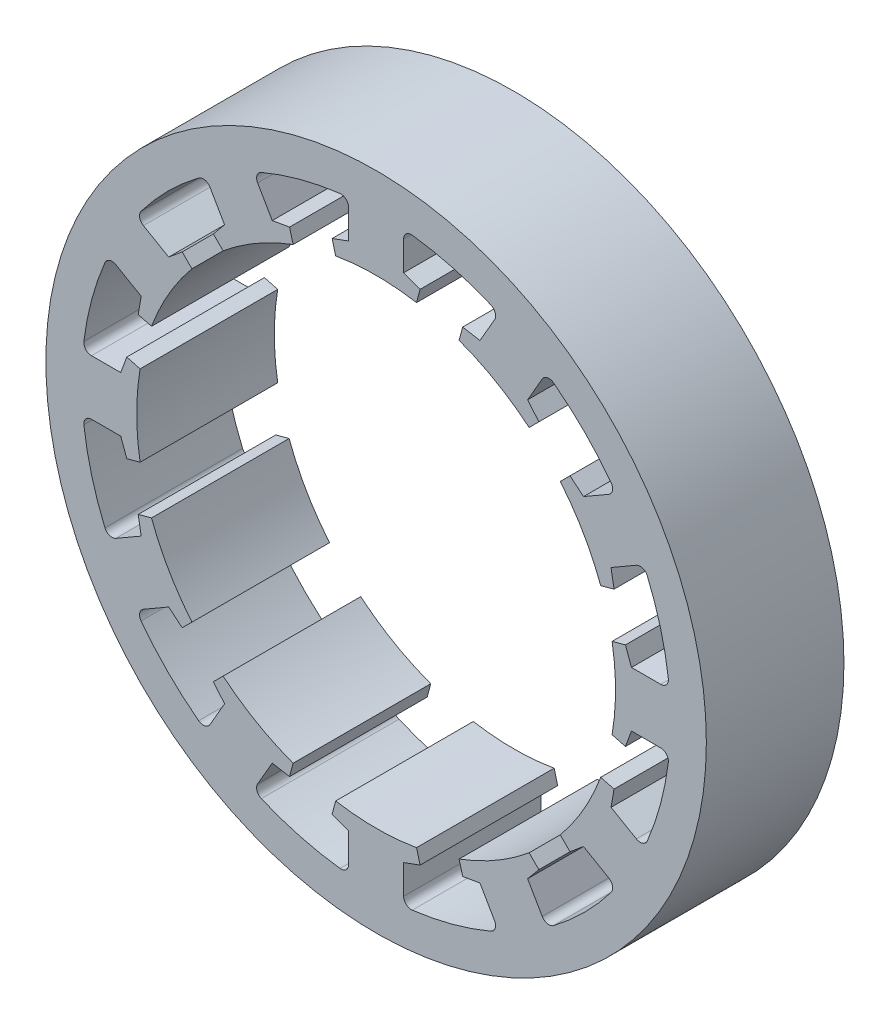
ISO-10303-21;
HEADER;
FILE_DESCRIPTION(('STEP AP214'),'2;1');
FILE_NAME('part.step','',(''),(''),'','','');
FILE_SCHEMA(('AUTOMOTIVE_DESIGN { 1 0 10303 214 1 1 1 1 }'));
ENDSEC;
DATA;
#1=APPLICATION_CONTEXT('core data for automotive mechanical design processes');
#2=APPLICATION_PROTOCOL_DEFINITION('international standard','automotive_design',2000,#1);
#3=PRODUCT_CONTEXT('',#1,'mechanical');
#4=PRODUCT('Part','Part','',(#3));
#5=PRODUCT_RELATED_PRODUCT_CATEGORY('part','',(#4));
#6=PRODUCT_DEFINITION_FORMATION('','',#4);
#7=PRODUCT_DEFINITION_CONTEXT('part definition',#1,'design');
#8=PRODUCT_DEFINITION('design','',#6,#7);
#9=PRODUCT_DEFINITION_SHAPE('','',#8);
#10=(LENGTH_UNIT() NAMED_UNIT(*) SI_UNIT(.MILLI.,.METRE.));
#11=(NAMED_UNIT(*) PLANE_ANGLE_UNIT() SI_UNIT($,.RADIAN.));
#12=(NAMED_UNIT(*) SI_UNIT($,.STERADIAN.) SOLID_ANGLE_UNIT());
#13=UNCERTAINTY_MEASURE_WITH_UNIT(LENGTH_MEASURE(1.E-05),#10,'distance_accuracy_value','');
#14=(GEOMETRIC_REPRESENTATION_CONTEXT(3) GLOBAL_UNCERTAINTY_ASSIGNED_CONTEXT((#13)) GLOBAL_UNIT_ASSIGNED_CONTEXT((#10,
#11,#12)) REPRESENTATION_CONTEXT('',''));
#15=CARTESIAN_POINT('',(0.,0.,0.));
#16=DIRECTION('',(0.,0.,1.));
#17=DIRECTION('',(1.,0.,0.));
#18=AXIS2_PLACEMENT_3D('',#15,#16,#17);
#19=CARTESIAN_POINT('',(0.,0.,0.));
#20=DIRECTION('',(0.,0.,1.));
#21=DIRECTION('',(1.,0.,0.));
#22=AXIS2_PLACEMENT_3D('',#19,#20,#21);
#23=CYLINDRICAL_SURFACE('',#22,43.5);
#24=CARTESIAN_POINT('',(0.,0.,25.));
#25=DIRECTION('',(0.,0.,1.));
#26=DIRECTION('',(1.,0.,0.));
#27=AXIS2_PLACEMENT_3D('',#24,#25,#26);
#28=CIRCLE('',#27,43.5);
#29=CARTESIAN_POINT('',(-42.8752541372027,7.34592286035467,25.));
#30=VERTEX_POINT('',#29);
#31=CARTESIAN_POINT('',(-42.875254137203,-7.34592286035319,25.));
#32=VERTEX_POINT('',#31);
#33=EDGE_CURVE('E2154',#30,#32,#28,.T.);
#34=ORIENTED_EDGE('',*,*,#33,.T.);
#35=DIRECTION('',(0.,0.,1.));
#36=VECTOR('',#35,1.);
#37=CARTESIAN_POINT('',(-42.875254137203,-7.34592286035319,0.));
#38=LINE('',#37,#36);
#39=CARTESIAN_POINT('',(-42.875254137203,-7.34592286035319,0.));
#40=VERTEX_POINT('',#39);
#41=EDGE_CURVE('E1700',#32,#40,#38,.F.);
#42=ORIENTED_EDGE('',*,*,#41,.T.);
#43=CARTESIAN_POINT('',(0.,0.,0.));
#44=DIRECTION('',(0.,0.,1.));
#45=DIRECTION('',(1.,0.,0.));
#46=AXIS2_PLACEMENT_3D('',#43,#44,#45);
#47=CIRCLE('',#46,43.5);
#48=CARTESIAN_POINT('',(-42.8752541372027,7.34592286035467,0.));
#49=VERTEX_POINT('',#48);
#50=EDGE_CURVE('E2203',#49,#40,#47,.T.);
#51=ORIENTED_EDGE('',*,*,#50,.F.);
#52=DIRECTION('',(0.,0.,1.));
#53=VECTOR('',#52,1.);
#54=CARTESIAN_POINT('',(-42.8752541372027,7.34592286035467,0.));
#55=LINE('',#54,#53);
#56=EDGE_CURVE('E1634',#49,#30,#55,.T.);
#57=ORIENTED_EDGE('',*,*,#56,.T.);
#58=EDGE_LOOP('',(#34,#42,#51,#57));
#59=FACE_BOUND('',#58,.T.);
#60=ADVANCED_FACE('F44',(#59),#23,.F.);
#61=CARTESIAN_POINT('',(-40.8040207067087,-15.0758712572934,0.));
#62=VERTEX_POINT('',#61);
#63=CARTESIAN_POINT('',(-33.458097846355,-27.7993828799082,0.));
#64=VERTEX_POINT('',#63);
#65=EDGE_CURVE('E2199',#62,#64,#47,.T.);
#66=ORIENTED_EDGE('',*,*,#65,.F.);
#67=DIRECTION('',(0.,0.,1.));
#68=VECTOR('',#67,1.);
#69=CARTESIAN_POINT('',(-40.8040207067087,-15.0758712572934,0.));
#70=LINE('',#69,#68);
#71=CARTESIAN_POINT('',(-40.8040207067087,-15.0758712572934,25.));
#72=VERTEX_POINT('',#71);
#73=EDGE_CURVE('E1696',#62,#72,#70,.T.);
#74=ORIENTED_EDGE('',*,*,#73,.T.);
#75=CARTESIAN_POINT('',(-33.458097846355,-27.7993828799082,25.));
#76=VERTEX_POINT('',#75);
#77=EDGE_CURVE('E2150',#72,#76,#28,.T.);
#78=ORIENTED_EDGE('',*,*,#77,.T.);
#79=DIRECTION('',(0.,0.,1.));
#80=VECTOR('',#79,1.);
#81=CARTESIAN_POINT('',(-33.458097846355,-27.7993828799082,0.));
#82=LINE('',#81,#80);
#83=EDGE_CURVE('E1692',#76,#64,#82,.F.);
#84=ORIENTED_EDGE('',*,*,#83,.T.);
#85=EDGE_LOOP('',(#66,#74,#78,#84));
#86=FACE_BOUND('',#85,.T.);
#87=ADVANCED_FACE('F2474',(#86),#23,.F.);
#88=CARTESIAN_POINT('',(-27.7993828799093,-33.4580978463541,0.));
#89=VERTEX_POINT('',#88);
#90=CARTESIAN_POINT('',(-15.0758712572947,-40.8040207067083,0.));
#91=VERTEX_POINT('',#90);
#92=EDGE_CURVE('E2195',#89,#91,#47,.T.);
#93=ORIENTED_EDGE('',*,*,#92,.F.);
#94=DIRECTION('',(0.,0.,1.));
#95=VECTOR('',#94,1.);
#96=CARTESIAN_POINT('',(-27.7993828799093,-33.4580978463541,0.));
#97=LINE('',#96,#95);
#98=CARTESIAN_POINT('',(-27.7993828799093,-33.4580978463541,25.));
#99=VERTEX_POINT('',#98);
#100=EDGE_CURVE('E1688',#89,#99,#97,.T.);
#101=ORIENTED_EDGE('',*,*,#100,.T.);
#102=CARTESIAN_POINT('',(-15.0758712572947,-40.8040207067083,25.));
#103=VERTEX_POINT('',#102);
#104=EDGE_CURVE('E2155',#99,#103,#28,.T.);
#105=ORIENTED_EDGE('',*,*,#104,.T.);
#106=DIRECTION('',(0.,0.,1.));
#107=VECTOR('',#106,1.);
#108=CARTESIAN_POINT('',(-15.0758712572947,-40.8040207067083,0.));
#109=LINE('',#108,#107);
#110=EDGE_CURVE('E1684',#103,#91,#109,.F.);
#111=ORIENTED_EDGE('',*,*,#110,.T.);
#112=EDGE_LOOP('',(#93,#101,#105,#111));
#113=FACE_BOUND('',#112,.T.);
#114=ADVANCED_FACE('F2480',(#113),#23,.F.);
#115=CARTESIAN_POINT('',(-7.34592286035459,-42.8752541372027,0.));
#116=VERTEX_POINT('',#115);
#117=CARTESIAN_POINT('',(7.34592286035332,-42.8752541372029,0.));
#118=VERTEX_POINT('',#117);
#119=EDGE_CURVE('E2191',#116,#118,#47,.T.);
#120=ORIENTED_EDGE('',*,*,#119,.F.);
#121=DIRECTION('',(0.,0.,1.));
#122=VECTOR('',#121,1.);
#123=CARTESIAN_POINT('',(-7.34592286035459,-42.8752541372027,0.));
#124=LINE('',#123,#122);
#125=CARTESIAN_POINT('',(-7.34592286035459,-42.8752541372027,25.));
#126=VERTEX_POINT('',#125);
#127=EDGE_CURVE('E1680',#116,#126,#124,.T.);
#128=ORIENTED_EDGE('',*,*,#127,.T.);
#129=CARTESIAN_POINT('',(7.34592286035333,-42.875254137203,25.));
#130=VERTEX_POINT('',#129);
#131=EDGE_CURVE('E2161',#126,#130,#28,.T.);
#132=ORIENTED_EDGE('',*,*,#131,.T.);
#133=DIRECTION('',(0.,0.,1.));
#134=VECTOR('',#133,1.);
#135=CARTESIAN_POINT('',(7.34592286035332,-42.8752541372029,0.));
#136=LINE('',#135,#134);
#137=EDGE_CURVE('E1676',#130,#118,#136,.F.);
#138=ORIENTED_EDGE('',*,*,#137,.T.);
#139=EDGE_LOOP('',(#120,#128,#132,#138));
#140=FACE_BOUND('',#139,.T.);
#141=ADVANCED_FACE('F3950',(#140),#23,.F.);
#142=CARTESIAN_POINT('',(15.0758712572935,-40.8040207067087,0.));
#143=VERTEX_POINT('',#142);
#144=CARTESIAN_POINT('',(27.7993828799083,-33.4580978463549,0.));
#145=VERTEX_POINT('',#144);
#146=EDGE_CURVE('E2188',#143,#145,#47,.T.);
#147=ORIENTED_EDGE('',*,*,#146,.F.);
#148=DIRECTION('',(0.,0.,1.));
#149=VECTOR('',#148,1.);
#150=CARTESIAN_POINT('',(15.0758712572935,-40.8040207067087,0.));
#151=LINE('',#150,#149);
#152=CARTESIAN_POINT('',(15.0758712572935,-40.8040207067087,25.));
#153=VERTEX_POINT('',#152);
#154=EDGE_CURVE('E1672',#143,#153,#151,.T.);
#155=ORIENTED_EDGE('',*,*,#154,.T.);
#156=CARTESIAN_POINT('',(27.7993828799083,-33.4580978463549,25.));
#157=VERTEX_POINT('',#156);
#158=EDGE_CURVE('E2166',#153,#157,#28,.T.);
#159=ORIENTED_EDGE('',*,*,#158,.T.);
#160=DIRECTION('',(0.,0.,1.));
#161=VECTOR('',#160,1.);
#162=CARTESIAN_POINT('',(27.7993828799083,-33.4580978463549,0.));
#163=LINE('',#162,#161);
#164=EDGE_CURVE('E1668',#157,#145,#163,.F.);
#165=ORIENTED_EDGE('',*,*,#164,.T.);
#166=EDGE_LOOP('',(#147,#155,#159,#165));
#167=FACE_BOUND('',#166,.T.);
#168=ADVANCED_FACE('F2508',(#167),#23,.F.);
#169=CARTESIAN_POINT('',(33.4580978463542,-27.7993828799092,0.));
#170=VERTEX_POINT('',#169);
#171=CARTESIAN_POINT('',(40.8040207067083,-15.0758712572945,0.));
#172=VERTEX_POINT('',#171);
#173=EDGE_CURVE('E1595',#170,#172,#47,.T.);
#174=ORIENTED_EDGE('',*,*,#173,.F.);
#175=DIRECTION('',(0.,0.,1.));
#176=VECTOR('',#175,1.);
#177=CARTESIAN_POINT('',(33.4580978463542,-27.7993828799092,0.));
#178=LINE('',#177,#176);
#179=CARTESIAN_POINT('',(33.4580978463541,-27.7993828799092,25.));
#180=VERTEX_POINT('',#179);
#181=EDGE_CURVE('E1665',#170,#180,#178,.T.);
#182=ORIENTED_EDGE('',*,*,#181,.T.);
#183=CARTESIAN_POINT('',(40.8040207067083,-15.0758712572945,25.));
#184=VERTEX_POINT('',#183);
#185=EDGE_CURVE('E1601',#180,#184,#28,.T.);
#186=ORIENTED_EDGE('',*,*,#185,.T.);
#187=DIRECTION('',(0.,0.,1.));
#188=VECTOR('',#187,1.);
#189=CARTESIAN_POINT('',(40.8040207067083,-15.0758712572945,0.));
#190=LINE('',#189,#188);
#191=EDGE_CURVE('E1661',#184,#172,#190,.F.);
#192=ORIENTED_EDGE('',*,*,#191,.T.);
#193=EDGE_LOOP('',(#174,#182,#186,#192));
#194=FACE_BOUND('',#193,.T.);
#195=ADVANCED_FACE('F2178',(#194),#23,.F.);
#196=CARTESIAN_POINT('',(42.8752541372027,-7.34592286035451,0.));
#197=VERTEX_POINT('',#196);
#198=CARTESIAN_POINT('',(42.8752541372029,7.34592286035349,0.));
#199=VERTEX_POINT('',#198);
#200=EDGE_CURVE('E1591',#197,#199,#47,.T.);
#201=ORIENTED_EDGE('',*,*,#200,.F.);
#202=DIRECTION('',(0.,0.,1.));
#203=VECTOR('',#202,1.);
#204=CARTESIAN_POINT('',(42.8752541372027,-7.34592286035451,0.));
#205=LINE('',#204,#203);
#206=CARTESIAN_POINT('',(42.8752541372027,-7.34592286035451,25.));
#207=VERTEX_POINT('',#206);
#208=EDGE_CURVE('E1658',#197,#207,#205,.T.);
#209=ORIENTED_EDGE('',*,*,#208,.T.);
#210=CARTESIAN_POINT('',(42.8752541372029,7.34592286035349,25.));
#211=VERTEX_POINT('',#210);
#212=EDGE_CURVE('E1590',#207,#211,#28,.T.);
#213=ORIENTED_EDGE('',*,*,#212,.T.);
#214=DIRECTION('',(0.,0.,1.));
#215=VECTOR('',#214,1.);
#216=CARTESIAN_POINT('',(42.8752541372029,7.34592286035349,0.));
#217=LINE('',#216,#215);
#218=EDGE_CURVE('E1654',#211,#199,#217,.F.);
#219=ORIENTED_EDGE('',*,*,#218,.T.);
#220=EDGE_LOOP('',(#201,#209,#213,#219));
#221=FACE_BOUND('',#220,.T.);
#222=ADVANCED_FACE('F2500',(#221),#23,.F.);
#223=CARTESIAN_POINT('',(27.7993828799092,33.4580978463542,25.));
#224=VERTEX_POINT('',#223);
#225=CARTESIAN_POINT('',(15.0758712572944,40.8040207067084,25.));
#226=VERTEX_POINT('',#225);
#227=EDGE_CURVE('E2268',#224,#226,#28,.T.);
#228=ORIENTED_EDGE('',*,*,#227,.T.);
#229=DIRECTION('',(0.,0.,1.));
#230=VECTOR('',#229,1.);
#231=CARTESIAN_POINT('',(15.0758712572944,40.8040207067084,0.));
#232=LINE('',#231,#230);
#233=CARTESIAN_POINT('',(15.0758712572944,40.8040207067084,0.));
#234=VERTEX_POINT('',#233);
#235=EDGE_CURVE('E1646',#226,#234,#232,.F.);
#236=ORIENTED_EDGE('',*,*,#235,.T.);
#237=CARTESIAN_POINT('',(27.7993828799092,33.4580978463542,0.));
#238=VERTEX_POINT('',#237);
#239=EDGE_CURVE('E2217',#238,#234,#47,.T.);
#240=ORIENTED_EDGE('',*,*,#239,.F.);
#241=DIRECTION('',(0.,0.,1.));
#242=VECTOR('',#241,1.);
#243=CARTESIAN_POINT('',(27.7993828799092,33.4580978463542,0.));
#244=LINE('',#243,#242);
#245=EDGE_CURVE('E1606',#238,#224,#244,.T.);
#246=ORIENTED_EDGE('',*,*,#245,.T.);
#247=EDGE_LOOP('',(#228,#236,#240,#246));
#248=FACE_BOUND('',#247,.T.);
#249=ADVANCED_FACE('F2267',(#248),#23,.F.);
#250=CARTESIAN_POINT('',(-33.4580978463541,27.7993828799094,25.));
#251=VERTEX_POINT('',#250);
#252=CARTESIAN_POINT('',(-40.8040207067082,15.0758712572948,25.));
#253=VERTEX_POINT('',#252);
#254=EDGE_CURVE('E2159',#251,#253,#28,.T.);
#255=ORIENTED_EDGE('',*,*,#254,.T.);
#256=DIRECTION('',(0.,0.,1.));
#257=VECTOR('',#256,1.);
#258=CARTESIAN_POINT('',(-40.8040207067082,15.0758712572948,0.));
#259=LINE('',#258,#257);
#260=CARTESIAN_POINT('',(-40.8040207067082,15.0758712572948,0.));
#261=VERTEX_POINT('',#260);
#262=EDGE_CURVE('E1638',#253,#261,#259,.F.);
#263=ORIENTED_EDGE('',*,*,#262,.T.);
#264=CARTESIAN_POINT('',(-33.4580978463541,27.7993828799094,0.));
#265=VERTEX_POINT('',#264);
#266=EDGE_CURVE('E2206',#265,#261,#47,.T.);
#267=ORIENTED_EDGE('',*,*,#266,.F.);
#268=DIRECTION('',(0.,0.,1.));
#269=VECTOR('',#268,1.);
#270=CARTESIAN_POINT('',(-33.4580978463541,27.7993828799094,0.));
#271=LINE('',#270,#269);
#272=EDGE_CURVE('E1626',#265,#251,#271,.T.);
#273=ORIENTED_EDGE('',*,*,#272,.T.);
#274=EDGE_LOOP('',(#255,#263,#267,#273));
#275=FACE_BOUND('',#274,.T.);
#276=ADVANCED_FACE('F2389',(#275),#23,.F.);
#277=CARTESIAN_POINT('',(-15.0758712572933,40.8040207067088,25.));
#278=VERTEX_POINT('',#277);
#279=CARTESIAN_POINT('',(-27.7993828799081,33.4580978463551,25.));
#280=VERTEX_POINT('',#279);
#281=EDGE_CURVE('E2346',#278,#280,#28,.T.);
#282=ORIENTED_EDGE('',*,*,#281,.T.);
#283=DIRECTION('',(0.,0.,1.));
#284=VECTOR('',#283,1.);
#285=CARTESIAN_POINT('',(-27.7993828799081,33.4580978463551,0.));
#286=LINE('',#285,#284);
#287=CARTESIAN_POINT('',(-27.7993828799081,33.4580978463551,0.));
#288=VERTEX_POINT('',#287);
#289=EDGE_CURVE('E1630',#280,#288,#286,.F.);
#290=ORIENTED_EDGE('',*,*,#289,.T.);
#291=CARTESIAN_POINT('',(-15.0758712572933,40.8040207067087,0.));
#292=VERTEX_POINT('',#291);
#293=EDGE_CURVE('E2210',#292,#288,#47,.T.);
#294=ORIENTED_EDGE('',*,*,#293,.F.);
#295=DIRECTION('',(0.,0.,1.));
#296=VECTOR('',#295,1.);
#297=CARTESIAN_POINT('',(-15.0758712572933,40.8040207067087,0.));
#298=LINE('',#297,#296);
#299=EDGE_CURVE('E1618',#292,#278,#298,.T.);
#300=ORIENTED_EDGE('',*,*,#299,.T.);
#301=EDGE_LOOP('',(#282,#290,#294,#300));
#302=FACE_BOUND('',#301,.T.);
#303=ADVANCED_FACE('F2345',(#302),#23,.F.);
#304=CARTESIAN_POINT('',(7.34592286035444,42.8752541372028,0.));
#305=VERTEX_POINT('',#304);
#306=CARTESIAN_POINT('',(-7.34592286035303,42.875254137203,0.));
#307=VERTEX_POINT('',#306);
#308=EDGE_CURVE('E2213',#305,#307,#47,.T.);
#309=ORIENTED_EDGE('',*,*,#308,.F.);
#310=DIRECTION('',(0.,0.,1.));
#311=VECTOR('',#310,1.);
#312=CARTESIAN_POINT('',(7.34592286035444,42.8752541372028,0.));
#313=LINE('',#312,#311);
#314=CARTESIAN_POINT('',(7.34592286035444,42.8752541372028,25.));
#315=VERTEX_POINT('',#314);
#316=EDGE_CURVE('E1642',#305,#315,#313,.T.);
#317=ORIENTED_EDGE('',*,*,#316,.T.);
#318=CARTESIAN_POINT('',(-7.34592286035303,42.875254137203,25.));
#319=VERTEX_POINT('',#318);
#320=EDGE_CURVE('E2307',#315,#319,#28,.T.);
#321=ORIENTED_EDGE('',*,*,#320,.T.);
#322=DIRECTION('',(0.,0.,1.));
#323=VECTOR('',#322,1.);
#324=CARTESIAN_POINT('',(-7.34592286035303,42.875254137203,0.));
#325=LINE('',#324,#323);
#326=EDGE_CURVE('E1622',#319,#307,#325,.F.);
#327=ORIENTED_EDGE('',*,*,#326,.T.);
#328=EDGE_LOOP('',(#309,#317,#321,#327));
#329=FACE_BOUND('',#328,.T.);
#330=ADVANCED_FACE('F2305',(#329),#23,.F.);
#331=CARTESIAN_POINT('',(0.,0.,25.));
#332=DIRECTION('',(0.,0.,-1.));
#333=DIRECTION('',(-1.,0.,0.));
#334=AXIS2_PLACEMENT_3D('',#331,#332,#333);
#335=CYLINDRICAL_SURFACE('',#334,60.);
#336=CARTESIAN_POINT('',(0.,0.,25.));
#337=DIRECTION('',(0.,0.,1.));
#338=DIRECTION('',(1.,0.,0.));
#339=AXIS2_PLACEMENT_3D('',#336,#337,#338);
#340=CIRCLE('',#339,60.);
#341=CARTESIAN_POINT('',(60.,0.,25.));
#342=VERTEX_POINT('',#341);
#343=EDGE_CURVE('E1602',#342,#342,#340,.T.);
#344=ORIENTED_EDGE('',*,*,#343,.F.);
#345=EDGE_LOOP('',(#344));
#346=FACE_BOUND('',#345,.T.);
#347=CARTESIAN_POINT('',(0.,0.,0.));
#348=DIRECTION('',(0.,0.,1.));
#349=DIRECTION('',(1.,0.,0.));
#350=AXIS2_PLACEMENT_3D('',#347,#348,#349);
#351=CIRCLE('',#350,60.);
#352=CARTESIAN_POINT('',(60.,0.,0.));
#353=VERTEX_POINT('',#352);
#354=EDGE_CURVE('E1607',#353,#353,#351,.T.);
#355=ORIENTED_EDGE('',*,*,#354,.T.);
#356=EDGE_LOOP('',(#355));
#357=FACE_BOUND('',#356,.T.);
#358=ADVANCED_FACE('F46',(#346,#357),#335,.T.);
#359=CARTESIAN_POINT('',(0.,0.,25.));
#360=DIRECTION('',(0.,0.,1.));
#361=DIRECTION('',(1.,0.,0.));
#362=AXIS2_PLACEMENT_3D('',#359,#360,#361);
#363=PLANE('',#362);
#364=DIRECTION('',(-0.965925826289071,-0.258819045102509,0.));
#365=VECTOR('',#364,1.);
#366=CARTESIAN_POINT('',(-45.2960046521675,-7.99456100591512,25.));
#367=LINE('',#366,#365);
#368=CARTESIAN_POINT('',(-45.2960046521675,-7.99456100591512,25.));
#369=VERTEX_POINT('',#368);
#370=EDGE_CURVE('E1154',#32,#369,#367,.T.);
#371=ORIENTED_EDGE('',*,*,#370,.F.);
#372=ORIENTED_EDGE('',*,*,#33,.F.);
#373=DIRECTION('',(0.965925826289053,-0.258819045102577,0.));
#374=VECTOR('',#373,1.);
#375=CARTESIAN_POINT('',(-45.2960046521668,7.99456100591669,25.));
#376=LINE('',#375,#374);
#377=CARTESIAN_POINT('',(-45.2960046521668,7.99456100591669,25.));
#378=VERTEX_POINT('',#377);
#379=EDGE_CURVE('E2400',#378,#30,#376,.T.);
#380=ORIENTED_EDGE('',*,*,#379,.F.);
#381=DIRECTION('',(0.344642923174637,0.93873385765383,0.));
#382=VECTOR('',#381,1.);
#383=CARTESIAN_POINT('',(-46.395415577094,5.00000000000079,25.));
#384=LINE('',#383,#382);
#385=CARTESIAN_POINT('',(-46.395415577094,5.00000000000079,25.));
#386=VERTEX_POINT('',#385);
#387=EDGE_CURVE('E2404',#386,#378,#384,.T.);
#388=ORIENTED_EDGE('',*,*,#387,.F.);
#389=DIRECTION('',(1.,0.,0.));
#390=VECTOR('',#389,1.);
#391=CARTESIAN_POINT('',(-51.705415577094,5.00000000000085,25.));
#392=LINE('',#391,#390);
#393=CARTESIAN_POINT('',(-51.705415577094,5.0000000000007,25.));
#394=VERTEX_POINT('',#393);
#395=EDGE_CURVE('E2413',#394,#386,#392,.T.);
#396=ORIENTED_EDGE('',*,*,#395,.F.);
#397=CARTESIAN_POINT('',(-51.705415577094,6.40000000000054,25.));
#398=DIRECTION('',(0.,0.,1.));
#399=DIRECTION('',(1.,0.,0.));
#400=AXIS2_PLACEMENT_3D('',#397,#398,#399);
#401=CIRCLE('',#400,1.39999999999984);
#402=CARTESIAN_POINT('',(-53.0948125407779,6.57197696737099,25.));
#403=VERTEX_POINT('',#402);
#404=EDGE_CURVE('E801',#403,#394,#401,.T.);
#405=ORIENTED_EDGE('',*,*,#404,.F.);
#406=CARTESIAN_POINT('',(0.,0.,25.));
#407=DIRECTION('',(0.,0.,1.));
#408=DIRECTION('',(1.,0.,0.));
#409=AXIS2_PLACEMENT_3D('',#406,#407,#408);
#410=CIRCLE('',#409,53.5);
#411=CARTESIAN_POINT('',(-49.2674449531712,20.8559072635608,25.));
#412=VERTEX_POINT('',#411);
#413=EDGE_CURVE('E1145',#412,#403,#410,.T.);
#414=ORIENTED_EDGE('',*,*,#413,.F.);
#415=CARTESIAN_POINT('',(-47.9782034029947,20.3101452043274,25.));
#416=DIRECTION('',(0.,0.,1.));
#417=DIRECTION('',(1.,0.,0.));
#418=AXIS2_PLACEMENT_3D('',#415,#416,#417);
#419=CIRCLE('',#418,1.4);
#420=CARTESIAN_POINT('',(-47.2782034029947,21.5225807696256,25.));
#421=VERTEX_POINT('',#420);
#422=EDGE_CURVE('E1138',#421,#412,#419,.T.);
#423=ORIENTED_EDGE('',*,*,#422,.F.);
#424=DIRECTION('',(-0.866025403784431,0.500000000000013,0.));
#425=VECTOR('',#424,1.);
#426=CARTESIAN_POINT('',(-47.2782034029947,21.5225807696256,25.));
#427=LINE('',#426,#425);
#428=CARTESIAN_POINT('',(-42.6796085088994,18.8675807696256,25.));
#429=VERTEX_POINT('',#428);
#430=EDGE_CURVE('E2406',#429,#421,#427,.T.);
#431=ORIENTED_EDGE('',*,*,#430,.F.);
#432=DIRECTION('',(0.170897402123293,0.985288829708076,0.));
#433=VECTOR('',#432,1.);
#434=CARTESIAN_POINT('',(-42.6796085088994,18.8675807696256,25.));
#435=LINE('',#434,#433);
#436=CARTESIAN_POINT('',(-43.2247712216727,15.7245094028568,25.));
#437=VERTEX_POINT('',#436);
#438=EDGE_CURVE('E2398',#437,#429,#435,.T.);
#439=ORIENTED_EDGE('',*,*,#438,.F.);
#440=DIRECTION('',(-0.965925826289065,0.258819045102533,0.));
#441=VECTOR('',#440,1.);
#442=CARTESIAN_POINT('',(-43.2247712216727,15.7245094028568,25.));
#443=LINE('',#442,#441);
#444=EDGE_CURVE('E2394',#253,#437,#443,.T.);
#445=ORIENTED_EDGE('',*,*,#444,.F.);
#446=ORIENTED_EDGE('',*,*,#254,.F.);
#447=DIRECTION('',(0.707106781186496,-0.707106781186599,0.));
#448=VECTOR('',#447,1.);
#449=CARTESIAN_POINT('',(-35.2302102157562,29.5714952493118,25.));
#450=LINE('',#449,#448);
#451=CARTESIAN_POINT('',(-35.2302102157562,29.5714952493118,25.));
#452=VERTEX_POINT('',#451);
#453=EDGE_CURVE('E1843',#452,#251,#450,.T.);
#454=ORIENTED_EDGE('',*,*,#453,.F.);
#455=DIRECTION('',(0.767836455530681,0.640645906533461,0.));
#456=VECTOR('',#455,1.);
#457=CARTESIAN_POINT('',(-37.6796085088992,27.5278348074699,25.));
#458=LINE('',#457,#456);
#459=CARTESIAN_POINT('',(-37.6796085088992,27.5278348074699,25.));
#460=VERTEX_POINT('',#459);
#461=EDGE_CURVE('E1846',#460,#452,#458,.T.);
#462=ORIENTED_EDGE('',*,*,#461,.F.);
#463=DIRECTION('',(0.866025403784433,-0.50000000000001,0.));
#464=VECTOR('',#463,1.);
#465=CARTESIAN_POINT('',(-42.2782034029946,30.18283480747,25.));
#466=LINE('',#465,#464);
#467=CARTESIAN_POINT('',(-42.2782034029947,30.1828348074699,25.));
#468=VERTEX_POINT('',#467);
#469=EDGE_CURVE('E1850',#468,#460,#466,.T.);
#470=ORIENTED_EDGE('',*,*,#469,.F.);
#471=CARTESIAN_POINT('',(-41.5782034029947,31.3952703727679,25.));
#472=DIRECTION('',(0.,0.,1.));
#473=DIRECTION('',(1.,0.,0.));
#474=AXIS2_PLACEMENT_3D('',#471,#472,#473);
#475=CIRCLE('',#474,1.39999999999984);
#476=CARTESIAN_POINT('',(-42.6954679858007,32.2389052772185,25.));
#477=VERTEX_POINT('',#476);
#478=EDGE_CURVE('E1854',#477,#468,#475,.T.);
#479=ORIENTED_EDGE('',*,*,#478,.F.);
#480=CARTESIAN_POINT('',(0.,0.,25.));
#481=DIRECTION('',(0.,0.,1.));
#482=DIRECTION('',(1.,0.,0.));
#483=AXIS2_PLACEMENT_3D('',#480,#481,#482);
#484=CIRCLE('',#483,53.5);
#485=CARTESIAN_POINT('',(-32.2389052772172,42.6954679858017,25.));
#486=VERTEX_POINT('',#485);
#487=EDGE_CURVE('E1857',#486,#477,#484,.T.);
#488=ORIENTED_EDGE('',*,*,#487,.F.);
#489=CARTESIAN_POINT('',(-31.3952703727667,41.5782034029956,25.));
#490=DIRECTION('',(0.,0.,1.));
#491=DIRECTION('',(1.,0.,0.));
#492=AXIS2_PLACEMENT_3D('',#489,#490,#491);
#493=CIRCLE('',#492,1.4);
#494=CARTESIAN_POINT('',(-30.1828348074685,42.2782034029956,25.));
#495=VERTEX_POINT('',#494);
#496=EDGE_CURVE('E1861',#495,#486,#493,.T.);
#497=ORIENTED_EDGE('',*,*,#496,.F.);
#498=DIRECTION('',(-0.499999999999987,0.866025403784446,0.));
#499=VECTOR('',#498,1.);
#500=CARTESIAN_POINT('',(-30.1828348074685,42.2782034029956,25.));
#501=LINE('',#500,#499);
#502=CARTESIAN_POINT('',(-27.5278348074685,37.6796085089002,25.));
#503=VERTEX_POINT('',#502);
#504=EDGE_CURVE('E1834',#503,#495,#501,.T.);
#505=ORIENTED_EDGE('',*,*,#504,.F.);
#506=DIRECTION('',(0.640645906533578,0.767836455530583,0.));
#507=VECTOR('',#506,1.);
#508=CARTESIAN_POINT('',(-27.5278348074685,37.6796085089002,25.));
#509=LINE('',#508,#507);
#510=CARTESIAN_POINT('',(-29.5714952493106,35.2302102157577,25.));
#511=VERTEX_POINT('',#510);
#512=EDGE_CURVE('E1837',#511,#503,#509,.T.);
#513=ORIENTED_EDGE('',*,*,#512,.F.);
#514=DIRECTION('',(-0.707106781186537,0.707106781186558,0.));
#515=VECTOR('',#514,1.);
#516=CARTESIAN_POINT('',(-29.5714952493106,35.2302102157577,25.));
#517=LINE('',#516,#515);
#518=EDGE_CURVE('E1821',#280,#511,#517,.T.);
#519=ORIENTED_EDGE('',*,*,#518,.F.);
#520=ORIENTED_EDGE('',*,*,#281,.F.);
#521=DIRECTION('',(0.258819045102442,-0.965925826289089,0.));
#522=VECTOR('',#521,1.);
#523=CARTESIAN_POINT('',(-15.724509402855,43.224771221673,25.));
#524=LINE('',#523,#522);
#525=CARTESIAN_POINT('',(-15.724509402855,43.224771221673,25.));
#526=VERTEX_POINT('',#525);
#527=EDGE_CURVE('E1907',#526,#278,#524,.T.);
#528=ORIENTED_EDGE('',*,*,#527,.F.);
#529=DIRECTION('',(0.985288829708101,0.170897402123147,0.));
#530=VECTOR('',#529,1.);
#531=CARTESIAN_POINT('',(-18.867580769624,42.6796085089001,25.));
#532=LINE('',#531,#530);
#533=CARTESIAN_POINT('',(-18.867580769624,42.6796085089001,25.));
#534=VERTEX_POINT('',#533);
#535=EDGE_CURVE('E1910',#534,#526,#532,.T.);
#536=ORIENTED_EDGE('',*,*,#535,.F.);
#537=DIRECTION('',(0.499999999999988,-0.866025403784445,0.));
#538=VECTOR('',#537,1.);
#539=CARTESIAN_POINT('',(-21.522580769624,47.2782034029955,25.));
#540=LINE('',#539,#538);
#541=CARTESIAN_POINT('',(-21.5225807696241,47.2782034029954,25.));
#542=VERTEX_POINT('',#541);
#543=EDGE_CURVE('E1914',#542,#534,#540,.T.);
#544=ORIENTED_EDGE('',*,*,#543,.F.);
#545=CARTESIAN_POINT('',(-20.310145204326,47.9782034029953,25.));
#546=DIRECTION('',(0.,0.,1.));
#547=DIRECTION('',(1.,0.,0.));
#548=AXIS2_PLACEMENT_3D('',#545,#546,#547);
#549=CIRCLE('',#548,1.39999999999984);
#550=CARTESIAN_POINT('',(-20.8559072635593,49.2674449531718,25.));
#551=VERTEX_POINT('',#550);
#552=EDGE_CURVE('E1918',#551,#542,#549,.T.);
#553=ORIENTED_EDGE('',*,*,#552,.F.);
#554=CARTESIAN_POINT('',(0.,0.,25.));
#555=DIRECTION('',(0.,0.,1.));
#556=DIRECTION('',(1.,0.,0.));
#557=AXIS2_PLACEMENT_3D('',#554,#555,#556);
#558=CIRCLE('',#557,53.5);
#559=CARTESIAN_POINT('',(-6.57197696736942,53.0948125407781,25.));
#560=VERTEX_POINT('',#559);
#561=EDGE_CURVE('E1921',#560,#551,#558,.T.);
#562=ORIENTED_EDGE('',*,*,#561,.F.);
#563=CARTESIAN_POINT('',(-6.39999999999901,51.7054155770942,25.));
#564=DIRECTION('',(0.,0.,1.));
#565=DIRECTION('',(1.,0.,0.));
#566=AXIS2_PLACEMENT_3D('',#563,#564,#565);
#567=CIRCLE('',#566,1.39999999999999);
#568=CARTESIAN_POINT('',(-4.99999999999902,51.7054155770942,25.));
#569=VERTEX_POINT('',#568);
#570=EDGE_CURVE('E1830',#569,#560,#567,.T.);
#571=ORIENTED_EDGE('',*,*,#570,.F.);
#572=DIRECTION('',(0.,1.,0.));
#573=VECTOR('',#572,1.);
#574=CARTESIAN_POINT('',(-4.99999999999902,51.7054155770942,25.));
#575=LINE('',#574,#573);
#576=CARTESIAN_POINT('',(-4.99999999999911,46.3954155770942,25.));
#577=VERTEX_POINT('',#576);
#578=EDGE_CURVE('E1879',#577,#569,#575,.T.);
#579=ORIENTED_EDGE('',*,*,#578,.F.);
#580=DIRECTION('',(0.938733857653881,0.344642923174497,0.));
#581=VECTOR('',#580,1.);
#582=CARTESIAN_POINT('',(-4.99999999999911,46.3954155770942,25.));
#583=LINE('',#582,#581);
#584=CARTESIAN_POINT('',(-7.99456100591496,45.2960046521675,25.));
#585=VERTEX_POINT('',#584);
#586=EDGE_CURVE('E1899',#585,#577,#583,.T.);
#587=ORIENTED_EDGE('',*,*,#586,.F.);
#588=DIRECTION('',(-0.258819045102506,0.965925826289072,0.));
#589=VECTOR('',#588,1.);
#590=CARTESIAN_POINT('',(-7.99456100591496,45.2960046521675,25.));
#591=LINE('',#590,#589);
#592=EDGE_CURVE('E1903',#319,#585,#591,.T.);
#593=ORIENTED_EDGE('',*,*,#592,.F.);
#594=ORIENTED_EDGE('',*,*,#320,.F.);
#595=DIRECTION('',(-0.258819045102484,-0.965925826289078,0.));
#596=VECTOR('',#595,1.);
#597=CARTESIAN_POINT('',(7.99456100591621,45.2960046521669,25.));
#598=LINE('',#597,#596);
#599=CARTESIAN_POINT('',(7.99456100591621,45.2960046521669,25.));
#600=VERTEX_POINT('',#599);
#601=EDGE_CURVE('E1227',#600,#315,#598,.T.);
#602=ORIENTED_EDGE('',*,*,#601,.F.);
#603=DIRECTION('',(0.938733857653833,-0.344642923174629,0.));
#604=VECTOR('',#603,1.);
#605=CARTESIAN_POINT('',(5.00000000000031,46.3954155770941,25.));
#606=LINE('',#605,#604);
#607=CARTESIAN_POINT('',(5.00000000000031,46.3954155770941,25.));
#608=VERTEX_POINT('',#607);
#609=EDGE_CURVE('E1230',#608,#600,#606,.T.);
#610=ORIENTED_EDGE('',*,*,#609,.F.);
#611=DIRECTION('',(0.,-1.,0.));
#612=VECTOR('',#611,1.);
#613=CARTESIAN_POINT('',(5.00000000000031,51.7054155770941,25.));
#614=LINE('',#613,#612);
#615=CARTESIAN_POINT('',(5.00000000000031,51.7054155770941,25.));
#616=VERTEX_POINT('',#615);
#617=EDGE_CURVE('E1234',#616,#608,#614,.T.);
#618=ORIENTED_EDGE('',*,*,#617,.F.);
#619=CARTESIAN_POINT('',(6.4,51.7054155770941,25.));
#620=DIRECTION('',(0.,0.,1.));
#621=DIRECTION('',(1.,0.,0.));
#622=AXIS2_PLACEMENT_3D('',#619,#620,#621);
#623=CIRCLE('',#622,1.39999999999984);
#624=CARTESIAN_POINT('',(6.57197696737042,53.0948125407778,25.));
#625=VERTEX_POINT('',#624);
#626=EDGE_CURVE('E1238',#625,#616,#623,.T.);
#627=ORIENTED_EDGE('',*,*,#626,.F.);
#628=CARTESIAN_POINT('',(0.,0.,25.));
#629=DIRECTION('',(0.,0.,1.));
#630=DIRECTION('',(1.,0.,0.));
#631=AXIS2_PLACEMENT_3D('',#628,#629,#630);
#632=CIRCLE('',#631,53.5);
#633=CARTESIAN_POINT('',(20.8559072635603,49.2674449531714,25.));
#634=VERTEX_POINT('',#633);
#635=EDGE_CURVE('E1241',#634,#625,#632,.T.);
#636=ORIENTED_EDGE('',*,*,#635,.F.);
#637=CARTESIAN_POINT('',(20.3101452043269,47.9782034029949,25.));
#638=DIRECTION('',(0.,0.,1.));
#639=DIRECTION('',(1.,0.,0.));
#640=AXIS2_PLACEMENT_3D('',#637,#638,#639);
#641=CIRCLE('',#640,1.4);
#642=CARTESIAN_POINT('',(21.5225807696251,47.2782034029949,25.));
#643=VERTEX_POINT('',#642);
#644=EDGE_CURVE('E1194',#643,#634,#641,.T.);
#645=ORIENTED_EDGE('',*,*,#644,.F.);
#646=DIRECTION('',(0.500000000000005,0.866025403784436,0.));
#647=VECTOR('',#646,1.);
#648=CARTESIAN_POINT('',(21.5225807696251,47.2782034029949,25.));
#649=LINE('',#648,#647);
#650=CARTESIAN_POINT('',(18.8675807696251,42.6796085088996,25.));
#651=VERTEX_POINT('',#650);
#652=EDGE_CURVE('E1216',#651,#643,#649,.T.);
#653=ORIENTED_EDGE('',*,*,#652,.F.);
#654=DIRECTION('',(0.985288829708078,-0.170897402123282,0.));
#655=VECTOR('',#654,1.);
#656=CARTESIAN_POINT('',(18.8675807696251,42.6796085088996,25.));
#657=LINE('',#656,#655);
#658=CARTESIAN_POINT('',(15.7245094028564,43.2247712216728,25.));
#659=VERTEX_POINT('',#658);
#660=EDGE_CURVE('E1219',#659,#651,#657,.T.);
#661=ORIENTED_EDGE('',*,*,#660,.F.);
#662=DIRECTION('',(0.258819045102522,0.965925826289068,0.));
#663=VECTOR('',#662,1.);
#664=CARTESIAN_POINT('',(15.7245094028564,43.2247712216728,25.));
#665=LINE('',#664,#663);
#666=EDGE_CURVE('E1223',#226,#659,#665,.T.);
#667=ORIENTED_EDGE('',*,*,#666,.F.);
#668=ORIENTED_EDGE('',*,*,#227,.F.);
#669=DIRECTION('',(-0.70710678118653,-0.707106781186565,0.));
#670=VECTOR('',#669,1.);
#671=CARTESIAN_POINT('',(29.5714952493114,35.2302102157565,25.));
#672=LINE('',#671,#670);
#673=CARTESIAN_POINT('',(29.5714952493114,35.2302102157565,25.));
#674=VERTEX_POINT('',#673);
#675=EDGE_CURVE('E1451',#674,#224,#672,.T.);
#676=ORIENTED_EDGE('',*,*,#675,.F.);
#677=DIRECTION('',(0.640645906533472,-0.767836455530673,0.));
#678=VECTOR('',#677,1.);
#679=CARTESIAN_POINT('',(27.5278348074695,37.6796085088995,25.));
#680=LINE('',#679,#678);
#681=CARTESIAN_POINT('',(27.5278348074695,37.6796085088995,25.));
#682=VERTEX_POINT('',#681);
#683=EDGE_CURVE('E1447',#682,#674,#680,.T.);
#684=ORIENTED_EDGE('',*,*,#683,.F.);
#685=DIRECTION('',(-0.500000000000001,-0.866025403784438,0.));
#686=VECTOR('',#685,1.);
#687=CARTESIAN_POINT('',(30.1828348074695,42.2782034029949,25.));
#688=LINE('',#687,#686);
#689=CARTESIAN_POINT('',(30.1828348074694,42.278203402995,25.));
#690=VERTEX_POINT('',#689);
#691=EDGE_CURVE('E1443',#690,#682,#688,.T.);
#692=ORIENTED_EDGE('',*,*,#691,.F.);
#693=CARTESIAN_POINT('',(31.3952703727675,41.578203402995,25.));
#694=DIRECTION('',(0.,0.,1.));
#695=DIRECTION('',(1.,0.,0.));
#696=AXIS2_PLACEMENT_3D('',#693,#694,#695);
#697=CIRCLE('',#696,1.39999999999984);
#698=CARTESIAN_POINT('',(32.238905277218,42.695467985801,25.));
#699=VERTEX_POINT('',#698);
#700=EDGE_CURVE('E1440',#699,#690,#697,.T.);
#701=ORIENTED_EDGE('',*,*,#700,.F.);
#702=CARTESIAN_POINT('',(0.,0.,25.));
#703=DIRECTION('',(0.,0.,1.));
#704=DIRECTION('',(1.,0.,0.));
#705=AXIS2_PLACEMENT_3D('',#702,#703,#704);
#706=CIRCLE('',#705,53.5);
#707=CARTESIAN_POINT('',(42.6954679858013,32.2389052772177,25.));
#708=VERTEX_POINT('',#707);
#709=EDGE_CURVE('E1436',#708,#699,#706,.T.);
#710=ORIENTED_EDGE('',*,*,#709,.F.);
#711=CARTESIAN_POINT('',(41.5782034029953,31.3952703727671,25.));
#712=DIRECTION('',(0.,0.,1.));
#713=DIRECTION('',(1.,0.,0.));
#714=AXIS2_PLACEMENT_3D('',#711,#712,#713);
#715=CIRCLE('',#714,1.39999999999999);
#716=CARTESIAN_POINT('',(42.2782034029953,30.1828348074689,25.));
#717=VERTEX_POINT('',#716);
#718=EDGE_CURVE('E1245',#717,#708,#715,.T.);
#719=ORIENTED_EDGE('',*,*,#718,.F.);
#720=DIRECTION('',(0.866025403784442,0.499999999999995,0.));
#721=VECTOR('',#720,1.);
#722=CARTESIAN_POINT('',(42.2782034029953,30.1828348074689,25.));
#723=LINE('',#722,#721);
#724=CARTESIAN_POINT('',(37.6796085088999,27.5278348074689,25.));
#725=VERTEX_POINT('',#724);
#726=EDGE_CURVE('E1462',#725,#717,#723,.T.);
#727=ORIENTED_EDGE('',*,*,#726,.F.);
#728=DIRECTION('',(0.767836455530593,-0.640645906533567,0.));
#729=VECTOR('',#728,1.);
#730=CARTESIAN_POINT('',(37.6796085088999,27.5278348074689,25.));
#731=LINE('',#730,#729);
#732=CARTESIAN_POINT('',(35.2302102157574,29.571495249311,25.));
#733=VERTEX_POINT('',#732);
#734=EDGE_CURVE('E1458',#733,#725,#731,.T.);
#735=ORIENTED_EDGE('',*,*,#734,.F.);
#736=DIRECTION('',(0.70710678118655,0.707106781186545,0.));
#737=VECTOR('',#736,1.);
#738=CARTESIAN_POINT('',(35.2302102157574,29.571495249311,25.));
#739=LINE('',#738,#737);
#740=CARTESIAN_POINT('',(33.4580978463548,27.7993828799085,25.));
#741=VERTEX_POINT('',#740);
#742=EDGE_CURVE('E1454',#741,#733,#739,.T.);
#743=ORIENTED_EDGE('',*,*,#742,.F.);
#744=CARTESIAN_POINT('',(40.8040207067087,15.0758712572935,25.));
#745=VERTEX_POINT('',#744);
#746=EDGE_CURVE('E1596',#745,#741,#28,.T.);
#747=ORIENTED_EDGE('',*,*,#746,.F.);
#748=DIRECTION('',(-0.965925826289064,-0.258819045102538,0.));
#749=VECTOR('',#748,1.);
#750=CARTESIAN_POINT('',(43.2247712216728,15.7245094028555,25.));
#751=LINE('',#750,#749);
#752=CARTESIAN_POINT('',(43.2247712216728,15.7245094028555,25.));
#753=VERTEX_POINT('',#752);
#754=EDGE_CURVE('E1288',#753,#745,#751,.T.);
#755=ORIENTED_EDGE('',*,*,#754,.F.);
#756=DIRECTION('',(0.170897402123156,-0.9852888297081,0.));
#757=VECTOR('',#756,1.);
#758=CARTESIAN_POINT('',(42.6796085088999,18.8675807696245,25.));
#759=LINE('',#758,#757);
#760=CARTESIAN_POINT('',(42.6796085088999,18.8675807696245,25.));
#761=VERTEX_POINT('',#760);
#762=EDGE_CURVE('E1291',#761,#753,#759,.T.);
#763=ORIENTED_EDGE('',*,*,#762,.F.);
#764=DIRECTION('',(-0.86602540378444,-0.499999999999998,0.));
#765=VECTOR('',#764,1.);
#766=CARTESIAN_POINT('',(47.2782034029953,21.5225807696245,25.));
#767=LINE('',#766,#765);
#768=CARTESIAN_POINT('',(47.2782034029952,21.5225807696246,25.));
#769=VERTEX_POINT('',#768);
#770=EDGE_CURVE('E1295',#769,#761,#767,.T.);
#771=ORIENTED_EDGE('',*,*,#770,.F.);
#772=CARTESIAN_POINT('',(47.9782034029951,20.3101452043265,25.));
#773=DIRECTION('',(0.,0.,1.));
#774=DIRECTION('',(1.,0.,0.));
#775=AXIS2_PLACEMENT_3D('',#772,#773,#774);
#776=CIRCLE('',#775,1.39999999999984);
#777=CARTESIAN_POINT('',(49.2674449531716,20.8559072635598,25.));
#778=VERTEX_POINT('',#777);
#779=EDGE_CURVE('E1299',#778,#769,#776,.T.);
#780=ORIENTED_EDGE('',*,*,#779,.F.);
#781=CARTESIAN_POINT('',(0.,0.,25.));
#782=DIRECTION('',(0.,0.,1.));
#783=DIRECTION('',(1.,0.,0.));
#784=AXIS2_PLACEMENT_3D('',#781,#782,#783);
#785=CIRCLE('',#784,53.5);
#786=CARTESIAN_POINT('',(53.094812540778,6.57197696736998,25.));
#787=VERTEX_POINT('',#786);
#788=EDGE_CURVE('E1302',#787,#778,#785,.T.);
#789=ORIENTED_EDGE('',*,*,#788,.F.);
#790=CARTESIAN_POINT('',(51.7054155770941,6.39999999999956,25.));
#791=DIRECTION('',(0.,0.,1.));
#792=DIRECTION('',(1.,0.,0.));
#793=AXIS2_PLACEMENT_3D('',#790,#791,#792);
#794=CIRCLE('',#793,1.39999999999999);
#795=CARTESIAN_POINT('',(51.7054155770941,4.99999999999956,25.));
#796=VERTEX_POINT('',#795);
#797=EDGE_CURVE('E1212',#796,#787,#794,.T.);
#798=ORIENTED_EDGE('',*,*,#797,.F.);
#799=DIRECTION('',(1.,0.,0.));
#800=VECTOR('',#799,1.);
#801=CARTESIAN_POINT('',(51.7054155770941,4.99999999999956,25.));
#802=LINE('',#801,#800);
#803=CARTESIAN_POINT('',(46.3954155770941,4.99999999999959,25.));
#804=VERTEX_POINT('',#803);
#805=EDGE_CURVE('E1259',#804,#796,#802,.T.);
#806=ORIENTED_EDGE('',*,*,#805,.F.);
#807=DIRECTION('',(0.344642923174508,-0.938733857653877,0.));
#808=VECTOR('',#807,1.);
#809=CARTESIAN_POINT('',(46.3954155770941,4.99999999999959,25.));
#810=LINE('',#809,#808);
#811=CARTESIAN_POINT('',(45.2960046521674,7.99456100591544,25.));
#812=VERTEX_POINT('',#811);
#813=EDGE_CURVE('E1280',#812,#804,#810,.T.);
#814=ORIENTED_EDGE('',*,*,#813,.F.);
#815=DIRECTION('',(0.96592582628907,0.258819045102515,0.));
#816=VECTOR('',#815,1.);
#817=CARTESIAN_POINT('',(45.2960046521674,7.99456100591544,25.));
#818=LINE('',#817,#816);
#819=EDGE_CURVE('E1284',#211,#812,#818,.T.);
#820=ORIENTED_EDGE('',*,*,#819,.F.);
#821=ORIENTED_EDGE('',*,*,#212,.F.);
#822=DIRECTION('',(-0.96592582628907,0.258819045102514,0.));
#823=VECTOR('',#822,1.);
#824=CARTESIAN_POINT('',(45.2960046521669,-7.99456100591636,25.));
#825=LINE('',#824,#823);
#826=CARTESIAN_POINT('',(45.2960046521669,-7.99456100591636,25.));
#827=VERTEX_POINT('',#826);
#828=EDGE_CURVE('E60',#827,#207,#825,.T.);
#829=ORIENTED_EDGE('',*,*,#828,.F.);
#830=DIRECTION('',(-0.344642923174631,-0.938733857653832,0.));
#831=VECTOR('',#830,1.);
#832=CARTESIAN_POINT('',(46.395415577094,-5.00000000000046,25.));
#833=LINE('',#832,#831);
#834=CARTESIAN_POINT('',(46.395415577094,-5.00000000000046,25.));
#835=VERTEX_POINT('',#834);
#836=EDGE_CURVE('E1353',#835,#827,#833,.T.);
#837=ORIENTED_EDGE('',*,*,#836,.F.);
#838=DIRECTION('',(-1.,0.,0.));
#839=VECTOR('',#838,1.);
#840=CARTESIAN_POINT('',(51.705415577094,-5.00000000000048,25.));
#841=LINE('',#840,#839);
#842=CARTESIAN_POINT('',(51.705415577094,-5.00000000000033,25.));
#843=VERTEX_POINT('',#842);
#844=EDGE_CURVE('E1357',#843,#835,#841,.T.);
#845=ORIENTED_EDGE('',*,*,#844,.F.);
#846=CARTESIAN_POINT('',(51.705415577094,-6.40000000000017,25.));
#847=DIRECTION('',(0.,0.,1.));
#848=DIRECTION('',(1.,0.,0.));
#849=AXIS2_PLACEMENT_3D('',#846,#847,#848);
#850=CIRCLE('',#849,1.39999999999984);
#851=CARTESIAN_POINT('',(53.0948125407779,-6.57197696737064,25.));
#852=VERTEX_POINT('',#851);
#853=EDGE_CURVE('E1361',#852,#843,#850,.T.);
#854=ORIENTED_EDGE('',*,*,#853,.F.);
#855=CARTESIAN_POINT('',(0.,0.,25.));
#856=DIRECTION('',(0.,0.,1.));
#857=DIRECTION('',(1.,0.,0.));
#858=AXIS2_PLACEMENT_3D('',#855,#856,#857);
#859=CIRCLE('',#858,53.5);
#860=CARTESIAN_POINT('',(49.2674449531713,-20.8559072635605,25.));
#861=VERTEX_POINT('',#860);
#862=EDGE_CURVE('E1364',#861,#852,#859,.T.);
#863=ORIENTED_EDGE('',*,*,#862,.F.);
#864=CARTESIAN_POINT('',(47.9782034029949,-20.3101452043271,25.));
#865=DIRECTION('',(0.,0.,1.));
#866=DIRECTION('',(1.,0.,0.));
#867=AXIS2_PLACEMENT_3D('',#864,#865,#866);
#868=CIRCLE('',#867,1.4);
#869=CARTESIAN_POINT('',(47.2782034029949,-21.5225807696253,25.));
#870=VERTEX_POINT('',#869);
#871=EDGE_CURVE('E1277',#870,#861,#868,.T.);
#872=ORIENTED_EDGE('',*,*,#871,.F.);
#873=DIRECTION('',(0.866025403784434,-0.500000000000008,0.));
#874=VECTOR('',#873,1.);
#875=CARTESIAN_POINT('',(47.2782034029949,-21.5225807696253,25.));
#876=LINE('',#875,#874);
#877=CARTESIAN_POINT('',(42.6796085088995,-18.8675807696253,25.));
#878=VERTEX_POINT('',#877);
#879=EDGE_CURVE('E1322',#878,#870,#876,.T.);
#880=ORIENTED_EDGE('',*,*,#879,.F.);
#881=DIRECTION('',(-0.170897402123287,-0.985288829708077,0.));
#882=VECTOR('',#881,1.);
#883=CARTESIAN_POINT('',(42.6796085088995,-18.8675807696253,25.));
#884=LINE('',#883,#882);
#885=CARTESIAN_POINT('',(43.2247712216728,-15.7245094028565,25.));
#886=VERTEX_POINT('',#885);
#887=EDGE_CURVE('E1343',#886,#878,#884,.T.);
#888=ORIENTED_EDGE('',*,*,#887,.F.);
#889=DIRECTION('',(0.965925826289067,-0.258819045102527,0.));
#890=VECTOR('',#889,1.);
#891=CARTESIAN_POINT('',(43.2247712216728,-15.7245094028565,25.));
#892=LINE('',#891,#890);
#893=EDGE_CURVE('E1347',#184,#886,#892,.T.);
#894=ORIENTED_EDGE('',*,*,#893,.F.);
#895=ORIENTED_EDGE('',*,*,#185,.F.);
#896=DIRECTION('',(-0.707106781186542,0.707106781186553,0.));
#897=VECTOR('',#896,1.);
#898=CARTESIAN_POINT('',(35.2302102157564,-29.5714952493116,25.));
#899=LINE('',#898,#897);
#900=CARTESIAN_POINT('',(35.2302102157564,-29.5714952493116,25.));
#901=VERTEX_POINT('',#900);
#902=EDGE_CURVE('E68',#901,#180,#899,.T.);
#903=ORIENTED_EDGE('',*,*,#902,.F.);
#904=DIRECTION('',(-0.767836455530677,-0.640645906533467,0.));
#905=VECTOR('',#904,1.);
#906=CARTESIAN_POINT('',(37.6796085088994,-27.5278348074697,25.));
#907=LINE('',#906,#905);
#908=CARTESIAN_POINT('',(37.6796085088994,-27.5278348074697,25.));
#909=VERTEX_POINT('',#908);
#910=EDGE_CURVE('E1415',#909,#901,#907,.T.);
#911=ORIENTED_EDGE('',*,*,#910,.F.);
#912=DIRECTION('',(-0.866025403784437,0.500000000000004,0.));
#913=VECTOR('',#912,1.);
#914=CARTESIAN_POINT('',(42.2782034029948,-30.1828348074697,25.));
#915=LINE('',#914,#913);
#916=CARTESIAN_POINT('',(42.2782034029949,-30.1828348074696,25.));
#917=VERTEX_POINT('',#916);
#918=EDGE_CURVE('E1419',#917,#909,#915,.T.);
#919=ORIENTED_EDGE('',*,*,#918,.F.);
#920=CARTESIAN_POINT('',(41.5782034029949,-31.3952703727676,25.));
#921=DIRECTION('',(0.,0.,1.));
#922=DIRECTION('',(1.,0.,0.));
#923=AXIS2_PLACEMENT_3D('',#920,#921,#922);
#924=CIRCLE('',#923,1.39999999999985);
#925=CARTESIAN_POINT('',(42.6954679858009,-32.2389052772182,25.));
#926=VERTEX_POINT('',#925);
#927=EDGE_CURVE('E1423',#926,#917,#924,.T.);
#928=ORIENTED_EDGE('',*,*,#927,.F.);
#929=CARTESIAN_POINT('',(0.,0.,25.));
#930=DIRECTION('',(0.,0.,1.));
#931=DIRECTION('',(1.,0.,0.));
#932=AXIS2_PLACEMENT_3D('',#929,#930,#931);
#933=CIRCLE('',#932,53.5);
#934=CARTESIAN_POINT('',(32.2389052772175,-42.6954679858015,25.));
#935=VERTEX_POINT('',#934);
#936=EDGE_CURVE('E1426',#935,#926,#933,.T.);
#937=ORIENTED_EDGE('',*,*,#936,.F.);
#938=CARTESIAN_POINT('',(31.395270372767,-41.5782034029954,25.));
#939=DIRECTION('',(0.,0.,1.));
#940=DIRECTION('',(1.,0.,0.));
#941=AXIS2_PLACEMENT_3D('',#938,#939,#940);
#942=CIRCLE('',#941,1.4);
#943=CARTESIAN_POINT('',(30.1828348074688,-42.2782034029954,25.));
#944=VERTEX_POINT('',#943);
#945=EDGE_CURVE('E1340',#944,#935,#942,.T.);
#946=ORIENTED_EDGE('',*,*,#945,.F.);
#947=DIRECTION('',(0.499999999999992,-0.866025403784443,0.));
#948=VECTOR('',#947,1.);
#949=CARTESIAN_POINT('',(30.1828348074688,-42.2782034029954,25.));
#950=LINE('',#949,#948);
#951=CARTESIAN_POINT('',(27.5278348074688,-37.6796085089,25.));
#952=VERTEX_POINT('',#951);
#953=EDGE_CURVE('E1384',#952,#944,#950,.T.);
#954=ORIENTED_EDGE('',*,*,#953,.F.);
#955=DIRECTION('',(-0.64064590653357,-0.76783645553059,0.));
#956=VECTOR('',#955,1.);
#957=CARTESIAN_POINT('',(27.5278348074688,-37.6796085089,25.));
#958=LINE('',#957,#956);
#959=CARTESIAN_POINT('',(29.5714952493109,-35.2302102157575,25.));
#960=VERTEX_POINT('',#959);
#961=EDGE_CURVE('E1405',#960,#952,#958,.T.);
#962=ORIENTED_EDGE('',*,*,#961,.F.);
#963=DIRECTION('',(0.707106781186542,-0.707106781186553,0.));
#964=VECTOR('',#963,1.);
#965=CARTESIAN_POINT('',(29.5714952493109,-35.2302102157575,25.));
#966=LINE('',#965,#964);
#967=EDGE_CURVE('E1409',#157,#960,#966,.T.);
#968=ORIENTED_EDGE('',*,*,#967,.F.);
#969=ORIENTED_EDGE('',*,*,#158,.F.);
#970=DIRECTION('',(-0.258819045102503,0.965925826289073,0.));
#971=VECTOR('',#970,1.);
#972=CARTESIAN_POINT('',(15.7245094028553,-43.2247712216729,25.));
#973=LINE('',#972,#971);
#974=CARTESIAN_POINT('',(15.7245094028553,-43.2247712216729,25.));
#975=VERTEX_POINT('',#974);
#976=EDGE_CURVE('E1970',#975,#153,#973,.T.);
#977=ORIENTED_EDGE('',*,*,#976,.F.);
#978=DIRECTION('',(-0.9852888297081,-0.170897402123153,0.));
#979=VECTOR('',#978,1.);
#980=CARTESIAN_POINT('',(18.8675807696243,-42.6796085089,25.));
#981=LINE('',#980,#979);
#982=CARTESIAN_POINT('',(18.8675807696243,-42.6796085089,25.));
#983=VERTEX_POINT('',#982);
#984=EDGE_CURVE('E1973',#983,#975,#981,.T.);
#985=ORIENTED_EDGE('',*,*,#984,.F.);
#986=DIRECTION('',(-0.499999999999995,0.866025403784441,0.));
#987=VECTOR('',#986,1.);
#988=CARTESIAN_POINT('',(21.5225807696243,-47.2782034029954,25.));
#989=LINE('',#988,#987);
#990=CARTESIAN_POINT('',(21.5225807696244,-47.2782034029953,25.));
#991=VERTEX_POINT('',#990);
#992=EDGE_CURVE('E1977',#991,#983,#989,.T.);
#993=ORIENTED_EDGE('',*,*,#992,.F.);
#994=CARTESIAN_POINT('',(20.3101452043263,-47.9782034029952,25.));
#995=DIRECTION('',(0.,0.,1.));
#996=DIRECTION('',(1.,0.,0.));
#997=AXIS2_PLACEMENT_3D('',#994,#995,#996);
#998=CIRCLE('',#997,1.39999999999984);
#999=CARTESIAN_POINT('',(20.8559072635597,-49.2674449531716,25.));
#1000=VERTEX_POINT('',#999);
#1001=EDGE_CURVE('E1981',#1000,#991,#998,.T.);
#1002=ORIENTED_EDGE('',*,*,#1001,.F.);
#1003=CARTESIAN_POINT('',(0.,0.,25.));
#1004=DIRECTION('',(0.,0.,1.));
#1005=DIRECTION('',(1.,0.,0.));
#1006=AXIS2_PLACEMENT_3D('',#1003,#1004,#1005);
#1007=CIRCLE('',#1006,53.5);
#1008=CARTESIAN_POINT('',(6.57197696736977,-53.094812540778,25.));
#1009=VERTEX_POINT('',#1008);
#1010=EDGE_CURVE('E1984',#1009,#1000,#1007,.T.);
#1011=ORIENTED_EDGE('',*,*,#1010,.F.);
#1012=CARTESIAN_POINT('',(6.39999999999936,-51.7054155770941,25.));
#1013=DIRECTION('',(0.,0.,1.));
#1014=DIRECTION('',(1.,0.,0.));
#1015=AXIS2_PLACEMENT_3D('',#1012,#1013,#1014);
#1016=CIRCLE('',#1015,1.4);
#1017=CARTESIAN_POINT('',(4.99999999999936,-51.7054155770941,25.));
#1018=VERTEX_POINT('',#1017);
#1019=EDGE_CURVE('E1402',#1018,#1009,#1016,.T.);
#1020=ORIENTED_EDGE('',*,*,#1019,.F.);
#1021=DIRECTION('',(0.,-1.,0.));
#1022=VECTOR('',#1021,1.);
#1023=CARTESIAN_POINT('',(4.99999999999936,-51.7054155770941,25.));
#1024=LINE('',#1023,#1022);
#1025=CARTESIAN_POINT('',(4.99999999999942,-46.3954155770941,25.));
#1026=VERTEX_POINT('',#1025);
#1027=EDGE_CURVE('E1941',#1026,#1018,#1024,.T.);
#1028=ORIENTED_EDGE('',*,*,#1027,.F.);
#1029=DIRECTION('',(-0.938733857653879,-0.344642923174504,0.));
#1030=VECTOR('',#1029,1.);
#1031=CARTESIAN_POINT('',(4.99999999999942,-46.3954155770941,25.));
#1032=LINE('',#1031,#1030);
#1033=CARTESIAN_POINT('',(7.99456100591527,-45.2960046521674,25.));
#1034=VERTEX_POINT('',#1033);
#1035=EDGE_CURVE('E1962',#1034,#1026,#1032,.T.);
#1036=ORIENTED_EDGE('',*,*,#1035,.F.);
#1037=DIRECTION('',(0.258819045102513,-0.965925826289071,0.));
#1038=VECTOR('',#1037,1.);
#1039=CARTESIAN_POINT('',(7.99456100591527,-45.2960046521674,25.));
#1040=LINE('',#1039,#1038);
#1041=EDGE_CURVE('E1966',#130,#1034,#1040,.T.);
#1042=ORIENTED_EDGE('',*,*,#1041,.F.);
#1043=ORIENTED_EDGE('',*,*,#131,.F.);
#1044=DIRECTION('',(0.258819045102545,0.965925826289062,0.));
#1045=VECTOR('',#1044,1.);
#1046=CARTESIAN_POINT('',(-7.99456100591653,-45.2960046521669,25.));
#1047=LINE('',#1046,#1045);
#1048=CARTESIAN_POINT('',(-7.99456100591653,-45.2960046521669,25.));
#1049=VERTEX_POINT('',#1048);
#1050=EDGE_CURVE('E2033',#1049,#126,#1047,.T.);
#1051=ORIENTED_EDGE('',*,*,#1050,.F.);
#1052=DIRECTION('',(-0.938733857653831,0.344642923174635,0.));
#1053=VECTOR('',#1052,1.);
#1054=CARTESIAN_POINT('',(-5.00000000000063,-46.395415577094,25.));
#1055=LINE('',#1054,#1053);
#1056=CARTESIAN_POINT('',(-5.00000000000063,-46.395415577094,25.));
#1057=VERTEX_POINT('',#1056);
#1058=EDGE_CURVE('E2036',#1057,#1049,#1055,.T.);
#1059=ORIENTED_EDGE('',*,*,#1058,.F.);
#1060=DIRECTION('',(0.,1.,0.));
#1061=VECTOR('',#1060,1.);
#1062=CARTESIAN_POINT('',(-5.00000000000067,-51.705415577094,25.));
#1063=LINE('',#1062,#1061);
#1064=CARTESIAN_POINT('',(-5.00000000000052,-51.705415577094,25.));
#1065=VERTEX_POINT('',#1064);
#1066=EDGE_CURVE('E2040',#1065,#1057,#1063,.T.);
#1067=ORIENTED_EDGE('',*,*,#1066,.F.);
#1068=CARTESIAN_POINT('',(-6.40000000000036,-51.705415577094,25.));
#1069=DIRECTION('',(0.,0.,1.));
#1070=DIRECTION('',(1.,0.,0.));
#1071=AXIS2_PLACEMENT_3D('',#1068,#1069,#1070);
#1072=CIRCLE('',#1071,1.39999999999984);
#1073=CARTESIAN_POINT('',(-6.57197696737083,-53.0948125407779,25.));
#1074=VERTEX_POINT('',#1073);
#1075=EDGE_CURVE('E2044',#1074,#1065,#1072,.T.);
#1076=ORIENTED_EDGE('',*,*,#1075,.F.);
#1077=CARTESIAN_POINT('',(0.,0.,25.));
#1078=DIRECTION('',(0.,0.,1.));
#1079=DIRECTION('',(1.,0.,0.));
#1080=AXIS2_PLACEMENT_3D('',#1077,#1078,#1079);
#1081=CIRCLE('',#1080,53.5);
#1082=CARTESIAN_POINT('',(-20.8559072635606,-49.2674449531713,25.));
#1083=VERTEX_POINT('',#1082);
#1084=EDGE_CURVE('E2047',#1083,#1074,#1081,.T.);
#1085=ORIENTED_EDGE('',*,*,#1084,.F.);
#1086=CARTESIAN_POINT('',(-20.3101452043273,-47.9782034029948,25.));
#1087=DIRECTION('',(0.,0.,1.));
#1088=DIRECTION('',(1.,0.,0.));
#1089=AXIS2_PLACEMENT_3D('',#1086,#1087,#1088);
#1090=CIRCLE('',#1089,1.39999999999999);
#1091=CARTESIAN_POINT('',(-21.5225807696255,-47.2782034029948,25.));
#1092=VERTEX_POINT('',#1091);
#1093=EDGE_CURVE('E1959',#1092,#1083,#1090,.T.);
#1094=ORIENTED_EDGE('',*,*,#1093,.F.);
#1095=DIRECTION('',(-0.50000000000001,-0.866025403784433,0.));
#1096=VECTOR('',#1095,1.);
#1097=CARTESIAN_POINT('',(-21.5225807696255,-47.2782034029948,25.));
#1098=LINE('',#1097,#1096);
#1099=CARTESIAN_POINT('',(-18.8675807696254,-42.6796085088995,25.));
#1100=VERTEX_POINT('',#1099);
#1101=EDGE_CURVE('E2004',#1100,#1092,#1098,.T.);
#1102=ORIENTED_EDGE('',*,*,#1101,.F.);
#1103=DIRECTION('',(-0.985288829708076,0.170897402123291,0.));
#1104=VECTOR('',#1103,1.);
#1105=CARTESIAN_POINT('',(-18.8675807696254,-42.6796085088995,25.));
#1106=LINE('',#1105,#1104);
#1107=CARTESIAN_POINT('',(-15.7245094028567,-43.2247712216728,25.));
#1108=VERTEX_POINT('',#1107);
#1109=EDGE_CURVE('E2025',#1108,#1100,#1106,.T.);
#1110=ORIENTED_EDGE('',*,*,#1109,.F.);
#1111=DIRECTION('',(-0.25881904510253,-0.965925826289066,0.));
#1112=VECTOR('',#1111,1.);
#1113=CARTESIAN_POINT('',(-15.7245094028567,-43.2247712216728,25.));
#1114=LINE('',#1113,#1112);
#1115=EDGE_CURVE('E2029',#103,#1108,#1114,.T.);
#1116=ORIENTED_EDGE('',*,*,#1115,.F.);
#1117=ORIENTED_EDGE('',*,*,#104,.F.);
#1118=DIRECTION('',(0.707106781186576,0.707106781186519,0.));
#1119=VECTOR('',#1118,1.);
#1120=CARTESIAN_POINT('',(-29.5714952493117,-35.2302102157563,25.));
#1121=LINE('',#1120,#1119);
#1122=CARTESIAN_POINT('',(-29.5714952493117,-35.2302102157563,25.));
#1123=VERTEX_POINT('',#1122);
#1124=EDGE_CURVE('E2094',#1123,#99,#1121,.T.);
#1125=ORIENTED_EDGE('',*,*,#1124,.F.);
#1126=DIRECTION('',(-0.640645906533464,0.767836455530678,0.));
#1127=VECTOR('',#1126,1.);
#1128=CARTESIAN_POINT('',(-27.5278348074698,-37.6796085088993,25.));
#1129=LINE('',#1128,#1127);
#1130=CARTESIAN_POINT('',(-27.5278348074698,-37.6796085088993,25.));
#1131=VERTEX_POINT('',#1130);
#1132=EDGE_CURVE('E2097',#1131,#1123,#1129,.T.);
#1133=ORIENTED_EDGE('',*,*,#1132,.F.);
#1134=DIRECTION('',(0.500000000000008,0.866025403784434,0.));
#1135=VECTOR('',#1134,1.);
#1136=CARTESIAN_POINT('',(-30.1828348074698,-42.2782034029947,25.));
#1137=LINE('',#1136,#1135);
#1138=CARTESIAN_POINT('',(-30.1828348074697,-42.2782034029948,25.));
#1139=VERTEX_POINT('',#1138);
#1140=EDGE_CURVE('E2101',#1139,#1131,#1137,.T.);
#1141=ORIENTED_EDGE('',*,*,#1140,.F.);
#1142=CARTESIAN_POINT('',(-31.3952703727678,-41.5782034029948,25.));
#1143=DIRECTION('',(0.,0.,1.));
#1144=DIRECTION('',(1.,0.,0.));
#1145=AXIS2_PLACEMENT_3D('',#1142,#1143,#1144);
#1146=CIRCLE('',#1145,1.39999999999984);
#1147=CARTESIAN_POINT('',(-32.2389052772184,-42.6954679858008,25.));
#1148=VERTEX_POINT('',#1147);
#1149=EDGE_CURVE('E2105',#1148,#1139,#1146,.T.);
#1150=ORIENTED_EDGE('',*,*,#1149,.F.);
#1151=CARTESIAN_POINT('',(0.,0.,25.));
#1152=DIRECTION('',(0.,0.,1.));
#1153=DIRECTION('',(1.,0.,0.));
#1154=AXIS2_PLACEMENT_3D('',#1151,#1152,#1153);
#1155=CIRCLE('',#1154,53.5);
#1156=CARTESIAN_POINT('',(-42.6954679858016,-32.2389052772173,25.));
#1157=VERTEX_POINT('',#1156);
#1158=EDGE_CURVE('E2108',#1157,#1148,#1155,.T.);
#1159=ORIENTED_EDGE('',*,*,#1158,.F.);
#1160=CARTESIAN_POINT('',(-41.5782034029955,-31.3952703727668,25.));
#1161=DIRECTION('',(0.,0.,1.));
#1162=DIRECTION('',(1.,0.,0.));
#1163=AXIS2_PLACEMENT_3D('',#1160,#1161,#1162);
#1164=CIRCLE('',#1163,1.4);
#1165=CARTESIAN_POINT('',(-42.2782034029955,-30.1828348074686,25.));
#1166=VERTEX_POINT('',#1165);
#1167=EDGE_CURVE('E2022',#1166,#1157,#1164,.T.);
#1168=ORIENTED_EDGE('',*,*,#1167,.F.);
#1169=DIRECTION('',(-0.866025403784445,-0.499999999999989,0.));
#1170=VECTOR('',#1169,1.);
#1171=CARTESIAN_POINT('',(-42.2782034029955,-30.1828348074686,25.));
#1172=LINE('',#1171,#1170);
#1173=CARTESIAN_POINT('',(-37.6796085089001,-27.5278348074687,25.));
#1174=VERTEX_POINT('',#1173);
#1175=EDGE_CURVE('E2067',#1174,#1166,#1172,.T.);
#1176=ORIENTED_EDGE('',*,*,#1175,.F.);
#1177=DIRECTION('',(-0.767836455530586,0.640645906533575,0.));
#1178=VECTOR('',#1177,1.);
#1179=CARTESIAN_POINT('',(-37.6796085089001,-27.5278348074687,25.));
#1180=LINE('',#1179,#1178);
#1181=CARTESIAN_POINT('',(-35.2302102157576,-29.5714952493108,25.));
#1182=VERTEX_POINT('',#1181);
#1183=EDGE_CURVE('E2086',#1182,#1174,#1180,.T.);
#1184=ORIENTED_EDGE('',*,*,#1183,.F.);
#1185=DIRECTION('',(-0.707106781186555,-0.707106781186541,0.));
#1186=VECTOR('',#1185,1.);
#1187=CARTESIAN_POINT('',(-35.2302102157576,-29.5714952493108,25.));
#1188=LINE('',#1187,#1186);
#1189=EDGE_CURVE('E2090',#76,#1182,#1188,.T.);
#1190=ORIENTED_EDGE('',*,*,#1189,.F.);
#1191=ORIENTED_EDGE('',*,*,#77,.F.);
#1192=DIRECTION('',(0.965925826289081,0.258819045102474,0.));
#1193=VECTOR('',#1192,1.);
#1194=CARTESIAN_POINT('',(-43.2247712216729,-15.7245094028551,25.));
#1195=LINE('',#1194,#1193);
#1196=CARTESIAN_POINT('',(-43.2247712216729,-15.7245094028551,25.));
#1197=VERTEX_POINT('',#1196);
#1198=EDGE_CURVE('E1158',#1197,#72,#1195,.T.);
#1199=ORIENTED_EDGE('',*,*,#1198,.F.);
#1200=DIRECTION('',(-0.170897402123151,0.9852888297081,0.));
#1201=VECTOR('',#1200,1.);
#1202=CARTESIAN_POINT('',(-42.6796085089,-18.8675807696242,25.));
#1203=LINE('',#1202,#1201);
#1204=CARTESIAN_POINT('',(-42.6796085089,-18.8675807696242,25.));
#1205=VERTEX_POINT('',#1204);
#1206=EDGE_CURVE('E1161',#1205,#1197,#1203,.T.);
#1207=ORIENTED_EDGE('',*,*,#1206,.F.);
#1208=DIRECTION('',(0.866025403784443,0.499999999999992,0.));
#1209=VECTOR('',#1208,1.);
#1210=CARTESIAN_POINT('',(-47.2782034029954,-21.5225807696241,25.));
#1211=LINE('',#1210,#1209);
#1212=CARTESIAN_POINT('',(-47.2782034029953,-21.5225807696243,25.));
#1213=VERTEX_POINT('',#1212);
#1214=EDGE_CURVE('E1165',#1213,#1205,#1211,.T.);
#1215=ORIENTED_EDGE('',*,*,#1214,.F.);
#1216=CARTESIAN_POINT('',(-47.9782034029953,-20.3101452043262,25.));
#1217=DIRECTION('',(0.,0.,1.));
#1218=DIRECTION('',(1.,0.,0.));
#1219=AXIS2_PLACEMENT_3D('',#1216,#1217,#1218);
#1220=CIRCLE('',#1219,1.39999999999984);
#1221=CARTESIAN_POINT('',(-49.2674449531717,-20.8559072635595,25.));
#1222=VERTEX_POINT('',#1221);
#1223=EDGE_CURVE('E1169',#1222,#1213,#1220,.T.);
#1224=ORIENTED_EDGE('',*,*,#1223,.F.);
#1225=CARTESIAN_POINT('',(0.,0.,25.));
#1226=DIRECTION('',(0.,0.,1.));
#1227=DIRECTION('',(1.,0.,0.));
#1228=AXIS2_PLACEMENT_3D('',#1225,#1226,#1227);
#1229=CIRCLE('',#1228,53.5);
#1230=CARTESIAN_POINT('',(-53.0948125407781,-6.57197696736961,25.));
#1231=VERTEX_POINT('',#1230);
#1232=EDGE_CURVE('E1172',#1231,#1222,#1229,.T.);
#1233=ORIENTED_EDGE('',*,*,#1232,.F.);
#1234=CARTESIAN_POINT('',(-51.7054155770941,-6.39999999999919,25.));
#1235=DIRECTION('',(0.,0.,1.));
#1236=DIRECTION('',(1.,0.,0.));
#1237=AXIS2_PLACEMENT_3D('',#1234,#1235,#1236);
#1238=CIRCLE('',#1237,1.4);
#1239=CARTESIAN_POINT('',(-51.7054155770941,-4.9999999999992,25.));
#1240=VERTEX_POINT('',#1239);
#1241=EDGE_CURVE('E1176',#1240,#1231,#1238,.T.);
#1242=ORIENTED_EDGE('',*,*,#1241,.F.);
#1243=DIRECTION('',(-1.,0.,0.));
#1244=VECTOR('',#1243,1.);
#1245=CARTESIAN_POINT('',(-51.7054155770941,-4.9999999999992,25.));
#1246=LINE('',#1245,#1244);
#1247=CARTESIAN_POINT('',(-46.3954155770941,-4.99999999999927,25.));
#1248=VERTEX_POINT('',#1247);
#1249=EDGE_CURVE('E1149',#1248,#1240,#1246,.T.);
#1250=ORIENTED_EDGE('',*,*,#1249,.F.);
#1251=DIRECTION('',(-0.3446429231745,0.93873385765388,0.));
#1252=VECTOR('',#1251,1.);
#1253=CARTESIAN_POINT('',(-46.3954155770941,-4.99999999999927,25.));
#1254=LINE('',#1253,#1252);
#1255=EDGE_CURVE('E1134',#369,#1248,#1254,.T.);
#1256=ORIENTED_EDGE('',*,*,#1255,.F.);
#1257=EDGE_LOOP('',(#371,#372,#380,#388,#396,#405,#414,#423,#431,#439,#445,#446,#454,#462,#470,
#479,#488,#497,#505,#513,#519,#520,#528,#536,#544,#553,#562,#571,#579,#587,#593,#594,#602,#610,
#618,#627,#636,#645,#653,#661,#667,#668,#676,#684,#692,#701,#710,#719,#727,#735,#743,#747,#755,
#763,#771,#780,#789,#798,#806,#814,#820,#821,#829,#837,#845,#854,#863,#872,#880,#888,#894,#895,
#903,#911,#919,#928,#937,#946,#954,#962,#968,#969,#977,#985,#993,#1002,#1011,#1020,#1028,#1036,
#1042,#1043,#1051,#1059,#1067,#1076,#1085,#1094,#1102,#1110,#1116,#1117,#1125,#1133,#1141,#1150,
#1159,#1168,#1176,#1184,#1190,#1191,#1199,#1207,#1215,#1224,#1233,#1242,#1250,#1256));
#1258=FACE_BOUND('',#1257,.T.);
#1259=ORIENTED_EDGE('',*,*,#343,.T.);
#1260=EDGE_LOOP('',(#1259));
#1261=FACE_BOUND('',#1260,.T.);
#1262=ADVANCED_FACE('F2146',(#1258,#1261),#363,.T.);
#1263=CARTESIAN_POINT('',(0.,0.,0.));
#1264=DIRECTION('',(0.,0.,1.));
#1265=DIRECTION('',(1.,0.,0.));
#1266=AXIS2_PLACEMENT_3D('',#1263,#1264,#1265);
#1267=PLANE('',#1266);
#1268=ORIENTED_EDGE('',*,*,#50,.T.);
#1269=DIRECTION('',(-0.965925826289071,-0.258819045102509,0.));
#1270=VECTOR('',#1269,1.);
#1271=CARTESIAN_POINT('',(-1.03561671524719,3.86497419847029,0.));
#1272=LINE('',#1271,#1270);
#1273=CARTESIAN_POINT('',(-45.2960046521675,-7.99456100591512,0.));
#1274=VERTEX_POINT('',#1273);
#1275=EDGE_CURVE('E1587',#40,#1274,#1272,.T.);
#1276=ORIENTED_EDGE('',*,*,#1275,.T.);
#1277=DIRECTION('',(-0.3446429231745,0.938733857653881,0.));
#1278=VECTOR('',#1277,1.);
#1279=CARTESIAN_POINT('',(-42.5022662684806,-15.6041088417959,0.));
#1280=LINE('',#1279,#1278);
#1281=CARTESIAN_POINT('',(-46.3954155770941,-4.99999999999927,0.));
#1282=VERTEX_POINT('',#1281);
#1283=EDGE_CURVE('E11',#1274,#1282,#1280,.T.);
#1284=ORIENTED_EDGE('',*,*,#1283,.T.);
#1285=DIRECTION('',(-1.,0.,0.));
#1286=VECTOR('',#1285,1.);
#1287=CARTESIAN_POINT('',(0.,-4.99999999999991,0.));
#1288=LINE('',#1287,#1286);
#1289=CARTESIAN_POINT('',(-51.7054155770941,-4.9999999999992,0.));
#1290=VERTEX_POINT('',#1289);
#1291=EDGE_CURVE('E53',#1282,#1290,#1288,.T.);
#1292=ORIENTED_EDGE('',*,*,#1291,.T.);
#1293=CARTESIAN_POINT('',(-51.7054155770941,-6.39999999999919,0.));
#1294=DIRECTION('',(0.,0.,1.));
#1295=DIRECTION('',(1.,0.,0.));
#1296=AXIS2_PLACEMENT_3D('',#1293,#1294,#1295);
#1297=CIRCLE('',#1296,1.4);
#1298=CARTESIAN_POINT('',(-53.0948125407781,-6.57197696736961,0.));
#1299=VERTEX_POINT('',#1298);
#1300=EDGE_CURVE('E1112',#1290,#1299,#1297,.T.);
#1301=ORIENTED_EDGE('',*,*,#1300,.T.);
#1302=CARTESIAN_POINT('',(0.,0.,0.));
#1303=DIRECTION('',(0.,0.,1.));
#1304=DIRECTION('',(1.,0.,0.));
#1305=AXIS2_PLACEMENT_3D('',#1302,#1303,#1304);
#1306=CIRCLE('',#1305,53.5);
#1307=CARTESIAN_POINT('',(-49.2674449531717,-20.8559072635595,0.));
#1308=VERTEX_POINT('',#1307);
#1309=EDGE_CURVE('E1092',#1299,#1308,#1306,.T.);
#1310=ORIENTED_EDGE('',*,*,#1309,.T.);
#1311=CARTESIAN_POINT('',(-47.9782034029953,-20.3101452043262,0.));
#1312=DIRECTION('',(0.,0.,1.));
#1313=DIRECTION('',(1.,0.,0.));
#1314=AXIS2_PLACEMENT_3D('',#1311,#1312,#1313);
#1315=CIRCLE('',#1314,1.39999999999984);
#1316=CARTESIAN_POINT('',(-47.2782034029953,-21.5225807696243,-6.E-06));
#1317=VERTEX_POINT('',#1316);
#1318=EDGE_CURVE('E1096',#1308,#1317,#1315,.T.);
#1319=ORIENTED_EDGE('',*,*,#1318,.T.);
#1320=DIRECTION('',(0.866025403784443,0.499999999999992,0.));
#1321=VECTOR('',#1320,1.);
#1322=CARTESIAN_POINT('',(-2.50000000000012,4.33012701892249,0.));
#1323=LINE('',#1322,#1321);
#1324=CARTESIAN_POINT('',(-42.6796085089,-18.8675807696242,0.));
#1325=VERTEX_POINT('',#1324);
#1326=EDGE_CURVE('E1100',#1317,#1325,#1323,.T.);
#1327=ORIENTED_EDGE('',*,*,#1326,.T.);
#1328=DIRECTION('',(-0.170897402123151,0.9852888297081,0.));
#1329=VECTOR('',#1328,1.);
#1330=CARTESIAN_POINT('',(-44.6100967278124,-7.73757847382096,0.));
#1331=LINE('',#1330,#1329);
#1332=CARTESIAN_POINT('',(-43.2247712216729,-15.7245094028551,0.));
#1333=VERTEX_POINT('',#1332);
#1334=EDGE_CURVE('E1106',#1325,#1333,#1331,.T.);
#1335=ORIENTED_EDGE('',*,*,#1334,.T.);
#1336=DIRECTION('',(0.965925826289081,0.258819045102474,0.));
#1337=VECTOR('',#1336,1.);
#1338=CARTESIAN_POINT('',(1.03561671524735,-3.86497419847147,0.));
#1339=LINE('',#1338,#1337);
#1340=EDGE_CURVE('E1583',#1333,#62,#1339,.T.);
#1341=ORIENTED_EDGE('',*,*,#1340,.T.);
#1342=ORIENTED_EDGE('',*,*,#65,.T.);
#1343=DIRECTION('',(-0.707106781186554,-0.707106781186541,0.));
#1344=VECTOR('',#1343,1.);
#1345=CARTESIAN_POINT('',(-2.82935748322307,2.82935748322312,0.));
#1346=LINE('',#1345,#1344);
#1347=CARTESIAN_POINT('',(-35.2302102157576,-29.5714952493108,0.));
#1348=VERTEX_POINT('',#1347);
#1349=EDGE_CURVE('E1579',#64,#1348,#1346,.T.);
#1350=ORIENTED_EDGE('',*,*,#1349,.T.);
#1351=DIRECTION('',(-0.767836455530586,0.640645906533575,0.));
#1352=VECTOR('',#1351,1.);
#1353=CARTESIAN_POINT('',(-29.0059878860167,-34.7646877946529,0.));
#1354=LINE('',#1353,#1352);
#1355=CARTESIAN_POINT('',(-37.6796085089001,-27.5278348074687,0.));
#1356=VERTEX_POINT('',#1355);
#1357=EDGE_CURVE('E1086',#1348,#1356,#1354,.T.);
#1358=ORIENTED_EDGE('',*,*,#1357,.T.);
#1359=DIRECTION('',(-0.866025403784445,-0.499999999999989,0.));
#1360=VECTOR('',#1359,1.);
#1361=CARTESIAN_POINT('',(2.4999999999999,-4.33012701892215,0.));
#1362=LINE('',#1361,#1360);
#1363=CARTESIAN_POINT('',(-42.2782034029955,-30.1828348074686,0.));
#1364=VERTEX_POINT('',#1363);
#1365=EDGE_CURVE('E1080',#1356,#1364,#1362,.T.);
#1366=ORIENTED_EDGE('',*,*,#1365,.T.);
#1367=CARTESIAN_POINT('',(-41.5782034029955,-31.3952703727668,0.));
#1368=DIRECTION('',(0.,0.,1.));
#1369=DIRECTION('',(1.,0.,0.));
#1370=AXIS2_PLACEMENT_3D('',#1367,#1368,#1369);
#1371=CIRCLE('',#1370,1.4);
#1372=CARTESIAN_POINT('',(-42.6954679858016,-32.2389052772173,0.));
#1373=VERTEX_POINT('',#1372);
#1374=EDGE_CURVE('E1076',#1364,#1373,#1371,.T.);
#1375=ORIENTED_EDGE('',*,*,#1374,.T.);
#1376=CARTESIAN_POINT('',(0.,0.,0.));
#1377=DIRECTION('',(0.,0.,1.));
#1378=DIRECTION('',(1.,0.,0.));
#1379=AXIS2_PLACEMENT_3D('',#1376,#1377,#1378);
#1380=CIRCLE('',#1379,53.5);
#1381=CARTESIAN_POINT('',(-32.2389052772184,-42.6954679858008,0.));
#1382=VERTEX_POINT('',#1381);
#1383=EDGE_CURVE('E1056',#1373,#1382,#1380,.T.);
#1384=ORIENTED_EDGE('',*,*,#1383,.T.);
#1385=CARTESIAN_POINT('',(-31.3952703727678,-41.5782034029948,0.));
#1386=DIRECTION('',(0.,0.,1.));
#1387=DIRECTION('',(1.,0.,0.));
#1388=AXIS2_PLACEMENT_3D('',#1385,#1386,#1387);
#1389=CIRCLE('',#1388,1.39999999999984);
#1390=CARTESIAN_POINT('',(-30.1828348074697,-42.2782034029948,-6.E-06));
#1391=VERTEX_POINT('',#1390);
#1392=EDGE_CURVE('E1060',#1382,#1391,#1389,.T.);
#1393=ORIENTED_EDGE('',*,*,#1392,.T.);
#1394=DIRECTION('',(0.500000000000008,0.866025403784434,0.));
#1395=VECTOR('',#1394,1.);
#1396=CARTESIAN_POINT('',(-4.33012701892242,2.50000000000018,0.));
#1397=LINE('',#1396,#1395);
#1398=CARTESIAN_POINT('',(-27.5278348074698,-37.6796085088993,0.));
#1399=VERTEX_POINT('',#1398);
#1400=EDGE_CURVE('E1064',#1391,#1399,#1397,.T.);
#1401=ORIENTED_EDGE('',*,*,#1400,.T.);
#1402=DIRECTION('',(-0.640645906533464,0.767836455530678,0.));
#1403=VECTOR('',#1402,1.);
#1404=CARTESIAN_POINT('',(-34.7646877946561,-29.0059878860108,0.));
#1405=LINE('',#1404,#1403);
#1406=CARTESIAN_POINT('',(-29.5714952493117,-35.2302102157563,0.));
#1407=VERTEX_POINT('',#1406);
#1408=EDGE_CURVE('E1070',#1399,#1407,#1405,.T.);
#1409=ORIENTED_EDGE('',*,*,#1408,.T.);
#1410=DIRECTION('',(0.707106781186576,0.707106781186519,0.));
#1411=VECTOR('',#1410,1.);
#1412=CARTESIAN_POINT('',(2.82935748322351,-2.82935748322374,0.));
#1413=LINE('',#1412,#1411);
#1414=EDGE_CURVE('E1575',#1407,#89,#1413,.T.);
#1415=ORIENTED_EDGE('',*,*,#1414,.T.);
#1416=ORIENTED_EDGE('',*,*,#92,.T.);
#1417=DIRECTION('',(-0.25881904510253,-0.965925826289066,0.));
#1418=VECTOR('',#1417,1.);
#1419=CARTESIAN_POINT('',(-3.86497419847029,1.03561671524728,0.));
#1420=LINE('',#1419,#1418);
#1421=CARTESIAN_POINT('',(-15.7245094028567,-43.2247712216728,0.));
#1422=VERTEX_POINT('',#1421);
#1423=EDGE_CURVE('E1571',#91,#1422,#1420,.T.);
#1424=ORIENTED_EDGE('',*,*,#1423,.T.);
#1425=DIRECTION('',(-0.985288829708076,0.170897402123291,0.));
#1426=VECTOR('',#1425,1.);
#1427=CARTESIAN_POINT('',(-7.73757847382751,-44.6100967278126,0.));
#1428=LINE('',#1427,#1426);
#1429=CARTESIAN_POINT('',(-18.8675807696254,-42.6796085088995,0.));
#1430=VERTEX_POINT('',#1429);
#1431=EDGE_CURVE('E1050',#1422,#1430,#1428,.T.);
#1432=ORIENTED_EDGE('',*,*,#1431,.T.);
#1433=DIRECTION('',(-0.50000000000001,-0.866025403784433,0.));
#1434=VECTOR('',#1433,1.);
#1435=CARTESIAN_POINT('',(4.3301270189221,-2.50000000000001,0.));
#1436=LINE('',#1435,#1434);
#1437=CARTESIAN_POINT('',(-21.5225807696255,-47.2782034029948,0.));
#1438=VERTEX_POINT('',#1437);
#1439=EDGE_CURVE('E1044',#1430,#1438,#1436,.T.);
#1440=ORIENTED_EDGE('',*,*,#1439,.T.);
#1441=CARTESIAN_POINT('',(-20.3101452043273,-47.9782034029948,0.));
#1442=DIRECTION('',(0.,0.,1.));
#1443=DIRECTION('',(1.,0.,0.));
#1444=AXIS2_PLACEMENT_3D('',#1441,#1442,#1443);
#1445=CIRCLE('',#1444,1.39999999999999);
#1446=CARTESIAN_POINT('',(-20.8559072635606,-49.2674449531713,0.));
#1447=VERTEX_POINT('',#1446);
#1448=EDGE_CURVE('E1040',#1438,#1447,#1445,.T.);
#1449=ORIENTED_EDGE('',*,*,#1448,.T.);
#1450=CARTESIAN_POINT('',(0.,0.,0.));
#1451=DIRECTION('',(0.,0.,1.));
#1452=DIRECTION('',(1.,0.,0.));
#1453=AXIS2_PLACEMENT_3D('',#1450,#1451,#1452);
#1454=CIRCLE('',#1453,53.5);
#1455=CARTESIAN_POINT('',(-6.57197696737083,-53.0948125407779,0.));
#1456=VERTEX_POINT('',#1455);
#1457=EDGE_CURVE('E1020',#1447,#1456,#1454,.T.);
#1458=ORIENTED_EDGE('',*,*,#1457,.T.);
#1459=CARTESIAN_POINT('',(-6.40000000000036,-51.705415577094,0.));
#1460=DIRECTION('',(0.,0.,1.));
#1461=DIRECTION('',(1.,0.,0.));
#1462=AXIS2_PLACEMENT_3D('',#1459,#1460,#1461);
#1463=CIRCLE('',#1462,1.39999999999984);
#1464=CARTESIAN_POINT('',(-5.00000000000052,-51.705415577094,-6.E-06));
#1465=VERTEX_POINT('',#1464);
#1466=EDGE_CURVE('E1024',#1456,#1465,#1463,.T.);
#1467=ORIENTED_EDGE('',*,*,#1466,.T.);
#1468=DIRECTION('',(0.,1.,0.));
#1469=VECTOR('',#1468,1.);
#1470=CARTESIAN_POINT('',(-5.00000000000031,0.,0.));
#1471=LINE('',#1470,#1469);
#1472=CARTESIAN_POINT('',(-5.00000000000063,-46.395415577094,0.));
#1473=VERTEX_POINT('',#1472);
#1474=EDGE_CURVE('E1028',#1465,#1473,#1471,.T.);
#1475=ORIENTED_EDGE('',*,*,#1474,.T.);
#1476=DIRECTION('',(-0.938733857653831,0.344642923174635,0.));
#1477=VECTOR('',#1476,1.);
#1478=CARTESIAN_POINT('',(-15.6041088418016,-42.5022662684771,0.));
#1479=LINE('',#1478,#1477);
#1480=CARTESIAN_POINT('',(-7.99456100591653,-45.2960046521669,0.));
#1481=VERTEX_POINT('',#1480);
#1482=EDGE_CURVE('E1034',#1473,#1481,#1479,.T.);
#1483=ORIENTED_EDGE('',*,*,#1482,.T.);
#1484=DIRECTION('',(0.258819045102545,0.965925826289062,0.));
#1485=VECTOR('',#1484,1.);
#1486=CARTESIAN_POINT('',(3.86497419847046,-1.03561671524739,0.));
#1487=LINE('',#1486,#1485);
#1488=EDGE_CURVE('E1567',#1481,#116,#1487,.T.);
#1489=ORIENTED_EDGE('',*,*,#1488,.T.);
#1490=ORIENTED_EDGE('',*,*,#119,.T.);
#1491=DIRECTION('',(0.258819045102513,-0.965925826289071,0.));
#1492=VECTOR('',#1491,1.);
#1493=CARTESIAN_POINT('',(-3.86497419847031,-1.03561671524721,0.));
#1494=LINE('',#1493,#1492);
#1495=CARTESIAN_POINT('',(7.99456100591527,-45.2960046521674,0.));
#1496=VERTEX_POINT('',#1495);
#1497=EDGE_CURVE('E1563',#118,#1496,#1494,.T.);
#1498=ORIENTED_EDGE('',*,*,#1497,.T.);
#1499=DIRECTION('',(-0.938733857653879,-0.344642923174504,0.));
#1500=VECTOR('',#1499,1.);
#1501=CARTESIAN_POINT('',(15.6041088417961,-42.5022662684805,0.));
#1502=LINE('',#1501,#1500);
#1503=CARTESIAN_POINT('',(4.99999999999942,-46.3954155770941,0.));
#1504=VERTEX_POINT('',#1503);
#1505=EDGE_CURVE('E1014',#1496,#1504,#1502,.T.);
#1506=ORIENTED_EDGE('',*,*,#1505,.T.);
#1507=DIRECTION('',(0.,-1.,0.));
#1508=VECTOR('',#1507,1.);
#1509=CARTESIAN_POINT('',(4.99999999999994,0.,0.));
#1510=LINE('',#1509,#1508);
#1511=CARTESIAN_POINT('',(4.99999999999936,-51.7054155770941,0.));
#1512=VERTEX_POINT('',#1511);
#1513=EDGE_CURVE('E1008',#1504,#1512,#1510,.T.);
#1514=ORIENTED_EDGE('',*,*,#1513,.T.);
#1515=CARTESIAN_POINT('',(6.39999999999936,-51.7054155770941,0.));
#1516=DIRECTION('',(0.,0.,1.));
#1517=DIRECTION('',(1.,0.,0.));
#1518=AXIS2_PLACEMENT_3D('',#1515,#1516,#1517);
#1519=CIRCLE('',#1518,1.4);
#1520=CARTESIAN_POINT('',(6.57197696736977,-53.094812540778,0.));
#1521=VERTEX_POINT('',#1520);
#1522=EDGE_CURVE('E1004',#1512,#1521,#1519,.T.);
#1523=ORIENTED_EDGE('',*,*,#1522,.T.);
#1524=CARTESIAN_POINT('',(0.,0.,0.));
#1525=DIRECTION('',(0.,0.,1.));
#1526=DIRECTION('',(1.,0.,0.));
#1527=AXIS2_PLACEMENT_3D('',#1524,#1525,#1526);
#1528=CIRCLE('',#1527,53.5);
#1529=CARTESIAN_POINT('',(20.8559072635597,-49.2674449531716,0.));
#1530=VERTEX_POINT('',#1529);
#1531=EDGE_CURVE('E984',#1521,#1530,#1528,.T.);
#1532=ORIENTED_EDGE('',*,*,#1531,.T.);
#1533=CARTESIAN_POINT('',(20.3101452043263,-47.9782034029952,0.));
#1534=DIRECTION('',(0.,0.,1.));
#1535=DIRECTION('',(1.,0.,0.));
#1536=AXIS2_PLACEMENT_3D('',#1533,#1534,#1535);
#1537=CIRCLE('',#1536,1.39999999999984);
#1538=CARTESIAN_POINT('',(21.5225807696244,-47.2782034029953,-6.E-06));
#1539=VERTEX_POINT('',#1538);
#1540=EDGE_CURVE('E988',#1530,#1539,#1537,.T.);
#1541=ORIENTED_EDGE('',*,*,#1540,.T.);
#1542=DIRECTION('',(-0.499999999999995,0.866025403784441,0.));
#1543=VECTOR('',#1542,1.);
#1544=CARTESIAN_POINT('',(-4.33012701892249,-2.50000000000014,0.));
#1545=LINE('',#1544,#1543);
#1546=CARTESIAN_POINT('',(18.8675807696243,-42.6796085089,0.));
#1547=VERTEX_POINT('',#1546);
#1548=EDGE_CURVE('E992',#1539,#1547,#1545,.T.);
#1549=ORIENTED_EDGE('',*,*,#1548,.T.);
#1550=DIRECTION('',(-0.9852888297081,-0.170897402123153,0.));
#1551=VECTOR('',#1550,1.);
#1552=CARTESIAN_POINT('',(7.73757847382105,-44.6100967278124,0.));
#1553=LINE('',#1552,#1551);
#1554=CARTESIAN_POINT('',(15.7245094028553,-43.2247712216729,0.));
#1555=VERTEX_POINT('',#1554);
#1556=EDGE_CURVE('E998',#1547,#1555,#1553,.T.);
#1557=ORIENTED_EDGE('',*,*,#1556,.T.);
#1558=DIRECTION('',(-0.258819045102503,0.965925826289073,0.));
#1559=VECTOR('',#1558,1.);
#1560=CARTESIAN_POINT('',(3.86497419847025,1.03561671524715,0.));
#1561=LINE('',#1560,#1559);
#1562=EDGE_CURVE('E1559',#1555,#143,#1561,.T.);
#1563=ORIENTED_EDGE('',*,*,#1562,.T.);
#1564=ORIENTED_EDGE('',*,*,#146,.T.);
#1565=DIRECTION('',(0.707106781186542,-0.707106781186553,0.));
#1566=VECTOR('',#1565,1.);
#1567=CARTESIAN_POINT('',(-2.82935748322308,-2.82935748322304,0.));
#1568=LINE('',#1567,#1566);
#1569=CARTESIAN_POINT('',(29.5714952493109,-35.2302102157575,0.));
#1570=VERTEX_POINT('',#1569);
#1571=EDGE_CURVE('E1555',#145,#1570,#1568,.T.);
#1572=ORIENTED_EDGE('',*,*,#1571,.T.);
#1573=DIRECTION('',(-0.64064590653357,-0.76783645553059,0.));
#1574=VECTOR('',#1573,1.);
#1575=CARTESIAN_POINT('',(34.7646877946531,-29.0059878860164,0.));
#1576=LINE('',#1575,#1574);
#1577=CARTESIAN_POINT('',(27.5278348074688,-37.6796085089,0.));
#1578=VERTEX_POINT('',#1577);
#1579=EDGE_CURVE('E978',#1570,#1578,#1576,.T.);
#1580=ORIENTED_EDGE('',*,*,#1579,.T.);
#1581=DIRECTION('',(0.499999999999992,-0.866025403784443,0.));
#1582=VECTOR('',#1581,1.);
#1583=CARTESIAN_POINT('',(4.33012701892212,2.49999999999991,0.));
#1584=LINE('',#1583,#1582);
#1585=CARTESIAN_POINT('',(30.1828348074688,-42.2782034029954,0.));
#1586=VERTEX_POINT('',#1585);
#1587=EDGE_CURVE('E972',#1578,#1586,#1584,.T.);
#1588=ORIENTED_EDGE('',*,*,#1587,.T.);
#1589=CARTESIAN_POINT('',(31.395270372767,-41.5782034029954,0.));
#1590=DIRECTION('',(0.,0.,1.));
#1591=DIRECTION('',(1.,0.,0.));
#1592=AXIS2_PLACEMENT_3D('',#1589,#1590,#1591);
#1593=CIRCLE('',#1592,1.4);
#1594=CARTESIAN_POINT('',(32.2389052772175,-42.6954679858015,0.));
#1595=VERTEX_POINT('',#1594);
#1596=EDGE_CURVE('E968',#1586,#1595,#1593,.T.);
#1597=ORIENTED_EDGE('',*,*,#1596,.T.);
#1598=CARTESIAN_POINT('',(0.,0.,0.));
#1599=DIRECTION('',(0.,0.,1.));
#1600=DIRECTION('',(1.,0.,0.));
#1601=AXIS2_PLACEMENT_3D('',#1598,#1599,#1600);
#1602=CIRCLE('',#1601,53.5);
#1603=CARTESIAN_POINT('',(42.6954679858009,-32.2389052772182,0.));
#1604=VERTEX_POINT('',#1603);
#1605=EDGE_CURVE('E948',#1595,#1604,#1602,.T.);
#1606=ORIENTED_EDGE('',*,*,#1605,.T.);
#1607=CARTESIAN_POINT('',(41.5782034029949,-31.3952703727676,0.));
#1608=DIRECTION('',(0.,0.,1.));
#1609=DIRECTION('',(1.,0.,0.));
#1610=AXIS2_PLACEMENT_3D('',#1607,#1608,#1609);
#1611=CIRCLE('',#1610,1.39999999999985);
#1612=CARTESIAN_POINT('',(42.2782034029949,-30.1828348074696,-6.E-06));
#1613=VERTEX_POINT('',#1612);
#1614=EDGE_CURVE('E952',#1604,#1613,#1611,.T.);
#1615=ORIENTED_EDGE('',*,*,#1614,.T.);
#1616=DIRECTION('',(-0.866025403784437,0.500000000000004,0.));
#1617=VECTOR('',#1616,1.);
#1618=CARTESIAN_POINT('',(-2.50000000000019,-4.33012701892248,0.));
#1619=LINE('',#1618,#1617);
#1620=CARTESIAN_POINT('',(37.6796085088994,-27.5278348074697,0.));
#1621=VERTEX_POINT('',#1620);
#1622=EDGE_CURVE('E956',#1613,#1621,#1619,.T.);
#1623=ORIENTED_EDGE('',*,*,#1622,.T.);
#1624=DIRECTION('',(-0.767836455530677,-0.640645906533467,0.));
#1625=VECTOR('',#1624,1.);
#1626=CARTESIAN_POINT('',(29.0059878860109,-34.7646877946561,0.));
#1627=LINE('',#1626,#1625);
#1628=CARTESIAN_POINT('',(35.2302102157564,-29.5714952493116,0.));
#1629=VERTEX_POINT('',#1628);
#1630=EDGE_CURVE('E962',#1621,#1629,#1627,.T.);
#1631=ORIENTED_EDGE('',*,*,#1630,.T.);
#1632=DIRECTION('',(-0.707106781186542,0.707106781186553,0.));
#1633=VECTOR('',#1632,1.);
#1634=CARTESIAN_POINT('',(2.8293574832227,2.82935748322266,0.));
#1635=LINE('',#1634,#1633);
#1636=EDGE_CURVE('E1551',#1629,#170,#1635,.T.);
#1637=ORIENTED_EDGE('',*,*,#1636,.T.);
#1638=ORIENTED_EDGE('',*,*,#173,.T.);
#1639=DIRECTION('',(0.965925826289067,-0.258819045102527,0.));
#1640=VECTOR('',#1639,1.);
#1641=CARTESIAN_POINT('',(-1.03561671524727,-3.8649741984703,0.));
#1642=LINE('',#1641,#1640);
#1643=CARTESIAN_POINT('',(43.2247712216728,-15.7245094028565,0.));
#1644=VERTEX_POINT('',#1643);
#1645=EDGE_CURVE('E1547',#172,#1644,#1642,.T.);
#1646=ORIENTED_EDGE('',*,*,#1645,.T.);
#1647=DIRECTION('',(-0.170897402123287,-0.985288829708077,0.));
#1648=VECTOR('',#1647,1.);
#1649=CARTESIAN_POINT('',(44.6100967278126,-7.7375784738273,0.));
#1650=LINE('',#1649,#1648);
#1651=CARTESIAN_POINT('',(42.6796085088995,-18.8675807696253,0.));
#1652=VERTEX_POINT('',#1651);
#1653=EDGE_CURVE('E942',#1644,#1652,#1650,.T.);
#1654=ORIENTED_EDGE('',*,*,#1653,.T.);
#1655=DIRECTION('',(0.866025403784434,-0.500000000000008,0.));
#1656=VECTOR('',#1655,1.);
#1657=CARTESIAN_POINT('',(2.50000000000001,4.33012701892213,0.));
#1658=LINE('',#1657,#1656);
#1659=CARTESIAN_POINT('',(47.2782034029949,-21.5225807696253,0.));
#1660=VERTEX_POINT('',#1659);
#1661=EDGE_CURVE('E936',#1652,#1660,#1658,.T.);
#1662=ORIENTED_EDGE('',*,*,#1661,.T.);
#1663=CARTESIAN_POINT('',(47.9782034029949,-20.3101452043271,0.));
#1664=DIRECTION('',(0.,0.,1.));
#1665=DIRECTION('',(1.,0.,0.));
#1666=AXIS2_PLACEMENT_3D('',#1663,#1664,#1665);
#1667=CIRCLE('',#1666,1.4);
#1668=CARTESIAN_POINT('',(49.2674449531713,-20.8559072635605,0.));
#1669=VERTEX_POINT('',#1668);
#1670=EDGE_CURVE('E932',#1660,#1669,#1667,.T.);
#1671=ORIENTED_EDGE('',*,*,#1670,.T.);
#1672=CARTESIAN_POINT('',(0.,0.,0.));
#1673=DIRECTION('',(0.,0.,1.));
#1674=DIRECTION('',(1.,0.,0.));
#1675=AXIS2_PLACEMENT_3D('',#1672,#1673,#1674);
#1676=CIRCLE('',#1675,53.5);
#1677=CARTESIAN_POINT('',(53.0948125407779,-6.57197696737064,0.));
#1678=VERTEX_POINT('',#1677);
#1679=EDGE_CURVE('E912',#1669,#1678,#1676,.T.);
#1680=ORIENTED_EDGE('',*,*,#1679,.T.);
#1681=CARTESIAN_POINT('',(51.705415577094,-6.40000000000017,0.));
#1682=DIRECTION('',(0.,0.,1.));
#1683=DIRECTION('',(1.,0.,0.));
#1684=AXIS2_PLACEMENT_3D('',#1681,#1682,#1683);
#1685=CIRCLE('',#1684,1.39999999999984);
#1686=CARTESIAN_POINT('',(51.705415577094,-5.00000000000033,-6.E-06));
#1687=VERTEX_POINT('',#1686);
#1688=EDGE_CURVE('E916',#1678,#1687,#1685,.T.);
#1689=ORIENTED_EDGE('',*,*,#1688,.T.);
#1690=DIRECTION('',(-1.,0.,0.));
#1691=VECTOR('',#1690,1.);
#1692=CARTESIAN_POINT('',(0.,-5.0000000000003,0.));
#1693=LINE('',#1692,#1691);
#1694=CARTESIAN_POINT('',(46.395415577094,-5.00000000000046,0.));
#1695=VERTEX_POINT('',#1694);
#1696=EDGE_CURVE('E920',#1687,#1695,#1693,.T.);
#1697=ORIENTED_EDGE('',*,*,#1696,.T.);
#1698=DIRECTION('',(-0.344642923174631,-0.938733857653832,0.));
#1699=VECTOR('',#1698,1.);
#1700=CARTESIAN_POINT('',(42.5022662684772,-15.6041088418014,0.));
#1701=LINE('',#1700,#1699);
#1702=CARTESIAN_POINT('',(45.2960046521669,-7.99456100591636,0.));
#1703=VERTEX_POINT('',#1702);
#1704=EDGE_CURVE('E926',#1695,#1703,#1701,.T.);
#1705=ORIENTED_EDGE('',*,*,#1704,.T.);
#1706=DIRECTION('',(-0.96592582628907,0.258819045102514,0.));
#1707=VECTOR('',#1706,1.);
#1708=CARTESIAN_POINT('',(1.03561671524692,3.86497419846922,0.));
#1709=LINE('',#1708,#1707);
#1710=EDGE_CURVE('E1543',#1703,#197,#1709,.T.);
#1711=ORIENTED_EDGE('',*,*,#1710,.T.);
#1712=ORIENTED_EDGE('',*,*,#200,.T.);
#1713=DIRECTION('',(0.96592582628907,0.258819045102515,0.));
#1714=VECTOR('',#1713,1.);
#1715=CARTESIAN_POINT('',(1.03561671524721,-3.86497419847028,0.));
#1716=LINE('',#1715,#1714);
#1717=CARTESIAN_POINT('',(45.2960046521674,7.99456100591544,0.));
#1718=VERTEX_POINT('',#1717);
#1719=EDGE_CURVE('E1539',#199,#1718,#1716,.T.);
#1720=ORIENTED_EDGE('',*,*,#1719,.T.);
#1721=DIRECTION('',(0.344642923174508,-0.938733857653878,0.));
#1722=VECTOR('',#1721,1.);
#1723=CARTESIAN_POINT('',(42.5022662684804,15.6041088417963,0.));
#1724=LINE('',#1723,#1722);
#1725=CARTESIAN_POINT('',(46.3954155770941,4.99999999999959,0.));
#1726=VERTEX_POINT('',#1725);
#1727=EDGE_CURVE('E906',#1718,#1726,#1724,.T.);
#1728=ORIENTED_EDGE('',*,*,#1727,.T.);
#1729=DIRECTION('',(1.,0.,0.));
#1730=VECTOR('',#1729,1.);
#1731=CARTESIAN_POINT('',(0.,4.9999999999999,0.));
#1732=LINE('',#1731,#1730);
#1733=CARTESIAN_POINT('',(51.7054155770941,4.99999999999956,0.));
#1734=VERTEX_POINT('',#1733);
#1735=EDGE_CURVE('E900',#1726,#1734,#1732,.T.);
#1736=ORIENTED_EDGE('',*,*,#1735,.T.);
#1737=CARTESIAN_POINT('',(51.7054155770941,6.39999999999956,0.));
#1738=DIRECTION('',(0.,0.,1.));
#1739=DIRECTION('',(1.,0.,0.));
#1740=AXIS2_PLACEMENT_3D('',#1737,#1738,#1739);
#1741=CIRCLE('',#1740,1.39999999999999);
#1742=CARTESIAN_POINT('',(53.094812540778,6.57197696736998,0.));
#1743=VERTEX_POINT('',#1742);
#1744=EDGE_CURVE('E896',#1734,#1743,#1741,.T.);
#1745=ORIENTED_EDGE('',*,*,#1744,.T.);
#1746=CARTESIAN_POINT('',(0.,0.,0.));
#1747=DIRECTION('',(0.,0.,1.));
#1748=DIRECTION('',(1.,0.,0.));
#1749=AXIS2_PLACEMENT_3D('',#1746,#1747,#1748);
#1750=CIRCLE('',#1749,53.5);
#1751=CARTESIAN_POINT('',(49.2674449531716,20.8559072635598,0.));
#1752=VERTEX_POINT('',#1751);
#1753=EDGE_CURVE('E876',#1743,#1752,#1750,.T.);
#1754=ORIENTED_EDGE('',*,*,#1753,.T.);
#1755=CARTESIAN_POINT('',(47.9782034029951,20.3101452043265,0.));
#1756=DIRECTION('',(0.,0.,1.));
#1757=DIRECTION('',(1.,0.,0.));
#1758=AXIS2_PLACEMENT_3D('',#1755,#1756,#1757);
#1759=CIRCLE('',#1758,1.39999999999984);
#1760=CARTESIAN_POINT('',(47.2782034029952,21.5225807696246,-6.E-06));
#1761=VERTEX_POINT('',#1760);
#1762=EDGE_CURVE('E880',#1752,#1761,#1759,.T.);
#1763=ORIENTED_EDGE('',*,*,#1762,.T.);
#1764=DIRECTION('',(-0.86602540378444,-0.499999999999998,0.));
#1765=VECTOR('',#1764,1.);
#1766=CARTESIAN_POINT('',(2.50000000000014,-4.33012701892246,0.));
#1767=LINE('',#1766,#1765);
#1768=CARTESIAN_POINT('',(42.6796085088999,18.8675807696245,0.));
#1769=VERTEX_POINT('',#1768);
#1770=EDGE_CURVE('E884',#1761,#1769,#1767,.T.);
#1771=ORIENTED_EDGE('',*,*,#1770,.T.);
#1772=DIRECTION('',(0.170897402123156,-0.9852888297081,0.));
#1773=VECTOR('',#1772,1.);
#1774=CARTESIAN_POINT('',(44.6100967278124,7.73757847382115,0.));
#1775=LINE('',#1774,#1773);
#1776=CARTESIAN_POINT('',(43.2247712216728,15.7245094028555,0.));
#1777=VERTEX_POINT('',#1776);
#1778=EDGE_CURVE('E890',#1769,#1777,#1775,.T.);
#1779=ORIENTED_EDGE('',*,*,#1778,.T.);
#1780=DIRECTION('',(-0.965925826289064,-0.258819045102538,0.));
#1781=VECTOR('',#1780,1.);
#1782=CARTESIAN_POINT('',(-1.03561671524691,3.86497419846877,0.));
#1783=LINE('',#1782,#1781);
#1784=CARTESIAN_POINT('',(40.8040207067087,15.0758712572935,0.));
#1785=VERTEX_POINT('',#1784);
#1786=EDGE_CURVE('E1535',#1777,#1785,#1783,.T.);
#1787=ORIENTED_EDGE('',*,*,#1786,.T.);
#1788=CARTESIAN_POINT('',(33.4580978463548,27.7993828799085,0.));
#1789=VERTEX_POINT('',#1788);
#1790=EDGE_CURVE('E1597',#1785,#1789,#47,.T.);
#1791=ORIENTED_EDGE('',*,*,#1790,.T.);
#1792=DIRECTION('',(0.70710678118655,0.707106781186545,0.));
#1793=VECTOR('',#1792,1.);
#1794=CARTESIAN_POINT('',(2.82935748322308,-2.82935748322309,0.));
#1795=LINE('',#1794,#1793);
#1796=CARTESIAN_POINT('',(35.2302102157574,29.571495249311,0.));
#1797=VERTEX_POINT('',#1796);
#1798=EDGE_CURVE('E1499',#1789,#1797,#1795,.T.);
#1799=ORIENTED_EDGE('',*,*,#1798,.T.);
#1800=DIRECTION('',(0.767836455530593,-0.640645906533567,0.));
#1801=VECTOR('',#1800,1.);
#1802=CARTESIAN_POINT('',(29.0059878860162,34.7646877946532,0.));
#1803=LINE('',#1802,#1801);
#1804=CARTESIAN_POINT('',(37.6796085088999,27.5278348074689,0.));
#1805=VERTEX_POINT('',#1804);
#1806=EDGE_CURVE('E1734',#1797,#1805,#1803,.T.);
#1807=ORIENTED_EDGE('',*,*,#1806,.T.);
#1808=DIRECTION('',(0.866025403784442,0.499999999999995,0.));
#1809=VECTOR('',#1808,1.);
#1810=CARTESIAN_POINT('',(-2.49999999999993,4.33012701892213,0.));
#1811=LINE('',#1810,#1809);
#1812=CARTESIAN_POINT('',(42.2782034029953,30.1828348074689,0.));
#1813=VERTEX_POINT('',#1812);
#1814=EDGE_CURVE('E1728',#1805,#1813,#1811,.T.);
#1815=ORIENTED_EDGE('',*,*,#1814,.T.);
#1816=CARTESIAN_POINT('',(41.5782034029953,31.3952703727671,0.));
#1817=DIRECTION('',(0.,0.,1.));
#1818=DIRECTION('',(1.,0.,0.));
#1819=AXIS2_PLACEMENT_3D('',#1816,#1817,#1818);
#1820=CIRCLE('',#1819,1.39999999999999);
#1821=CARTESIAN_POINT('',(42.6954679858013,32.2389052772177,0.));
#1822=VERTEX_POINT('',#1821);
#1823=EDGE_CURVE('E1724',#1813,#1822,#1820,.T.);
#1824=ORIENTED_EDGE('',*,*,#1823,.T.);
#1825=CARTESIAN_POINT('',(0.,0.,0.));
#1826=DIRECTION('',(0.,0.,1.));
#1827=DIRECTION('',(1.,0.,0.));
#1828=AXIS2_PLACEMENT_3D('',#1825,#1826,#1827);
#1829=CIRCLE('',#1828,53.5);
#1830=CARTESIAN_POINT('',(32.238905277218,42.695467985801,0.));
#1831=VERTEX_POINT('',#1830);
#1832=EDGE_CURVE('E1704',#1822,#1831,#1829,.T.);
#1833=ORIENTED_EDGE('',*,*,#1832,.T.);
#1834=CARTESIAN_POINT('',(31.3952703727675,41.578203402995,0.));
#1835=DIRECTION('',(0.,0.,1.));
#1836=DIRECTION('',(1.,0.,0.));
#1837=AXIS2_PLACEMENT_3D('',#1834,#1835,#1836);
#1838=CIRCLE('',#1837,1.39999999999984);
#1839=CARTESIAN_POINT('',(30.1828348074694,42.278203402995,-6.E-06));
#1840=VERTEX_POINT('',#1839);
#1841=EDGE_CURVE('E1708',#1831,#1840,#1838,.T.);
#1842=ORIENTED_EDGE('',*,*,#1841,.T.);
#1843=DIRECTION('',(-0.500000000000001,-0.866025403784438,0.));
#1844=VECTOR('',#1843,1.);
#1845=CARTESIAN_POINT('',(4.33012701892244,-2.50000000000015,0.));
#1846=LINE('',#1845,#1844);
#1847=CARTESIAN_POINT('',(27.5278348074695,37.6796085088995,0.));
#1848=VERTEX_POINT('',#1847);
#1849=EDGE_CURVE('E1712',#1840,#1848,#1846,.T.);
#1850=ORIENTED_EDGE('',*,*,#1849,.T.);
#1851=DIRECTION('',(0.640645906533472,-0.767836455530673,0.));
#1852=VECTOR('',#1851,1.);
#1853=CARTESIAN_POINT('',(34.7646877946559,29.0059878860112,0.));
#1854=LINE('',#1853,#1852);
#1855=CARTESIAN_POINT('',(29.5714952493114,35.2302102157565,0.));
#1856=VERTEX_POINT('',#1855);
#1857=EDGE_CURVE('E1718',#1848,#1856,#1854,.T.);
#1858=ORIENTED_EDGE('',*,*,#1857,.T.);
#1859=DIRECTION('',(-0.70710678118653,-0.707106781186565,0.));
#1860=VECTOR('',#1859,1.);
#1861=CARTESIAN_POINT('',(-2.82935748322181,2.82935748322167,0.));
#1862=LINE('',#1861,#1860);
#1863=EDGE_CURVE('E1469',#1856,#238,#1862,.T.);
#1864=ORIENTED_EDGE('',*,*,#1863,.T.);
#1865=ORIENTED_EDGE('',*,*,#239,.T.);
#1866=DIRECTION('',(0.258819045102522,0.965925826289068,0.));
#1867=VECTOR('',#1866,1.);
#1868=CARTESIAN_POINT('',(3.86497419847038,-1.03561671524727,0.));
#1869=LINE('',#1868,#1867);
#1870=CARTESIAN_POINT('',(15.7245094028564,43.2247712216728,0.));
#1871=VERTEX_POINT('',#1870);
#1872=EDGE_CURVE('E1531',#234,#1871,#1869,.T.);
#1873=ORIENTED_EDGE('',*,*,#1872,.T.);
#1874=DIRECTION('',(0.985288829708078,-0.170897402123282,0.));
#1875=VECTOR('',#1874,1.);
#1876=CARTESIAN_POINT('',(7.7375784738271,44.6100967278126,0.));
#1877=LINE('',#1876,#1875);
#1878=CARTESIAN_POINT('',(18.8675807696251,42.6796085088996,0.));
#1879=VERTEX_POINT('',#1878);
#1880=EDGE_CURVE('E870',#1871,#1879,#1877,.T.);
#1881=ORIENTED_EDGE('',*,*,#1880,.T.);
#1882=DIRECTION('',(0.500000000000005,0.866025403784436,0.));
#1883=VECTOR('',#1882,1.);
#1884=CARTESIAN_POINT('',(-4.33012701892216,2.50000000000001,0.));
#1885=LINE('',#1884,#1883);
#1886=CARTESIAN_POINT('',(21.5225807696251,47.2782034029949,-6.E-06));
#1887=VERTEX_POINT('',#1886);
#1888=EDGE_CURVE('E864',#1879,#1887,#1885,.T.);
#1889=ORIENTED_EDGE('',*,*,#1888,.T.);
#1890=CARTESIAN_POINT('',(20.3101452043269,47.9782034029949,0.));
#1891=DIRECTION('',(0.,0.,1.));
#1892=DIRECTION('',(1.,0.,0.));
#1893=AXIS2_PLACEMENT_3D('',#1890,#1891,#1892);
#1894=CIRCLE('',#1893,1.4);
#1895=CARTESIAN_POINT('',(20.8559072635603,49.2674449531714,0.));
#1896=VERTEX_POINT('',#1895);
#1897=EDGE_CURVE('E860',#1887,#1896,#1894,.T.);
#1898=ORIENTED_EDGE('',*,*,#1897,.T.);
#1899=CARTESIAN_POINT('',(0.,0.,0.));
#1900=DIRECTION('',(0.,0.,1.));
#1901=DIRECTION('',(1.,0.,0.));
#1902=AXIS2_PLACEMENT_3D('',#1899,#1900,#1901);
#1903=CIRCLE('',#1902,53.5);
#1904=CARTESIAN_POINT('',(6.57197696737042,53.0948125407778,0.));
#1905=VERTEX_POINT('',#1904);
#1906=EDGE_CURVE('E856',#1896,#1905,#1903,.T.);
#1907=ORIENTED_EDGE('',*,*,#1906,.T.);
#1908=CARTESIAN_POINT('',(6.4,51.7054155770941,0.));
#1909=DIRECTION('',(0.,0.,1.));
#1910=DIRECTION('',(1.,0.,0.));
#1911=AXIS2_PLACEMENT_3D('',#1908,#1909,#1910);
#1912=CIRCLE('',#1911,1.39999999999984);
#1913=CARTESIAN_POINT('',(5.00000000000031,51.7054155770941,-6.E-06));
#1914=VERTEX_POINT('',#1913);
#1915=EDGE_CURVE('E840',#1905,#1914,#1912,.T.);
#1916=ORIENTED_EDGE('',*,*,#1915,.T.);
#1917=DIRECTION('',(0.,-1.,0.));
#1918=VECTOR('',#1917,1.);
#1919=CARTESIAN_POINT('',(5.0000000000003,0.,0.));
#1920=LINE('',#1919,#1918);
#1921=CARTESIAN_POINT('',(5.00000000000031,46.3954155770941,0.));
#1922=VERTEX_POINT('',#1921);
#1923=EDGE_CURVE('E844',#1914,#1922,#1920,.T.);
#1924=ORIENTED_EDGE('',*,*,#1923,.T.);
#1925=DIRECTION('',(0.938733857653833,-0.344642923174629,0.));
#1926=VECTOR('',#1925,1.);
#1927=CARTESIAN_POINT('',(15.6041088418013,42.5022662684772,0.));
#1928=LINE('',#1927,#1926);
#1929=CARTESIAN_POINT('',(7.99456100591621,45.2960046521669,0.));
#1930=VERTEX_POINT('',#1929);
#1931=EDGE_CURVE('E850',#1922,#1930,#1928,.T.);
#1932=ORIENTED_EDGE('',*,*,#1931,.T.);
#1933=DIRECTION('',(-0.258819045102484,-0.965925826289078,0.));
#1934=VECTOR('',#1933,1.);
#1935=CARTESIAN_POINT('',(-3.86497419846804,1.03561671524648,0.));
#1936=LINE('',#1935,#1934);
#1937=EDGE_CURVE('E1527',#1930,#305,#1936,.T.);
#1938=ORIENTED_EDGE('',*,*,#1937,.T.);
#1939=ORIENTED_EDGE('',*,*,#308,.T.);
#1940=DIRECTION('',(-0.258819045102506,0.965925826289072,0.));
#1941=VECTOR('',#1940,1.);
#1942=CARTESIAN_POINT('',(3.86497419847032,1.03561671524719,0.));
#1943=LINE('',#1942,#1941);
#1944=CARTESIAN_POINT('',(-7.99456100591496,45.2960046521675,0.));
#1945=VERTEX_POINT('',#1944);
#1946=EDGE_CURVE('E1507',#307,#1945,#1943,.T.);
#1947=ORIENTED_EDGE('',*,*,#1946,.T.);
#1948=DIRECTION('',(0.938733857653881,0.344642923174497,0.));
#1949=VECTOR('',#1948,1.);
#1950=CARTESIAN_POINT('',(-15.6041088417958,42.5022662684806,0.));
#1951=LINE('',#1950,#1949);
#1952=CARTESIAN_POINT('',(-4.99999999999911,46.3954155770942,0.));
#1953=VERTEX_POINT('',#1952);
#1954=EDGE_CURVE('E1770',#1945,#1953,#1951,.T.);
#1955=ORIENTED_EDGE('',*,*,#1954,.T.);
#1956=DIRECTION('',(0.,1.,0.));
#1957=VECTOR('',#1956,1.);
#1958=CARTESIAN_POINT('',(-4.99999999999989,0.,0.));
#1959=LINE('',#1958,#1957);
#1960=CARTESIAN_POINT('',(-4.99999999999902,51.7054155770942,0.));
#1961=VERTEX_POINT('',#1960);
#1962=EDGE_CURVE('E1764',#1953,#1961,#1959,.T.);
#1963=ORIENTED_EDGE('',*,*,#1962,.T.);
#1964=CARTESIAN_POINT('',(-6.39999999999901,51.7054155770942,0.));
#1965=DIRECTION('',(0.,0.,1.));
#1966=DIRECTION('',(1.,0.,0.));
#1967=AXIS2_PLACEMENT_3D('',#1964,#1965,#1966);
#1968=CIRCLE('',#1967,1.39999999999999);
#1969=CARTESIAN_POINT('',(-6.57197696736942,53.0948125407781,0.));
#1970=VERTEX_POINT('',#1969);
#1971=EDGE_CURVE('E1760',#1961,#1970,#1968,.T.);
#1972=ORIENTED_EDGE('',*,*,#1971,.T.);
#1973=CARTESIAN_POINT('',(0.,0.,0.));
#1974=DIRECTION('',(0.,0.,1.));
#1975=DIRECTION('',(1.,0.,0.));
#1976=AXIS2_PLACEMENT_3D('',#1973,#1974,#1975);
#1977=CIRCLE('',#1976,53.5);
#1978=CARTESIAN_POINT('',(-20.8559072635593,49.2674449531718,0.));
#1979=VERTEX_POINT('',#1978);
#1980=EDGE_CURVE('E1740',#1970,#1979,#1977,.T.);
#1981=ORIENTED_EDGE('',*,*,#1980,.T.);
#1982=CARTESIAN_POINT('',(-20.310145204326,47.9782034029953,0.));
#1983=DIRECTION('',(0.,0.,1.));
#1984=DIRECTION('',(1.,0.,0.));
#1985=AXIS2_PLACEMENT_3D('',#1982,#1983,#1984);
#1986=CIRCLE('',#1985,1.39999999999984);
#1987=CARTESIAN_POINT('',(-21.5225807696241,47.2782034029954,-6.E-06));
#1988=VERTEX_POINT('',#1987);
#1989=EDGE_CURVE('E1744',#1979,#1988,#1986,.T.);
#1990=ORIENTED_EDGE('',*,*,#1989,.T.);
#1991=DIRECTION('',(0.499999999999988,-0.866025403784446,0.));
#1992=VECTOR('',#1991,1.);
#1993=CARTESIAN_POINT('',(4.33012701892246,2.50000000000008,0.));
#1994=LINE('',#1993,#1992);
#1995=CARTESIAN_POINT('',(-18.867580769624,42.6796085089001,0.));
#1996=VERTEX_POINT('',#1995);
#1997=EDGE_CURVE('E1748',#1988,#1996,#1994,.T.);
#1998=ORIENTED_EDGE('',*,*,#1997,.T.);
#1999=DIRECTION('',(0.985288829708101,0.170897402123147,0.));
#2000=VECTOR('',#1999,1.);
#2001=CARTESIAN_POINT('',(-7.73757847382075,44.6100967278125,0.));
#2002=LINE('',#2001,#2000);
#2003=CARTESIAN_POINT('',(-15.724509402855,43.224771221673,0.));
#2004=VERTEX_POINT('',#2003);
#2005=EDGE_CURVE('E1754',#1996,#2004,#2002,.T.);
#2006=ORIENTED_EDGE('',*,*,#2005,.T.);
#2007=DIRECTION('',(0.258819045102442,-0.965925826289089,0.));
#2008=VECTOR('',#2007,1.);
#2009=CARTESIAN_POINT('',(-3.86497419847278,-1.03561671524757,0.));
#2010=LINE('',#2009,#2008);
#2011=EDGE_CURVE('E1503',#2004,#292,#2010,.T.);
#2012=ORIENTED_EDGE('',*,*,#2011,.T.);
#2013=ORIENTED_EDGE('',*,*,#293,.T.);
#2014=DIRECTION('',(-0.707106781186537,0.707106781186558,0.));
#2015=VECTOR('',#2014,1.);
#2016=CARTESIAN_POINT('',(2.82935748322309,2.829357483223,0.));
#2017=LINE('',#2016,#2015);
#2018=CARTESIAN_POINT('',(-29.5714952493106,35.2302102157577,0.));
#2019=VERTEX_POINT('',#2018);
#2020=EDGE_CURVE('E1515',#288,#2019,#2017,.T.);
#2021=ORIENTED_EDGE('',*,*,#2020,.T.);
#2022=DIRECTION('',(0.640645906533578,0.767836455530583,0.));
#2023=VECTOR('',#2022,1.);
#2024=CARTESIAN_POINT('',(-34.7646877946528,29.0059878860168,0.));
#2025=LINE('',#2024,#2023);
#2026=CARTESIAN_POINT('',(-27.5278348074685,37.6796085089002,0.));
#2027=VERTEX_POINT('',#2026);
#2028=EDGE_CURVE('E815',#2019,#2027,#2025,.T.);
#2029=ORIENTED_EDGE('',*,*,#2028,.T.);
#2030=DIRECTION('',(-0.499999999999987,0.866025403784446,0.));
#2031=VECTOR('',#2030,1.);
#2032=CARTESIAN_POINT('',(-4.33012701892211,-2.49999999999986,0.));
#2033=LINE('',#2032,#2031);
#2034=CARTESIAN_POINT('',(-30.1828348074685,42.2782034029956,0.));
#2035=VERTEX_POINT('',#2034);
#2036=EDGE_CURVE('E1800',#2027,#2035,#2033,.T.);
#2037=ORIENTED_EDGE('',*,*,#2036,.T.);
#2038=CARTESIAN_POINT('',(-31.3952703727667,41.5782034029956,0.));
#2039=DIRECTION('',(0.,0.,1.));
#2040=DIRECTION('',(1.,0.,0.));
#2041=AXIS2_PLACEMENT_3D('',#2038,#2039,#2040);
#2042=CIRCLE('',#2041,1.4);
#2043=CARTESIAN_POINT('',(-32.2389052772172,42.6954679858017,0.));
#2044=VERTEX_POINT('',#2043);
#2045=EDGE_CURVE('E1796',#2035,#2044,#2042,.T.);
#2046=ORIENTED_EDGE('',*,*,#2045,.T.);
#2047=CARTESIAN_POINT('',(0.,0.,0.));
#2048=DIRECTION('',(0.,0.,1.));
#2049=DIRECTION('',(1.,0.,0.));
#2050=AXIS2_PLACEMENT_3D('',#2047,#2048,#2049);
#2051=CIRCLE('',#2050,53.5);
#2052=CARTESIAN_POINT('',(-42.6954679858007,32.2389052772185,0.));
#2053=VERTEX_POINT('',#2052);
#2054=EDGE_CURVE('E1776',#2044,#2053,#2051,.T.);
#2055=ORIENTED_EDGE('',*,*,#2054,.T.);
#2056=CARTESIAN_POINT('',(-41.5782034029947,31.3952703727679,0.));
#2057=DIRECTION('',(0.,0.,1.));
#2058=DIRECTION('',(1.,0.,0.));
#2059=AXIS2_PLACEMENT_3D('',#2056,#2057,#2058);
#2060=CIRCLE('',#2059,1.39999999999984);
#2061=CARTESIAN_POINT('',(-42.2782034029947,30.1828348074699,-6.E-06));
#2062=VERTEX_POINT('',#2061);
#2063=EDGE_CURVE('E1780',#2053,#2062,#2060,.T.);
#2064=ORIENTED_EDGE('',*,*,#2063,.T.);
#2065=DIRECTION('',(0.866025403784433,-0.50000000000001,0.));
#2066=VECTOR('',#2065,1.);
#2067=CARTESIAN_POINT('',(2.50000000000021,4.33012701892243,0.));
#2068=LINE('',#2067,#2066);
#2069=CARTESIAN_POINT('',(-37.6796085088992,27.5278348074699,0.));
#2070=VERTEX_POINT('',#2069);
#2071=EDGE_CURVE('E1784',#2062,#2070,#2068,.T.);
#2072=ORIENTED_EDGE('',*,*,#2071,.T.);
#2073=DIRECTION('',(0.767836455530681,0.640645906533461,0.));
#2074=VECTOR('',#2073,1.);
#2075=CARTESIAN_POINT('',(-29.0059878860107,34.7646877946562,0.));
#2076=LINE('',#2075,#2074);
#2077=CARTESIAN_POINT('',(-35.2302102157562,29.5714952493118,0.));
#2078=VERTEX_POINT('',#2077);
#2079=EDGE_CURVE('E1790',#2070,#2078,#2076,.T.);
#2080=ORIENTED_EDGE('',*,*,#2079,.T.);
#2081=DIRECTION('',(0.707106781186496,-0.707106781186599,0.));
#2082=VECTOR('',#2081,1.);
#2083=CARTESIAN_POINT('',(-2.8293574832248,-2.82935748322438,0.));
#2084=LINE('',#2083,#2082);
#2085=EDGE_CURVE('E1511',#2078,#265,#2084,.T.);
#2086=ORIENTED_EDGE('',*,*,#2085,.T.);
#2087=ORIENTED_EDGE('',*,*,#266,.T.);
#2088=DIRECTION('',(-0.965925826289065,0.258819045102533,0.));
#2089=VECTOR('',#2088,1.);
#2090=CARTESIAN_POINT('',(1.0356167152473,3.86497419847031,0.));
#2091=LINE('',#2090,#2089);
#2092=CARTESIAN_POINT('',(-43.2247712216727,15.7245094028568,0.));
#2093=VERTEX_POINT('',#2092);
#2094=EDGE_CURVE('E1523',#261,#2093,#2091,.T.);
#2095=ORIENTED_EDGE('',*,*,#2094,.T.);
#2096=DIRECTION('',(0.170897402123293,0.985288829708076,0.));
#2097=VECTOR('',#2096,1.);
#2098=CARTESIAN_POINT('',(-44.6100967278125,7.73757847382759,0.));
#2099=LINE('',#2098,#2097);
#2100=CARTESIAN_POINT('',(-42.6796085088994,18.8675807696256,0.));
#2101=VERTEX_POINT('',#2100);
#2102=EDGE_CURVE('E834',#2093,#2101,#2099,.T.);
#2103=ORIENTED_EDGE('',*,*,#2102,.T.);
#2104=DIRECTION('',(-0.866025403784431,0.500000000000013,0.));
#2105=VECTOR('',#2104,1.);
#2106=CARTESIAN_POINT('',(-2.50000000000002,-4.33012701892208,0.));
#2107=LINE('',#2106,#2105);
#2108=CARTESIAN_POINT('',(-47.2782034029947,21.5225807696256,0.));
#2109=VERTEX_POINT('',#2108);
#2110=EDGE_CURVE('E828',#2101,#2109,#2107,.T.);
#2111=ORIENTED_EDGE('',*,*,#2110,.T.);
#2112=CARTESIAN_POINT('',(-47.9782034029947,20.3101452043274,0.));
#2113=DIRECTION('',(0.,0.,1.));
#2114=DIRECTION('',(1.,0.,0.));
#2115=AXIS2_PLACEMENT_3D('',#2112,#2113,#2114);
#2116=CIRCLE('',#2115,1.4);
#2117=CARTESIAN_POINT('',(-49.2674449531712,20.8559072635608,0.));
#2118=VERTEX_POINT('',#2117);
#2119=EDGE_CURVE('E825',#2109,#2118,#2116,.T.);
#2120=ORIENTED_EDGE('',*,*,#2119,.T.);
#2121=CARTESIAN_POINT('',(0.,0.,0.));
#2122=DIRECTION('',(0.,0.,1.));
#2123=DIRECTION('',(1.,0.,0.));
#2124=AXIS2_PLACEMENT_3D('',#2121,#2122,#2123);
#2125=CIRCLE('',#2124,53.5);
#2126=CARTESIAN_POINT('',(-53.0948125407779,6.57197696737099,0.));
#2127=VERTEX_POINT('',#2126);
#2128=EDGE_CURVE('E811',#2118,#2127,#2125,.T.);
#2129=ORIENTED_EDGE('',*,*,#2128,.T.);
#2130=CARTESIAN_POINT('',(-51.705415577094,6.40000000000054,0.));
#2131=DIRECTION('',(0.,0.,1.));
#2132=DIRECTION('',(1.,0.,0.));
#2133=AXIS2_PLACEMENT_3D('',#2130,#2131,#2132);
#2134=CIRCLE('',#2133,1.39999999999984);
#2135=CARTESIAN_POINT('',(-51.705415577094,5.0000000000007,-6.E-06));
#2136=VERTEX_POINT('',#2135);
#2137=EDGE_CURVE('E795',#2127,#2136,#2134,.T.);
#2138=ORIENTED_EDGE('',*,*,#2137,.T.);
#2139=DIRECTION('',(1.,0.,0.));
#2140=VECTOR('',#2139,1.);
#2141=CARTESIAN_POINT('',(0.,5.0000000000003,0.));
#2142=LINE('',#2141,#2140);
#2143=CARTESIAN_POINT('',(-46.395415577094,5.00000000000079,0.));
#2144=VERTEX_POINT('',#2143);
#2145=EDGE_CURVE('E783',#2136,#2144,#2142,.T.);
#2146=ORIENTED_EDGE('',*,*,#2145,.T.);
#2147=DIRECTION('',(0.344642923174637,0.93873385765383,0.));
#2148=VECTOR('',#2147,1.);
#2149=CARTESIAN_POINT('',(-42.5022662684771,15.6041088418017,0.));
#2150=LINE('',#2149,#2148);
#2151=CARTESIAN_POINT('',(-45.2960046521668,7.99456100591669,0.));
#2152=VERTEX_POINT('',#2151);
#2153=EDGE_CURVE('E794',#2144,#2152,#2150,.T.);
#2154=ORIENTED_EDGE('',*,*,#2153,.T.);
#2155=DIRECTION('',(0.965925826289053,-0.258819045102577,0.));
#2156=VECTOR('',#2155,1.);
#2157=CARTESIAN_POINT('',(-1.03561671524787,-3.86497419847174,0.));
#2158=LINE('',#2157,#2156);
#2159=EDGE_CURVE('E1519',#2152,#49,#2158,.T.);
#2160=ORIENTED_EDGE('',*,*,#2159,.T.);
#2161=EDGE_LOOP('',(#1268,#1276,#1284,#1292,#1301,#1310,#1319,#1327,#1335,#1341,#1342,#1350,
#1358,#1366,#1375,#1384,#1393,#1401,#1409,#1415,#1416,#1424,#1432,#1440,#1449,#1458,#1467,#1475,
#1483,#1489,#1490,#1498,#1506,#1514,#1523,#1532,#1541,#1549,#1557,#1563,#1564,#1572,#1580,#1588,
#1597,#1606,#1615,#1623,#1631,#1637,#1638,#1646,#1654,#1662,#1671,#1680,#1689,#1697,#1705,#1711,
#1712,#1720,#1728,#1736,#1745,#1754,#1763,#1771,#1779,#1787,#1791,#1799,#1807,#1815,#1824,#1833,
#1842,#1850,#1858,#1864,#1865,#1873,#1881,#1889,#1898,#1907,#1916,#1924,#1932,#1938,#1939,#1947,
#1955,#1963,#1972,#1981,#1990,#1998,#2006,#2012,#2013,#2021,#2029,#2037,#2046,#2055,#2064,#2072,
#2080,#2086,#2087,#2095,#2103,#2111,#2120,#2129,#2138,#2146,#2154,#2160));
#2162=FACE_BOUND('',#2161,.T.);
#2163=ORIENTED_EDGE('',*,*,#354,.F.);
#2164=EDGE_LOOP('',(#2163));
#2165=FACE_BOUND('',#2164,.T.);
#2166=ADVANCED_FACE('F808',(#2162,#2165),#1267,.F.);
#2167=ORIENTED_EDGE('',*,*,#1790,.F.);
#2168=DIRECTION('',(0.,0.,1.));
#2169=VECTOR('',#2168,1.);
#2170=CARTESIAN_POINT('',(40.8040207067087,15.0758712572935,0.));
#2171=LINE('',#2170,#2169);
#2172=EDGE_CURVE('E1650',#1785,#745,#2171,.T.);
#2173=ORIENTED_EDGE('',*,*,#2172,.T.);
#2174=ORIENTED_EDGE('',*,*,#746,.T.);
#2175=DIRECTION('',(0.,0.,1.));
#2176=VECTOR('',#2175,1.);
#2177=CARTESIAN_POINT('',(33.4580978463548,27.7993828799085,0.));
#2178=LINE('',#2177,#2176);
#2179=EDGE_CURVE('E1614',#741,#1789,#2178,.F.);
#2180=ORIENTED_EDGE('',*,*,#2179,.T.);
#2181=EDGE_LOOP('',(#2167,#2173,#2174,#2180));
#2182=FACE_BOUND('',#2181,.T.);
#2183=ADVANCED_FACE('F2226',(#2182),#23,.F.);
#2184=CARTESIAN_POINT('',(41.5782034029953,31.3952703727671,-1.2E-05));
#2185=DIRECTION('',(0.,0.,1.));
#2186=DIRECTION('',(1.,0.,0.));
#2187=AXIS2_PLACEMENT_3D('',#2184,#2185,#2186);
#2188=CYLINDRICAL_SURFACE('',#2187,1.39999999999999);
#2189=DIRECTION('',(0.,0.,-1.));
#2190=VECTOR('',#2189,1.);
#2191=CARTESIAN_POINT('',(42.2782034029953,30.1828348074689,25.));
#2192=LINE('',#2191,#2190);
#2193=EDGE_CURVE('E1465',#717,#1813,#2192,.T.);
#2194=ORIENTED_EDGE('',*,*,#2193,.F.);
#2195=ORIENTED_EDGE('',*,*,#718,.T.);
#2196=DIRECTION('',(0.,0.,1.));
#2197=VECTOR('',#2196,1.);
#2198=CARTESIAN_POINT('',(42.6954679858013,32.2389052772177,-1.2E-05));
#2199=LINE('',#2198,#2197);
#2200=EDGE_CURVE('E1482',#1822,#708,#2199,.T.);
#2201=ORIENTED_EDGE('',*,*,#2200,.F.);
#2202=ORIENTED_EDGE('',*,*,#1823,.F.);
#2203=EDGE_LOOP('',(#2194,#2195,#2201,#2202));
#2204=FACE_BOUND('',#2203,.T.);
#2205=ADVANCED_FACE('F2244',(#2204),#2188,.F.);
#2206=CARTESIAN_POINT('',(42.2782034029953,30.1828348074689,-1.2E-05));
#2207=DIRECTION('',(0.499999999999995,-0.866025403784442,0.));
#2208=DIRECTION('',(0.866025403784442,0.499999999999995,0.));
#2209=AXIS2_PLACEMENT_3D('',#2206,#2207,#2208);
#2210=PLANE('',#2209);
#2211=DIRECTION('',(0.,0.,1.));
#2212=VECTOR('',#2211,1.);
#2213=CARTESIAN_POINT('',(37.6796085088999,27.5278348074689,-1.2E-05));
#2214=LINE('',#2213,#2212);
#2215=EDGE_CURVE('E1466',#1805,#725,#2214,.T.);
#2216=ORIENTED_EDGE('',*,*,#2215,.T.);
#2217=ORIENTED_EDGE('',*,*,#726,.T.);
#2218=ORIENTED_EDGE('',*,*,#2193,.T.);
#2219=ORIENTED_EDGE('',*,*,#1814,.F.);
#2220=EDGE_LOOP('',(#2216,#2217,#2218,#2219));
#2221=FACE_BOUND('',#2220,.T.);
#2222=ADVANCED_FACE('F2241',(#2221),#2210,.F.);
#2223=CARTESIAN_POINT('',(37.6796085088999,27.5278348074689,-1.2E-05));
#2224=DIRECTION('',(-0.640645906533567,-0.767836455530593,0.));
#2225=DIRECTION('',(0.767836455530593,-0.640645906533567,0.));
#2226=AXIS2_PLACEMENT_3D('',#2223,#2224,#2225);
#2227=PLANE('',#2226);
#2228=DIRECTION('',(0.,0.,1.));
#2229=VECTOR('',#2228,1.);
#2230=CARTESIAN_POINT('',(35.2302102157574,29.571495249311,-1.2E-05));
#2231=LINE('',#2230,#2229);
#2232=EDGE_CURVE('E1470',#1797,#733,#2231,.T.);
#2233=ORIENTED_EDGE('',*,*,#2232,.T.);
#2234=ORIENTED_EDGE('',*,*,#734,.T.);
#2235=ORIENTED_EDGE('',*,*,#2215,.F.);
#2236=ORIENTED_EDGE('',*,*,#1806,.F.);
#2237=EDGE_LOOP('',(#2233,#2234,#2235,#2236));
#2238=FACE_BOUND('',#2237,.T.);
#2239=ADVANCED_FACE('F2239',(#2238),#2227,.F.);
#2240=CARTESIAN_POINT('',(27.5278348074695,37.6796085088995,-1.2E-05));
#2241=DIRECTION('',(-0.767836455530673,-0.640645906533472,0.));
#2242=DIRECTION('',(0.640645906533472,-0.767836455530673,0.));
#2243=AXIS2_PLACEMENT_3D('',#2240,#2241,#2242);
#2244=PLANE('',#2243);
#2245=DIRECTION('',(0.,0.,1.));
#2246=VECTOR('',#2245,1.);
#2247=CARTESIAN_POINT('',(27.5278348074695,37.6796085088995,-1.2E-05));
#2248=LINE('',#2247,#2246);
#2249=EDGE_CURVE('E1476',#1848,#682,#2248,.T.);
#2250=ORIENTED_EDGE('',*,*,#2249,.T.);
#2251=ORIENTED_EDGE('',*,*,#683,.T.);
#2252=DIRECTION('',(0.,0.,1.));
#2253=VECTOR('',#2252,1.);
#2254=CARTESIAN_POINT('',(29.5714952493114,35.2302102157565,-1.2E-05));
#2255=LINE('',#2254,#2253);
#2256=EDGE_CURVE('E1473',#1856,#674,#2255,.T.);
#2257=ORIENTED_EDGE('',*,*,#2256,.F.);
#2258=ORIENTED_EDGE('',*,*,#1857,.F.);
#2259=EDGE_LOOP('',(#2250,#2251,#2257,#2258));
#2260=FACE_BOUND('',#2259,.T.);
#2261=ADVANCED_FACE('F2263',(#2260),#2244,.F.);
#2262=CARTESIAN_POINT('',(30.1828348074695,42.2782034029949,-1.2E-05));
#2263=DIRECTION('',(-0.866025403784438,0.500000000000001,0.));
#2264=DIRECTION('',(-0.500000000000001,-0.866025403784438,0.));
#2265=AXIS2_PLACEMENT_3D('',#2262,#2263,#2264);
#2266=PLANE('',#2265);
#2267=DIRECTION('',(0.,0.,-1.));
#2268=VECTOR('',#2267,1.);
#2269=CARTESIAN_POINT('',(30.1828348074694,42.278203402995,25.));
#2270=LINE('',#2269,#2268);
#2271=EDGE_CURVE('E1485',#690,#1840,#2270,.T.);
#2272=ORIENTED_EDGE('',*,*,#2271,.F.);
#2273=ORIENTED_EDGE('',*,*,#691,.T.);
#2274=ORIENTED_EDGE('',*,*,#2249,.F.);
#2275=ORIENTED_EDGE('',*,*,#1849,.F.);
#2276=EDGE_LOOP('',(#2272,#2273,#2274,#2275));
#2277=FACE_BOUND('',#2276,.T.);
#2278=ADVANCED_FACE('F2256',(#2277),#2266,.F.);
#2279=CARTESIAN_POINT('',(31.3952703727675,41.578203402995,-1.2E-05));
#2280=DIRECTION('',(0.,0.,1.));
#2281=DIRECTION('',(1.,0.,0.));
#2282=AXIS2_PLACEMENT_3D('',#2279,#2280,#2281);
#2283=CYLINDRICAL_SURFACE('',#2282,1.39999999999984);
#2284=DIRECTION('',(0.,0.,1.));
#2285=VECTOR('',#2284,1.);
#2286=CARTESIAN_POINT('',(32.238905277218,42.695467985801,-1.2E-05));
#2287=LINE('',#2286,#2285);
#2288=EDGE_CURVE('E1479',#1831,#699,#2287,.T.);
#2289=ORIENTED_EDGE('',*,*,#2288,.T.);
#2290=ORIENTED_EDGE('',*,*,#700,.T.);
#2291=ORIENTED_EDGE('',*,*,#2271,.T.);
#2292=ORIENTED_EDGE('',*,*,#1841,.F.);
#2293=EDGE_LOOP('',(#2289,#2290,#2291,#2292));
#2294=FACE_BOUND('',#2293,.T.);
#2295=ADVANCED_FACE('F2253',(#2294),#2283,.F.);
#2296=CARTESIAN_POINT('',(0.,0.,-1.2E-05));
#2297=DIRECTION('',(0.,0.,1.));
#2298=DIRECTION('',(1.,0.,0.));
#2299=AXIS2_PLACEMENT_3D('',#2296,#2297,#2298);
#2300=CYLINDRICAL_SURFACE('',#2299,53.5);
#2301=ORIENTED_EDGE('',*,*,#2200,.T.);
#2302=ORIENTED_EDGE('',*,*,#709,.T.);
#2303=ORIENTED_EDGE('',*,*,#2288,.F.);
#2304=ORIENTED_EDGE('',*,*,#1832,.F.);
#2305=EDGE_LOOP('',(#2301,#2302,#2303,#2304));
#2306=FACE_BOUND('',#2305,.T.);
#2307=ADVANCED_FACE('F2251',(#2306),#2300,.F.);
#2308=CARTESIAN_POINT('',(35.2302102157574,29.571495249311,-1.2E-05));
#2309=DIRECTION('',(0.707106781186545,-0.70710678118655,0.));
#2310=DIRECTION('',(0.70710678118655,0.707106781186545,0.));
#2311=AXIS2_PLACEMENT_3D('',#2308,#2309,#2310);
#2312=PLANE('',#2311);
#2313=ORIENTED_EDGE('',*,*,#2179,.F.);
#2314=ORIENTED_EDGE('',*,*,#742,.T.);
#2315=ORIENTED_EDGE('',*,*,#2232,.F.);
#2316=ORIENTED_EDGE('',*,*,#1798,.F.);
#2317=EDGE_LOOP('',(#2313,#2314,#2315,#2316));
#2318=FACE_BOUND('',#2317,.T.);
#2319=ADVANCED_FACE('F2231',(#2318),#2312,.F.);
#2320=CARTESIAN_POINT('',(29.5714952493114,35.2302102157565,-1.2E-05));
#2321=DIRECTION('',(-0.707106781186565,0.70710678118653,0.));
#2322=DIRECTION('',(-0.70710678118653,-0.707106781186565,0.));
#2323=AXIS2_PLACEMENT_3D('',#2320,#2321,#2322);
#2324=PLANE('',#2323);
#2325=ORIENTED_EDGE('',*,*,#2256,.T.);
#2326=ORIENTED_EDGE('',*,*,#675,.T.);
#2327=ORIENTED_EDGE('',*,*,#245,.F.);
#2328=ORIENTED_EDGE('',*,*,#1863,.F.);
#2329=EDGE_LOOP('',(#2325,#2326,#2327,#2328));
#2330=FACE_BOUND('',#2329,.T.);
#2331=ADVANCED_FACE('F2637',(#2330),#2324,.F.);
#2332=CARTESIAN_POINT('',(-6.39999999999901,51.7054155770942,-1.2E-05));
#2333=DIRECTION('',(0.,0.,1.));
#2334=DIRECTION('',(1.,0.,0.));
#2335=AXIS2_PLACEMENT_3D('',#2332,#2333,#2334);
#2336=CYLINDRICAL_SURFACE('',#2335,1.39999999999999);
#2337=DIRECTION('',(0.,0.,-1.));
#2338=VECTOR('',#2337,1.);
#2339=CARTESIAN_POINT('',(-4.99999999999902,51.7054155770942,25.));
#2340=LINE('',#2339,#2338);
#2341=EDGE_CURVE('E1872',#569,#1961,#2340,.T.);
#2342=ORIENTED_EDGE('',*,*,#2341,.F.);
#2343=ORIENTED_EDGE('',*,*,#570,.T.);
#2344=DIRECTION('',(0.,0.,1.));
#2345=VECTOR('',#2344,1.);
#2346=CARTESIAN_POINT('',(-6.57197696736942,53.0948125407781,-1.2E-05));
#2347=LINE('',#2346,#2345);
#2348=EDGE_CURVE('E1873',#1970,#560,#2347,.T.);
#2349=ORIENTED_EDGE('',*,*,#2348,.F.);
#2350=ORIENTED_EDGE('',*,*,#1971,.F.);
#2351=EDGE_LOOP('',(#2342,#2343,#2349,#2350));
#2352=FACE_BOUND('',#2351,.T.);
#2353=ADVANCED_FACE('F2322',(#2352),#2336,.F.);
#2354=CARTESIAN_POINT('',(-4.99999999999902,51.7054155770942,-1.2E-05));
#2355=DIRECTION('',(1.,0.,0.));
#2356=DIRECTION('',(0.,1.,0.));
#2357=AXIS2_PLACEMENT_3D('',#2354,#2355,#2356);
#2358=PLANE('',#2357);
#2359=DIRECTION('',(0.,0.,1.));
#2360=VECTOR('',#2359,1.);
#2361=CARTESIAN_POINT('',(-4.99999999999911,46.3954155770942,-1.2E-05));
#2362=LINE('',#2361,#2360);
#2363=EDGE_CURVE('E1894',#1953,#577,#2362,.T.);
#2364=ORIENTED_EDGE('',*,*,#2363,.T.);
#2365=ORIENTED_EDGE('',*,*,#578,.T.);
#2366=ORIENTED_EDGE('',*,*,#2341,.T.);
#2367=ORIENTED_EDGE('',*,*,#1962,.F.);
#2368=EDGE_LOOP('',(#2364,#2365,#2366,#2367));
#2369=FACE_BOUND('',#2368,.T.);
#2370=ADVANCED_FACE('F2319',(#2369),#2358,.F.);
#2371=CARTESIAN_POINT('',(-4.99999999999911,46.3954155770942,-1.2E-05));
#2372=DIRECTION('',(0.344642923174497,-0.938733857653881,0.));
#2373=DIRECTION('',(0.938733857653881,0.344642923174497,0.));
#2374=AXIS2_PLACEMENT_3D('',#2371,#2372,#2373);
#2375=PLANE('',#2374);
#2376=DIRECTION('',(0.,0.,1.));
#2377=VECTOR('',#2376,1.);
#2378=CARTESIAN_POINT('',(-7.99456100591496,45.2960046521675,-1.2E-05));
#2379=LINE('',#2378,#2377);
#2380=EDGE_CURVE('E1891',#1945,#585,#2379,.T.);
#2381=ORIENTED_EDGE('',*,*,#2380,.T.);
#2382=ORIENTED_EDGE('',*,*,#586,.T.);
#2383=ORIENTED_EDGE('',*,*,#2363,.F.);
#2384=ORIENTED_EDGE('',*,*,#1954,.F.);
#2385=EDGE_LOOP('',(#2381,#2382,#2383,#2384));
#2386=FACE_BOUND('',#2385,.T.);
#2387=ADVANCED_FACE('F2317',(#2386),#2375,.F.);
#2388=CARTESIAN_POINT('',(-18.867580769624,42.6796085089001,-1.2E-05));
#2389=DIRECTION('',(0.170897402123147,-0.985288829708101,0.));
#2390=DIRECTION('',(0.985288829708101,0.170897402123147,0.));
#2391=AXIS2_PLACEMENT_3D('',#2388,#2389,#2390);
#2392=PLANE('',#2391);
#2393=DIRECTION('',(0.,0.,1.));
#2394=VECTOR('',#2393,1.);
#2395=CARTESIAN_POINT('',(-18.867580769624,42.6796085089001,-1.2E-05));
#2396=LINE('',#2395,#2394);
#2397=EDGE_CURVE('E1885',#1996,#534,#2396,.T.);
#2398=ORIENTED_EDGE('',*,*,#2397,.T.);
#2399=ORIENTED_EDGE('',*,*,#535,.T.);
#2400=DIRECTION('',(0.,0.,1.));
#2401=VECTOR('',#2400,1.);
#2402=CARTESIAN_POINT('',(-15.724509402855,43.224771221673,-1.2E-05));
#2403=LINE('',#2402,#2401);
#2404=EDGE_CURVE('E1888',#2004,#526,#2403,.T.);
#2405=ORIENTED_EDGE('',*,*,#2404,.F.);
#2406=ORIENTED_EDGE('',*,*,#2005,.F.);
#2407=EDGE_LOOP('',(#2398,#2399,#2405,#2406));
#2408=FACE_BOUND('',#2407,.T.);
#2409=ADVANCED_FACE('F2341',(#2408),#2392,.F.);
#2410=CARTESIAN_POINT('',(-21.522580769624,47.2782034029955,-1.2E-05));
#2411=DIRECTION('',(-0.866025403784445,-0.499999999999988,0.));
#2412=DIRECTION('',(0.499999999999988,-0.866025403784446,0.));
#2413=AXIS2_PLACEMENT_3D('',#2410,#2411,#2412);
#2414=PLANE('',#2413);
#2415=DIRECTION('',(0.,0.,-1.));
#2416=VECTOR('',#2415,1.);
#2417=CARTESIAN_POINT('',(-21.5225807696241,47.2782034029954,25.));
#2418=LINE('',#2417,#2416);
#2419=EDGE_CURVE('E1868',#542,#1988,#2418,.T.);
#2420=ORIENTED_EDGE('',*,*,#2419,.F.);
#2421=ORIENTED_EDGE('',*,*,#543,.T.);
#2422=ORIENTED_EDGE('',*,*,#2397,.F.);
#2423=ORIENTED_EDGE('',*,*,#1997,.F.);
#2424=EDGE_LOOP('',(#2420,#2421,#2422,#2423));
#2425=FACE_BOUND('',#2424,.T.);
#2426=ADVANCED_FACE('F2334',(#2425),#2414,.F.);
#2427=CARTESIAN_POINT('',(-20.310145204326,47.9782034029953,-1.2E-05));
#2428=DIRECTION('',(0.,0.,1.));
#2429=DIRECTION('',(1.,0.,0.));
#2430=AXIS2_PLACEMENT_3D('',#2427,#2428,#2429);
#2431=CYLINDRICAL_SURFACE('',#2430,1.39999999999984);
#2432=DIRECTION('',(0.,0.,1.));
#2433=VECTOR('',#2432,1.);
#2434=CARTESIAN_POINT('',(-20.8559072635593,49.2674449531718,-1.2E-05));
#2435=LINE('',#2434,#2433);
#2436=EDGE_CURVE('E1882',#1979,#551,#2435,.T.);
#2437=ORIENTED_EDGE('',*,*,#2436,.T.);
#2438=ORIENTED_EDGE('',*,*,#552,.T.);
#2439=ORIENTED_EDGE('',*,*,#2419,.T.);
#2440=ORIENTED_EDGE('',*,*,#1989,.F.);
#2441=EDGE_LOOP('',(#2437,#2438,#2439,#2440));
#2442=FACE_BOUND('',#2441,.T.);
#2443=ADVANCED_FACE('F2331',(#2442),#2431,.F.);
#2444=CARTESIAN_POINT('',(0.,0.,-1.2E-05));
#2445=DIRECTION('',(0.,0.,1.));
#2446=DIRECTION('',(1.,0.,0.));
#2447=AXIS2_PLACEMENT_3D('',#2444,#2445,#2446);
#2448=CYLINDRICAL_SURFACE('',#2447,53.5);
#2449=ORIENTED_EDGE('',*,*,#2348,.T.);
#2450=ORIENTED_EDGE('',*,*,#561,.T.);
#2451=ORIENTED_EDGE('',*,*,#2436,.F.);
#2452=ORIENTED_EDGE('',*,*,#1980,.F.);
#2453=EDGE_LOOP('',(#2449,#2450,#2451,#2452));
#2454=FACE_BOUND('',#2453,.T.);
#2455=ADVANCED_FACE('F2329',(#2454),#2448,.F.);
#2456=CARTESIAN_POINT('',(-7.99456100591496,45.2960046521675,-1.2E-05));
#2457=DIRECTION('',(0.965925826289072,0.258819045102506,0.));
#2458=DIRECTION('',(-0.258819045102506,0.965925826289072,0.));
#2459=AXIS2_PLACEMENT_3D('',#2456,#2457,#2458);
#2460=PLANE('',#2459);
#2461=ORIENTED_EDGE('',*,*,#326,.F.);
#2462=ORIENTED_EDGE('',*,*,#592,.T.);
#2463=ORIENTED_EDGE('',*,*,#2380,.F.);
#2464=ORIENTED_EDGE('',*,*,#1946,.F.);
#2465=EDGE_LOOP('',(#2461,#2462,#2463,#2464));
#2466=FACE_BOUND('',#2465,.T.);
#2467=ADVANCED_FACE('F2310',(#2466),#2460,.F.);
#2468=CARTESIAN_POINT('',(-15.724509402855,43.224771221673,-1.2E-05));
#2469=DIRECTION('',(-0.965925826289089,-0.258819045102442,0.));
#2470=DIRECTION('',(0.258819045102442,-0.965925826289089,0.));
#2471=AXIS2_PLACEMENT_3D('',#2468,#2469,#2470);
#2472=PLANE('',#2471);
#2473=ORIENTED_EDGE('',*,*,#2404,.T.);
#2474=ORIENTED_EDGE('',*,*,#527,.T.);
#2475=ORIENTED_EDGE('',*,*,#299,.F.);
#2476=ORIENTED_EDGE('',*,*,#2011,.F.);
#2477=EDGE_LOOP('',(#2473,#2474,#2475,#2476));
#2478=FACE_BOUND('',#2477,.T.);
#2479=ADVANCED_FACE('F2707',(#2478),#2472,.F.);
#2480=CARTESIAN_POINT('',(-31.3952703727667,41.5782034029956,-1.2E-05));
#2481=DIRECTION('',(0.,0.,1.));
#2482=DIRECTION('',(1.,0.,0.));
#2483=AXIS2_PLACEMENT_3D('',#2480,#2481,#2482);
#2484=CYLINDRICAL_SURFACE('',#2483,1.4);
#2485=DIRECTION('',(0.,0.,-1.));
#2486=VECTOR('',#2485,1.);
#2487=CARTESIAN_POINT('',(-30.1828348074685,42.2782034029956,25.));
#2488=LINE('',#2487,#2486);
#2489=EDGE_CURVE('E1838',#495,#2035,#2488,.T.);
#2490=ORIENTED_EDGE('',*,*,#2489,.F.);
#2491=ORIENTED_EDGE('',*,*,#496,.T.);
#2492=DIRECTION('',(0.,0.,1.));
#2493=VECTOR('',#2492,1.);
#2494=CARTESIAN_POINT('',(-32.2389052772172,42.6954679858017,-1.2E-05));
#2495=LINE('',#2494,#2493);
#2496=EDGE_CURVE('E2362',#2044,#486,#2495,.T.);
#2497=ORIENTED_EDGE('',*,*,#2496,.F.);
#2498=ORIENTED_EDGE('',*,*,#2045,.F.);
#2499=EDGE_LOOP('',(#2490,#2491,#2497,#2498));
#2500=FACE_BOUND('',#2499,.T.);
#2501=ADVANCED_FACE('F2355',(#2500),#2484,.F.);
#2502=CARTESIAN_POINT('',(-30.1828348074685,42.2782034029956,-1.2E-05));
#2503=DIRECTION('',(0.866025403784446,0.499999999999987,0.));
#2504=DIRECTION('',(-0.499999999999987,0.866025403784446,0.));
#2505=AXIS2_PLACEMENT_3D('',#2502,#2503,#2504);
#2506=PLANE('',#2505);
#2507=DIRECTION('',(0.,0.,1.));
#2508=VECTOR('',#2507,1.);
#2509=CARTESIAN_POINT('',(-27.5278348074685,37.6796085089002,-1.2E-05));
#2510=LINE('',#2509,#2508);
#2511=EDGE_CURVE('E1817',#2027,#503,#2510,.T.);
#2512=ORIENTED_EDGE('',*,*,#2511,.T.);
#2513=ORIENTED_EDGE('',*,*,#504,.T.);
#2514=ORIENTED_EDGE('',*,*,#2489,.T.);
#2515=ORIENTED_EDGE('',*,*,#2036,.F.);
#2516=EDGE_LOOP('',(#2512,#2513,#2514,#2515));
#2517=FACE_BOUND('',#2516,.T.);
#2518=ADVANCED_FACE('F2353',(#2517),#2506,.F.);
#2519=CARTESIAN_POINT('',(-27.5278348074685,37.6796085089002,-1.2E-05));
#2520=DIRECTION('',(0.767836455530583,-0.640645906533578,0.));
#2521=DIRECTION('',(0.640645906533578,0.767836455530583,0.));
#2522=AXIS2_PLACEMENT_3D('',#2519,#2520,#2521);
#2523=PLANE('',#2522);
#2524=DIRECTION('',(0.,0.,1.));
#2525=VECTOR('',#2524,1.);
#2526=CARTESIAN_POINT('',(-29.5714952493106,35.2302102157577,-1.2E-05));
#2527=LINE('',#2526,#2525);
#2528=EDGE_CURVE('E1815',#2019,#511,#2527,.T.);
#2529=ORIENTED_EDGE('',*,*,#2528,.T.);
#2530=ORIENTED_EDGE('',*,*,#512,.T.);
#2531=ORIENTED_EDGE('',*,*,#2511,.F.);
#2532=ORIENTED_EDGE('',*,*,#2028,.F.);
#2533=EDGE_LOOP('',(#2529,#2530,#2531,#2532));
#2534=FACE_BOUND('',#2533,.T.);
#2535=ADVANCED_FACE('F1813',(#2534),#2523,.F.);
#2536=CARTESIAN_POINT('',(-37.6796085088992,27.5278348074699,-1.2E-05));
#2537=DIRECTION('',(0.640645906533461,-0.767836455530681,0.));
#2538=DIRECTION('',(0.767836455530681,0.640645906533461,0.));
#2539=AXIS2_PLACEMENT_3D('',#2536,#2537,#2538);
#2540=PLANE('',#2539);
#2541=DIRECTION('',(0.,0.,1.));
#2542=VECTOR('',#2541,1.);
#2543=CARTESIAN_POINT('',(-37.6796085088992,27.5278348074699,-1.2E-05));
#2544=LINE('',#2543,#2542);
#2545=EDGE_CURVE('E1828',#2070,#460,#2544,.T.);
#2546=ORIENTED_EDGE('',*,*,#2545,.T.);
#2547=ORIENTED_EDGE('',*,*,#461,.T.);
#2548=DIRECTION('',(0.,0.,1.));
#2549=VECTOR('',#2548,1.);
#2550=CARTESIAN_POINT('',(-35.2302102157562,29.5714952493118,-1.2E-05));
#2551=LINE('',#2550,#2549);
#2552=EDGE_CURVE('E1824',#2078,#452,#2551,.T.);
#2553=ORIENTED_EDGE('',*,*,#2552,.F.);
#2554=ORIENTED_EDGE('',*,*,#2079,.F.);
#2555=EDGE_LOOP('',(#2546,#2547,#2553,#2554));
#2556=FACE_BOUND('',#2555,.T.);
#2557=ADVANCED_FACE('F2374',(#2556),#2540,.F.);
#2558=CARTESIAN_POINT('',(-42.2782034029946,30.18283480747,-1.2E-05));
#2559=DIRECTION('',(-0.50000000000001,-0.866025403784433,0.));
#2560=DIRECTION('',(0.866025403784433,-0.50000000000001,0.));
#2561=AXIS2_PLACEMENT_3D('',#2558,#2559,#2560);
#2562=PLANE('',#2561);
#2563=DIRECTION('',(0.,0.,-1.));
#2564=VECTOR('',#2563,1.);
#2565=CARTESIAN_POINT('',(-42.2782034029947,30.1828348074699,25.));
#2566=LINE('',#2565,#2564);
#2567=EDGE_CURVE('E2358',#468,#2062,#2566,.T.);
#2568=ORIENTED_EDGE('',*,*,#2567,.F.);
#2569=ORIENTED_EDGE('',*,*,#469,.T.);
#2570=ORIENTED_EDGE('',*,*,#2545,.F.);
#2571=ORIENTED_EDGE('',*,*,#2071,.F.);
#2572=EDGE_LOOP('',(#2568,#2569,#2570,#2571));
#2573=FACE_BOUND('',#2572,.T.);
#2574=ADVANCED_FACE('F2381',(#2573),#2562,.F.);
#2575=CARTESIAN_POINT('',(-41.5782034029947,31.3952703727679,-1.2E-05));
#2576=DIRECTION('',(0.,0.,1.));
#2577=DIRECTION('',(1.,0.,0.));
#2578=AXIS2_PLACEMENT_3D('',#2575,#2576,#2577);
#2579=CYLINDRICAL_SURFACE('',#2578,1.39999999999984);
#2580=DIRECTION('',(0.,0.,1.));
#2581=VECTOR('',#2580,1.);
#2582=CARTESIAN_POINT('',(-42.6954679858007,32.2389052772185,-1.2E-05));
#2583=LINE('',#2582,#2581);
#2584=EDGE_CURVE('E2369',#2053,#477,#2583,.T.);
#2585=ORIENTED_EDGE('',*,*,#2584,.T.);
#2586=ORIENTED_EDGE('',*,*,#478,.T.);
#2587=ORIENTED_EDGE('',*,*,#2567,.T.);
#2588=ORIENTED_EDGE('',*,*,#2063,.F.);
#2589=EDGE_LOOP('',(#2585,#2586,#2587,#2588));
#2590=FACE_BOUND('',#2589,.T.);
#2591=ADVANCED_FACE('F2744',(#2590),#2579,.F.);
#2592=CARTESIAN_POINT('',(0.,0.,-1.2E-05));
#2593=DIRECTION('',(0.,0.,1.));
#2594=DIRECTION('',(1.,0.,0.));
#2595=AXIS2_PLACEMENT_3D('',#2592,#2593,#2594);
#2596=CYLINDRICAL_SURFACE('',#2595,53.5);
#2597=ORIENTED_EDGE('',*,*,#2496,.T.);
#2598=ORIENTED_EDGE('',*,*,#487,.T.);
#2599=ORIENTED_EDGE('',*,*,#2584,.F.);
#2600=ORIENTED_EDGE('',*,*,#2054,.F.);
#2601=EDGE_LOOP('',(#2597,#2598,#2599,#2600));
#2602=FACE_BOUND('',#2601,.T.);
#2603=ADVANCED_FACE('F2751',(#2602),#2596,.F.);
#2604=CARTESIAN_POINT('',(-29.5714952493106,35.2302102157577,-1.2E-05));
#2605=DIRECTION('',(0.707106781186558,0.707106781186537,0.));
#2606=DIRECTION('',(-0.707106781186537,0.707106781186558,0.));
#2607=AXIS2_PLACEMENT_3D('',#2604,#2605,#2606);
#2608=PLANE('',#2607);
#2609=ORIENTED_EDGE('',*,*,#289,.F.);
#2610=ORIENTED_EDGE('',*,*,#518,.T.);
#2611=ORIENTED_EDGE('',*,*,#2528,.F.);
#2612=ORIENTED_EDGE('',*,*,#2020,.F.);
#2613=EDGE_LOOP('',(#2609,#2610,#2611,#2612));
#2614=FACE_BOUND('',#2613,.T.);
#2615=ADVANCED_FACE('F1819',(#2614),#2608,.F.);
#2616=CARTESIAN_POINT('',(-35.2302102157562,29.5714952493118,-1.2E-05));
#2617=DIRECTION('',(-0.707106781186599,-0.707106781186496,0.));
#2618=DIRECTION('',(0.707106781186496,-0.707106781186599,0.));
#2619=AXIS2_PLACEMENT_3D('',#2616,#2617,#2618);
#2620=PLANE('',#2619);
#2621=ORIENTED_EDGE('',*,*,#2552,.T.);
#2622=ORIENTED_EDGE('',*,*,#453,.T.);
#2623=ORIENTED_EDGE('',*,*,#272,.F.);
#2624=ORIENTED_EDGE('',*,*,#2085,.F.);
#2625=EDGE_LOOP('',(#2621,#2622,#2623,#2624));
#2626=FACE_BOUND('',#2625,.T.);
#2627=ADVANCED_FACE('F2387',(#2626),#2620,.F.);
#2628=CARTESIAN_POINT('',(-47.9782034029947,20.3101452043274,-1.2E-05));
#2629=DIRECTION('',(0.,0.,1.));
#2630=DIRECTION('',(1.,0.,0.));
#2631=AXIS2_PLACEMENT_3D('',#2628,#2629,#2630);
#2632=CYLINDRICAL_SURFACE('',#2631,1.4);
#2633=DIRECTION('',(0.,0.,-1.));
#2634=VECTOR('',#2633,1.);
#2635=CARTESIAN_POINT('',(-47.2782034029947,21.5225807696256,25.));
#2636=LINE('',#2635,#2634);
#2637=EDGE_CURVE('E803',#421,#2109,#2636,.T.);
#2638=ORIENTED_EDGE('',*,*,#2637,.F.);
#2639=ORIENTED_EDGE('',*,*,#422,.T.);
#2640=DIRECTION('',(0.,0.,1.));
#2641=VECTOR('',#2640,1.);
#2642=CARTESIAN_POINT('',(-49.2674449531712,20.8559072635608,-1.2E-05));
#2643=LINE('',#2642,#2641);
#2644=EDGE_CURVE('E804',#2118,#412,#2643,.T.);
#2645=ORIENTED_EDGE('',*,*,#2644,.F.);
#2646=ORIENTED_EDGE('',*,*,#2119,.F.);
#2647=EDGE_LOOP('',(#2638,#2639,#2645,#2646));
#2648=FACE_BOUND('',#2647,.T.);
#2649=ADVANCED_FACE('F2463',(#2648),#2632,.F.);
#2650=CARTESIAN_POINT('',(-47.2782034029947,21.5225807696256,-1.2E-05));
#2651=DIRECTION('',(0.500000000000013,0.866025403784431,0.));
#2652=DIRECTION('',(-0.866025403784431,0.500000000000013,0.));
#2653=AXIS2_PLACEMENT_3D('',#2650,#2651,#2652);
#2654=PLANE('',#2653);
#2655=DIRECTION('',(0.,0.,1.));
#2656=VECTOR('',#2655,1.);
#2657=CARTESIAN_POINT('',(-42.6796085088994,18.8675807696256,-1.2E-05));
#2658=LINE('',#2657,#2656);
#2659=EDGE_CURVE('E1865',#2101,#429,#2658,.T.);
#2660=ORIENTED_EDGE('',*,*,#2659,.T.);
#2661=ORIENTED_EDGE('',*,*,#430,.T.);
#2662=ORIENTED_EDGE('',*,*,#2637,.T.);
#2663=ORIENTED_EDGE('',*,*,#2110,.F.);
#2664=EDGE_LOOP('',(#2660,#2661,#2662,#2663));
#2665=FACE_BOUND('',#2664,.T.);
#2666=ADVANCED_FACE('F2458',(#2665),#2654,.F.);
#2667=CARTESIAN_POINT('',(-42.6796085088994,18.8675807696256,-1.2E-05));
#2668=DIRECTION('',(0.985288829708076,-0.170897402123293,0.));
#2669=DIRECTION('',(0.170897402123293,0.985288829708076,0.));
#2670=AXIS2_PLACEMENT_3D('',#2667,#2668,#2669);
#2671=PLANE('',#2670);
#2672=DIRECTION('',(0.,0.,1.));
#2673=VECTOR('',#2672,1.);
#2674=CARTESIAN_POINT('',(-43.2247712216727,15.7245094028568,-1.2E-05));
#2675=LINE('',#2674,#2673);
#2676=EDGE_CURVE('E2440',#2093,#437,#2675,.T.);
#2677=ORIENTED_EDGE('',*,*,#2676,.T.);
#2678=ORIENTED_EDGE('',*,*,#438,.T.);
#2679=ORIENTED_EDGE('',*,*,#2659,.F.);
#2680=ORIENTED_EDGE('',*,*,#2102,.F.);
#2681=EDGE_LOOP('',(#2677,#2678,#2679,#2680));
#2682=FACE_BOUND('',#2681,.T.);
#2683=ADVANCED_FACE('F2462',(#2682),#2671,.F.);
#2684=CARTESIAN_POINT('',(-46.395415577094,5.00000000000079,-1.2E-05));
#2685=DIRECTION('',(0.93873385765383,-0.344642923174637,0.));
#2686=DIRECTION('',(0.344642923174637,0.93873385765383,0.));
#2687=AXIS2_PLACEMENT_3D('',#2684,#2685,#2686);
#2688=PLANE('',#2687);
#2689=DIRECTION('',(0.,0.,1.));
#2690=VECTOR('',#2689,1.);
#2691=CARTESIAN_POINT('',(-46.395415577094,5.00000000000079,-1.2E-05));
#2692=LINE('',#2691,#2690);
#2693=EDGE_CURVE('E789',#2144,#386,#2692,.T.);
#2694=ORIENTED_EDGE('',*,*,#2693,.T.);
#2695=ORIENTED_EDGE('',*,*,#387,.T.);
#2696=DIRECTION('',(0.,0.,1.));
#2697=VECTOR('',#2696,1.);
#2698=CARTESIAN_POINT('',(-45.2960046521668,7.99456100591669,-1.2E-05));
#2699=LINE('',#2698,#2697);
#2700=EDGE_CURVE('E2434',#2152,#378,#2699,.T.);
#2701=ORIENTED_EDGE('',*,*,#2700,.F.);
#2702=ORIENTED_EDGE('',*,*,#2153,.F.);
#2703=EDGE_LOOP('',(#2694,#2695,#2701,#2702));
#2704=FACE_BOUND('',#2703,.T.);
#2705=ADVANCED_FACE('F2433',(#2704),#2688,.F.);
#2706=CARTESIAN_POINT('',(-51.705415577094,5.00000000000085,-1.2E-05));
#2707=DIRECTION('',(0.,-1.,0.));
#2708=DIRECTION('',(1.,0.,0.));
#2709=AXIS2_PLACEMENT_3D('',#2706,#2707,#2708);
#2710=PLANE('',#2709);
#2711=DIRECTION('',(0.,0.,-1.));
#2712=VECTOR('',#2711,1.);
#2713=CARTESIAN_POINT('',(-51.705415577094,5.0000000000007,25.));
#2714=LINE('',#2713,#2712);
#2715=EDGE_CURVE('E787',#394,#2136,#2714,.T.);
#2716=ORIENTED_EDGE('',*,*,#2715,.F.);
#2717=ORIENTED_EDGE('',*,*,#395,.T.);
#2718=ORIENTED_EDGE('',*,*,#2693,.F.);
#2719=ORIENTED_EDGE('',*,*,#2145,.F.);
#2720=EDGE_LOOP('',(#2716,#2717,#2718,#2719));
#2721=FACE_BOUND('',#2720,.T.);
#2722=ADVANCED_FACE('F785',(#2721),#2710,.F.);
#2723=CARTESIAN_POINT('',(-51.705415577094,6.40000000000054,-1.2E-05));
#2724=DIRECTION('',(0.,0.,1.));
#2725=DIRECTION('',(1.,0.,0.));
#2726=AXIS2_PLACEMENT_3D('',#2723,#2724,#2725);
#2727=CYLINDRICAL_SURFACE('',#2726,1.39999999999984);
#2728=DIRECTION('',(0.,0.,1.));
#2729=VECTOR('',#2728,1.);
#2730=CARTESIAN_POINT('',(-53.0948125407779,6.57197696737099,-1.2E-05));
#2731=LINE('',#2730,#2729);
#2732=EDGE_CURVE('E2425',#2127,#403,#2731,.T.);
#2733=ORIENTED_EDGE('',*,*,#2732,.T.);
#2734=ORIENTED_EDGE('',*,*,#404,.T.);
#2735=ORIENTED_EDGE('',*,*,#2715,.T.);
#2736=ORIENTED_EDGE('',*,*,#2137,.F.);
#2737=EDGE_LOOP('',(#2733,#2734,#2735,#2736));
#2738=FACE_BOUND('',#2737,.T.);
#2739=ADVANCED_FACE('F798',(#2738),#2727,.F.);
#2740=CARTESIAN_POINT('',(0.,0.,-1.2E-05));
#2741=DIRECTION('',(0.,0.,1.));
#2742=DIRECTION('',(1.,0.,0.));
#2743=AXIS2_PLACEMENT_3D('',#2740,#2741,#2742);
#2744=CYLINDRICAL_SURFACE('',#2743,53.5);
#2745=ORIENTED_EDGE('',*,*,#2644,.T.);
#2746=ORIENTED_EDGE('',*,*,#413,.T.);
#2747=ORIENTED_EDGE('',*,*,#2732,.F.);
#2748=ORIENTED_EDGE('',*,*,#2128,.F.);
#2749=EDGE_LOOP('',(#2745,#2746,#2747,#2748));
#2750=FACE_BOUND('',#2749,.T.);
#2751=ADVANCED_FACE('F2424',(#2750),#2744,.F.);
#2752=CARTESIAN_POINT('',(-43.2247712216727,15.7245094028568,-1.2E-05));
#2753=DIRECTION('',(0.258819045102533,0.965925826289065,0.));
#2754=DIRECTION('',(-0.965925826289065,0.258819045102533,0.));
#2755=AXIS2_PLACEMENT_3D('',#2752,#2753,#2754);
#2756=PLANE('',#2755);
#2757=ORIENTED_EDGE('',*,*,#262,.F.);
#2758=ORIENTED_EDGE('',*,*,#444,.T.);
#2759=ORIENTED_EDGE('',*,*,#2676,.F.);
#2760=ORIENTED_EDGE('',*,*,#2094,.F.);
#2761=EDGE_LOOP('',(#2757,#2758,#2759,#2760));
#2762=FACE_BOUND('',#2761,.T.);
#2763=ADVANCED_FACE('F2392',(#2762),#2756,.F.);
#2764=CARTESIAN_POINT('',(-45.2960046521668,7.99456100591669,-1.2E-05));
#2765=DIRECTION('',(-0.258819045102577,-0.965925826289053,0.));
#2766=DIRECTION('',(0.965925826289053,-0.258819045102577,0.));
#2767=AXIS2_PLACEMENT_3D('',#2764,#2765,#2766);
#2768=PLANE('',#2767);
#2769=ORIENTED_EDGE('',*,*,#2700,.T.);
#2770=ORIENTED_EDGE('',*,*,#379,.T.);
#2771=ORIENTED_EDGE('',*,*,#56,.F.);
#2772=ORIENTED_EDGE('',*,*,#2159,.F.);
#2773=EDGE_LOOP('',(#2769,#2770,#2771,#2772));
#2774=FACE_BOUND('',#2773,.T.);
#2775=ADVANCED_FACE('F2828',(#2774),#2768,.F.);
#2776=CARTESIAN_POINT('',(0.,0.,-1.2E-05));
#2777=DIRECTION('',(0.,0.,1.));
#2778=DIRECTION('',(1.,0.,0.));
#2779=AXIS2_PLACEMENT_3D('',#2776,#2777,#2778);
#2780=CYLINDRICAL_SURFACE('',#2779,53.5);
#2781=DIRECTION('',(0.,0.,1.));
#2782=VECTOR('',#2781,1.);
#2783=CARTESIAN_POINT('',(20.8559072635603,49.2674449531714,-1.2E-05));
#2784=LINE('',#2783,#2782);
#2785=EDGE_CURVE('E1209',#1896,#634,#2784,.T.);
#2786=ORIENTED_EDGE('',*,*,#2785,.T.);
#2787=ORIENTED_EDGE('',*,*,#635,.T.);
#2788=DIRECTION('',(0.,0.,1.));
#2789=VECTOR('',#2788,1.);
#2790=CARTESIAN_POINT('',(6.57197696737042,53.0948125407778,-1.2E-05));
#2791=LINE('',#2790,#2789);
#2792=EDGE_CURVE('E1188',#1905,#625,#2791,.T.);
#2793=ORIENTED_EDGE('',*,*,#2792,.F.);
#2794=ORIENTED_EDGE('',*,*,#1906,.F.);
#2795=EDGE_LOOP('',(#2786,#2787,#2793,#2794));
#2796=FACE_BOUND('',#2795,.T.);
#2797=ADVANCED_FACE('F2290',(#2796),#2780,.F.);
#2798=CARTESIAN_POINT('',(20.3101452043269,47.9782034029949,-1.2E-05));
#2799=DIRECTION('',(0.,0.,1.));
#2800=DIRECTION('',(1.,0.,0.));
#2801=AXIS2_PLACEMENT_3D('',#2798,#2799,#2800);
#2802=CYLINDRICAL_SURFACE('',#2801,1.4);
#2803=DIRECTION('',(0.,0.,-1.));
#2804=VECTOR('',#2803,1.);
#2805=CARTESIAN_POINT('',(21.5225807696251,47.2782034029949,25.));
#2806=LINE('',#2805,#2804);
#2807=EDGE_CURVE('E1187',#643,#1887,#2806,.T.);
#2808=ORIENTED_EDGE('',*,*,#2807,.F.);
#2809=ORIENTED_EDGE('',*,*,#644,.T.);
#2810=ORIENTED_EDGE('',*,*,#2785,.F.);
#2811=ORIENTED_EDGE('',*,*,#1897,.F.);
#2812=EDGE_LOOP('',(#2808,#2809,#2810,#2811));
#2813=FACE_BOUND('',#2812,.T.);
#2814=ADVANCED_FACE('F2283',(#2813),#2802,.F.);
#2815=CARTESIAN_POINT('',(21.5225807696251,47.2782034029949,-1.2E-05));
#2816=DIRECTION('',(0.866025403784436,-0.500000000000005,0.));
#2817=DIRECTION('',(0.500000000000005,0.866025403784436,0.));
#2818=AXIS2_PLACEMENT_3D('',#2815,#2816,#2817);
#2819=PLANE('',#2818);
#2820=DIRECTION('',(0.,0.,1.));
#2821=VECTOR('',#2820,1.);
#2822=CARTESIAN_POINT('',(18.8675807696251,42.6796085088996,-1.2E-05));
#2823=LINE('',#2822,#2821);
#2824=EDGE_CURVE('E1206',#1879,#651,#2823,.T.);
#2825=ORIENTED_EDGE('',*,*,#2824,.T.);
#2826=ORIENTED_EDGE('',*,*,#652,.T.);
#2827=ORIENTED_EDGE('',*,*,#2807,.T.);
#2828=ORIENTED_EDGE('',*,*,#1888,.F.);
#2829=EDGE_LOOP('',(#2825,#2826,#2827,#2828));
#2830=FACE_BOUND('',#2829,.T.);
#2831=ADVANCED_FACE('F2280',(#2830),#2819,.F.);
#2832=CARTESIAN_POINT('',(18.8675807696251,42.6796085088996,-1.2E-05));
#2833=DIRECTION('',(-0.170897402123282,-0.985288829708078,0.));
#2834=DIRECTION('',(0.985288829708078,-0.170897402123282,0.));
#2835=AXIS2_PLACEMENT_3D('',#2832,#2833,#2834);
#2836=PLANE('',#2835);
#2837=DIRECTION('',(0.,0.,1.));
#2838=VECTOR('',#2837,1.);
#2839=CARTESIAN_POINT('',(15.7245094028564,43.2247712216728,-1.2E-05));
#2840=LINE('',#2839,#2838);
#2841=EDGE_CURVE('E1203',#1871,#659,#2840,.T.);
#2842=ORIENTED_EDGE('',*,*,#2841,.T.);
#2843=ORIENTED_EDGE('',*,*,#660,.T.);
#2844=ORIENTED_EDGE('',*,*,#2824,.F.);
#2845=ORIENTED_EDGE('',*,*,#1880,.F.);
#2846=EDGE_LOOP('',(#2842,#2843,#2844,#2845));
#2847=FACE_BOUND('',#2846,.T.);
#2848=ADVANCED_FACE('F2278',(#2847),#2836,.F.);
#2849=CARTESIAN_POINT('',(5.00000000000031,46.3954155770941,-1.2E-05));
#2850=DIRECTION('',(-0.344642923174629,-0.938733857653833,0.));
#2851=DIRECTION('',(0.938733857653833,-0.344642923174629,0.));
#2852=AXIS2_PLACEMENT_3D('',#2849,#2850,#2851);
#2853=PLANE('',#2852);
#2854=DIRECTION('',(0.,0.,1.));
#2855=VECTOR('',#2854,1.);
#2856=CARTESIAN_POINT('',(5.00000000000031,46.3954155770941,-1.2E-05));
#2857=LINE('',#2856,#2855);
#2858=EDGE_CURVE('E1197',#1922,#608,#2857,.T.);
#2859=ORIENTED_EDGE('',*,*,#2858,.T.);
#2860=ORIENTED_EDGE('',*,*,#609,.T.);
#2861=DIRECTION('',(0.,0.,1.));
#2862=VECTOR('',#2861,1.);
#2863=CARTESIAN_POINT('',(7.99456100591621,45.2960046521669,-1.2E-05));
#2864=LINE('',#2863,#2862);
#2865=EDGE_CURVE('E1200',#1930,#600,#2864,.T.);
#2866=ORIENTED_EDGE('',*,*,#2865,.F.);
#2867=ORIENTED_EDGE('',*,*,#1931,.F.);
#2868=EDGE_LOOP('',(#2859,#2860,#2866,#2867));
#2869=FACE_BOUND('',#2868,.T.);
#2870=ADVANCED_FACE('F2302',(#2869),#2853,.F.);
#2871=CARTESIAN_POINT('',(5.00000000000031,51.7054155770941,-1.2E-05));
#2872=DIRECTION('',(-1.,0.,0.));
#2873=DIRECTION('',(0.,-1.,0.));
#2874=AXIS2_PLACEMENT_3D('',#2871,#2872,#2873);
#2875=PLANE('',#2874);
#2876=DIRECTION('',(0.,0.,-1.));
#2877=VECTOR('',#2876,1.);
#2878=CARTESIAN_POINT('',(5.00000000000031,51.7054155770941,25.));
#2879=LINE('',#2878,#2877);
#2880=EDGE_CURVE('E1183',#616,#1914,#2879,.T.);
#2881=ORIENTED_EDGE('',*,*,#2880,.F.);
#2882=ORIENTED_EDGE('',*,*,#617,.T.);
#2883=ORIENTED_EDGE('',*,*,#2858,.F.);
#2884=ORIENTED_EDGE('',*,*,#1923,.F.);
#2885=EDGE_LOOP('',(#2881,#2882,#2883,#2884));
#2886=FACE_BOUND('',#2885,.T.);
#2887=ADVANCED_FACE('F2295',(#2886),#2875,.F.);
#2888=CARTESIAN_POINT('',(6.4,51.7054155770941,-1.2E-05));
#2889=DIRECTION('',(0.,0.,1.));
#2890=DIRECTION('',(1.,0.,0.));
#2891=AXIS2_PLACEMENT_3D('',#2888,#2889,#2890);
#2892=CYLINDRICAL_SURFACE('',#2891,1.39999999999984);
#2893=ORIENTED_EDGE('',*,*,#2792,.T.);
#2894=ORIENTED_EDGE('',*,*,#626,.T.);
#2895=ORIENTED_EDGE('',*,*,#2880,.T.);
#2896=ORIENTED_EDGE('',*,*,#1915,.F.);
#2897=EDGE_LOOP('',(#2893,#2894,#2895,#2896));
#2898=FACE_BOUND('',#2897,.T.);
#2899=ADVANCED_FACE('F2292',(#2898),#2892,.F.);
#2900=CARTESIAN_POINT('',(15.7245094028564,43.2247712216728,-1.2E-05));
#2901=DIRECTION('',(0.965925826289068,-0.258819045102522,0.));
#2902=DIRECTION('',(0.258819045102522,0.965925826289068,0.));
#2903=AXIS2_PLACEMENT_3D('',#2900,#2901,#2902);
#2904=PLANE('',#2903);
#2905=ORIENTED_EDGE('',*,*,#235,.F.);
#2906=ORIENTED_EDGE('',*,*,#666,.T.);
#2907=ORIENTED_EDGE('',*,*,#2841,.F.);
#2908=ORIENTED_EDGE('',*,*,#1872,.F.);
#2909=EDGE_LOOP('',(#2905,#2906,#2907,#2908));
#2910=FACE_BOUND('',#2909,.T.);
#2911=ADVANCED_FACE('F2271',(#2910),#2904,.F.);
#2912=CARTESIAN_POINT('',(7.99456100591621,45.2960046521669,-1.2E-05));
#2913=DIRECTION('',(-0.965925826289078,0.258819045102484,0.));
#2914=DIRECTION('',(-0.258819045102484,-0.965925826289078,0.));
#2915=AXIS2_PLACEMENT_3D('',#2912,#2913,#2914);
#2916=PLANE('',#2915);
#2917=ORIENTED_EDGE('',*,*,#2865,.T.);
#2918=ORIENTED_EDGE('',*,*,#601,.T.);
#2919=ORIENTED_EDGE('',*,*,#316,.F.);
#2920=ORIENTED_EDGE('',*,*,#1937,.F.);
#2921=EDGE_LOOP('',(#2917,#2918,#2919,#2920));
#2922=FACE_BOUND('',#2921,.T.);
#2923=ADVANCED_FACE('F2902',(#2922),#2916,.F.);
#2924=CARTESIAN_POINT('',(51.7054155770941,6.39999999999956,-1.2E-05));
#2925=DIRECTION('',(0.,0.,1.));
#2926=DIRECTION('',(1.,0.,0.));
#2927=AXIS2_PLACEMENT_3D('',#2924,#2925,#2926);
#2928=CYLINDRICAL_SURFACE('',#2927,1.39999999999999);
#2929=DIRECTION('',(0.,0.,-1.));
#2930=VECTOR('',#2929,1.);
#2931=CARTESIAN_POINT('',(51.7054155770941,4.99999999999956,25.));
#2932=LINE('',#2931,#2930);
#2933=EDGE_CURVE('E1252',#796,#1734,#2932,.T.);
#2934=ORIENTED_EDGE('',*,*,#2933,.F.);
#2935=ORIENTED_EDGE('',*,*,#797,.T.);
#2936=DIRECTION('',(0.,0.,1.));
#2937=VECTOR('',#2936,1.);
#2938=CARTESIAN_POINT('',(53.094812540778,6.57197696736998,-1.2E-05));
#2939=LINE('',#2938,#2937);
#2940=EDGE_CURVE('E1253',#1743,#787,#2939,.T.);
#2941=ORIENTED_EDGE('',*,*,#2940,.F.);
#2942=ORIENTED_EDGE('',*,*,#1744,.F.);
#2943=EDGE_LOOP('',(#2934,#2935,#2941,#2942));
#2944=FACE_BOUND('',#2943,.T.);
#2945=ADVANCED_FACE('F2532',(#2944),#2928,.F.);
#2946=CARTESIAN_POINT('',(51.7054155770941,4.99999999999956,-1.2E-05));
#2947=DIRECTION('',(0.,-1.,0.));
#2948=DIRECTION('',(1.,0.,0.));
#2949=AXIS2_PLACEMENT_3D('',#2946,#2947,#2948);
#2950=PLANE('',#2949);
#2951=DIRECTION('',(0.,0.,1.));
#2952=VECTOR('',#2951,1.);
#2953=CARTESIAN_POINT('',(46.3954155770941,4.99999999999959,-1.2E-05));
#2954=LINE('',#2953,#2952);
#2955=EDGE_CURVE('E1274',#1726,#804,#2954,.T.);
#2956=ORIENTED_EDGE('',*,*,#2955,.T.);
#2957=ORIENTED_EDGE('',*,*,#805,.T.);
#2958=ORIENTED_EDGE('',*,*,#2933,.T.);
#2959=ORIENTED_EDGE('',*,*,#1735,.F.);
#2960=EDGE_LOOP('',(#2956,#2957,#2958,#2959));
#2961=FACE_BOUND('',#2960,.T.);
#2962=ADVANCED_FACE('F2528',(#2961),#2950,.F.);
#2963=CARTESIAN_POINT('',(46.3954155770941,4.99999999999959,-1.2E-05));
#2964=DIRECTION('',(-0.938733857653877,-0.344642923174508,0.));
#2965=DIRECTION('',(0.344642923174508,-0.938733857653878,0.));
#2966=AXIS2_PLACEMENT_3D('',#2963,#2964,#2965);
#2967=PLANE('',#2966);
#2968=DIRECTION('',(0.,0.,1.));
#2969=VECTOR('',#2968,1.);
#2970=CARTESIAN_POINT('',(45.2960046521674,7.99456100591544,-1.2E-05));
#2971=LINE('',#2970,#2969);
#2972=EDGE_CURVE('E1271',#1718,#812,#2971,.T.);
#2973=ORIENTED_EDGE('',*,*,#2972,.T.);
#2974=ORIENTED_EDGE('',*,*,#813,.T.);
#2975=ORIENTED_EDGE('',*,*,#2955,.F.);
#2976=ORIENTED_EDGE('',*,*,#1727,.F.);
#2977=EDGE_LOOP('',(#2973,#2974,#2975,#2976));
#2978=FACE_BOUND('',#2977,.T.);
#2979=ADVANCED_FACE('F2525',(#2978),#2967,.F.);
#2980=CARTESIAN_POINT('',(42.6796085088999,18.8675807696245,-1.2E-05));
#2981=DIRECTION('',(-0.9852888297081,-0.170897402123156,0.));
#2982=DIRECTION('',(0.170897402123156,-0.9852888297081,0.));
#2983=AXIS2_PLACEMENT_3D('',#2980,#2981,#2982);
#2984=PLANE('',#2983);
#2985=DIRECTION('',(0.,0.,1.));
#2986=VECTOR('',#2985,1.);
#2987=CARTESIAN_POINT('',(42.6796085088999,18.8675807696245,-1.2E-05));
#2988=LINE('',#2987,#2986);
#2989=EDGE_CURVE('E1265',#1769,#761,#2988,.T.);
#2990=ORIENTED_EDGE('',*,*,#2989,.T.);
#2991=ORIENTED_EDGE('',*,*,#762,.T.);
#2992=DIRECTION('',(0.,0.,1.));
#2993=VECTOR('',#2992,1.);
#2994=CARTESIAN_POINT('',(43.2247712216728,15.7245094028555,-1.2E-05));
#2995=LINE('',#2994,#2993);
#2996=EDGE_CURVE('E1268',#1777,#753,#2995,.T.);
#2997=ORIENTED_EDGE('',*,*,#2996,.F.);
#2998=ORIENTED_EDGE('',*,*,#1778,.F.);
#2999=EDGE_LOOP('',(#2990,#2991,#2997,#2998));
#3000=FACE_BOUND('',#2999,.T.);
#3001=ADVANCED_FACE('F2549',(#3000),#2984,.F.);
#3002=CARTESIAN_POINT('',(47.2782034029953,21.5225807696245,-1.2E-05));
#3003=DIRECTION('',(-0.499999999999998,0.86602540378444,0.));
#3004=DIRECTION('',(-0.86602540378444,-0.499999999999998,0.));
#3005=AXIS2_PLACEMENT_3D('',#3002,#3003,#3004);
#3006=PLANE('',#3005);
#3007=DIRECTION('',(0.,0.,-1.));
#3008=VECTOR('',#3007,1.);
#3009=CARTESIAN_POINT('',(47.2782034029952,21.5225807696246,25.));
#3010=LINE('',#3009,#3008);
#3011=EDGE_CURVE('E1248',#769,#1761,#3010,.T.);
#3012=ORIENTED_EDGE('',*,*,#3011,.F.);
#3013=ORIENTED_EDGE('',*,*,#770,.T.);
#3014=ORIENTED_EDGE('',*,*,#2989,.F.);
#3015=ORIENTED_EDGE('',*,*,#1770,.F.);
#3016=EDGE_LOOP('',(#3012,#3013,#3014,#3015));
#3017=FACE_BOUND('',#3016,.T.);
#3018=ADVANCED_FACE('F2544',(#3017),#3006,.F.);
#3019=CARTESIAN_POINT('',(47.9782034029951,20.3101452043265,-1.2E-05));
#3020=DIRECTION('',(0.,0.,1.));
#3021=DIRECTION('',(1.,0.,0.));
#3022=AXIS2_PLACEMENT_3D('',#3019,#3020,#3021);
#3023=CYLINDRICAL_SURFACE('',#3022,1.39999999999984);
#3024=DIRECTION('',(0.,0.,1.));
#3025=VECTOR('',#3024,1.);
#3026=CARTESIAN_POINT('',(49.2674449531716,20.8559072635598,-1.2E-05));
#3027=LINE('',#3026,#3025);
#3028=EDGE_CURVE('E1262',#1752,#778,#3027,.T.);
#3029=ORIENTED_EDGE('',*,*,#3028,.T.);
#3030=ORIENTED_EDGE('',*,*,#779,.T.);
#3031=ORIENTED_EDGE('',*,*,#3011,.T.);
#3032=ORIENTED_EDGE('',*,*,#1762,.F.);
#3033=EDGE_LOOP('',(#3029,#3030,#3031,#3032));
#3034=FACE_BOUND('',#3033,.T.);
#3035=ADVANCED_FACE('F2541',(#3034),#3023,.F.);
#3036=CARTESIAN_POINT('',(0.,0.,-1.2E-05));
#3037=DIRECTION('',(0.,0.,1.));
#3038=DIRECTION('',(1.,0.,0.));
#3039=AXIS2_PLACEMENT_3D('',#3036,#3037,#3038);
#3040=CYLINDRICAL_SURFACE('',#3039,53.5);
#3041=ORIENTED_EDGE('',*,*,#2940,.T.);
#3042=ORIENTED_EDGE('',*,*,#788,.T.);
#3043=ORIENTED_EDGE('',*,*,#3028,.F.);
#3044=ORIENTED_EDGE('',*,*,#1753,.F.);
#3045=EDGE_LOOP('',(#3041,#3042,#3043,#3044));
#3046=FACE_BOUND('',#3045,.T.);
#3047=ADVANCED_FACE('F2539',(#3046),#3040,.F.);
#3048=CARTESIAN_POINT('',(45.2960046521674,7.99456100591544,-1.2E-05));
#3049=DIRECTION('',(0.258819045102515,-0.96592582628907,0.));
#3050=DIRECTION('',(0.96592582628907,0.258819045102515,0.));
#3051=AXIS2_PLACEMENT_3D('',#3048,#3049,#3050);
#3052=PLANE('',#3051);
#3053=ORIENTED_EDGE('',*,*,#218,.F.);
#3054=ORIENTED_EDGE('',*,*,#819,.T.);
#3055=ORIENTED_EDGE('',*,*,#2972,.F.);
#3056=ORIENTED_EDGE('',*,*,#1719,.F.);
#3057=EDGE_LOOP('',(#3053,#3054,#3055,#3056));
#3058=FACE_BOUND('',#3057,.T.);
#3059=ADVANCED_FACE('F2523',(#3058),#3052,.F.);
#3060=CARTESIAN_POINT('',(43.2247712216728,15.7245094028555,-1.2E-05));
#3061=DIRECTION('',(-0.258819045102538,0.965925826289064,0.));
#3062=DIRECTION('',(-0.965925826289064,-0.258819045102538,0.));
#3063=AXIS2_PLACEMENT_3D('',#3060,#3061,#3062);
#3064=PLANE('',#3063);
#3065=ORIENTED_EDGE('',*,*,#2996,.T.);
#3066=ORIENTED_EDGE('',*,*,#754,.T.);
#3067=ORIENTED_EDGE('',*,*,#2172,.F.);
#3068=ORIENTED_EDGE('',*,*,#1786,.F.);
#3069=EDGE_LOOP('',(#3065,#3066,#3067,#3068));
#3070=FACE_BOUND('',#3069,.T.);
#3071=ADVANCED_FACE('F2551',(#3070),#3064,.F.);
#3072=CARTESIAN_POINT('',(47.9782034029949,-20.3101452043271,-1.2E-05));
#3073=DIRECTION('',(0.,0.,1.));
#3074=DIRECTION('',(1.,0.,0.));
#3075=AXIS2_PLACEMENT_3D('',#3072,#3073,#3074);
#3076=CYLINDRICAL_SURFACE('',#3075,1.4);
#3077=DIRECTION('',(0.,0.,-1.));
#3078=VECTOR('',#3077,1.);
#3079=CARTESIAN_POINT('',(47.2782034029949,-21.5225807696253,25.));
#3080=LINE('',#3079,#3078);
#3081=EDGE_CURVE('E1315',#870,#1660,#3080,.T.);
#3082=ORIENTED_EDGE('',*,*,#3081,.F.);
#3083=ORIENTED_EDGE('',*,*,#871,.T.);
#3084=DIRECTION('',(0.,0.,1.));
#3085=VECTOR('',#3084,1.);
#3086=CARTESIAN_POINT('',(49.2674449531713,-20.8559072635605,-1.2E-05));
#3087=LINE('',#3086,#3085);
#3088=EDGE_CURVE('E1316',#1669,#861,#3087,.T.);
#3089=ORIENTED_EDGE('',*,*,#3088,.F.);
#3090=ORIENTED_EDGE('',*,*,#1670,.F.);
#3091=EDGE_LOOP('',(#3082,#3083,#3089,#3090));
#3092=FACE_BOUND('',#3091,.T.);
#3093=ADVANCED_FACE('F2553',(#3092),#3076,.F.);
#3094=CARTESIAN_POINT('',(47.2782034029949,-21.5225807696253,-1.2E-05));
#3095=DIRECTION('',(-0.500000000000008,-0.866025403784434,0.));
#3096=DIRECTION('',(0.866025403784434,-0.500000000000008,0.));
#3097=AXIS2_PLACEMENT_3D('',#3094,#3095,#3096);
#3098=PLANE('',#3097);
#3099=DIRECTION('',(0.,0.,1.));
#3100=VECTOR('',#3099,1.);
#3101=CARTESIAN_POINT('',(42.6796085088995,-18.8675807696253,-1.2E-05));
#3102=LINE('',#3101,#3100);
#3103=EDGE_CURVE('E1337',#1652,#878,#3102,.T.);
#3104=ORIENTED_EDGE('',*,*,#3103,.T.);
#3105=ORIENTED_EDGE('',*,*,#879,.T.);
#3106=ORIENTED_EDGE('',*,*,#3081,.T.);
#3107=ORIENTED_EDGE('',*,*,#1661,.F.);
#3108=EDGE_LOOP('',(#3104,#3105,#3106,#3107));
#3109=FACE_BOUND('',#3108,.T.);
#3110=ADVANCED_FACE('F2559',(#3109),#3098,.F.);
#3111=CARTESIAN_POINT('',(42.6796085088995,-18.8675807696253,-1.2E-05));
#3112=DIRECTION('',(-0.985288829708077,0.170897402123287,0.));
#3113=DIRECTION('',(-0.170897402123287,-0.985288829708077,0.));
#3114=AXIS2_PLACEMENT_3D('',#3111,#3112,#3113);
#3115=PLANE('',#3114);
#3116=DIRECTION('',(0.,0.,1.));
#3117=VECTOR('',#3116,1.);
#3118=CARTESIAN_POINT('',(43.2247712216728,-15.7245094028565,-1.2E-05));
#3119=LINE('',#3118,#3117);
#3120=EDGE_CURVE('E1334',#1644,#886,#3119,.T.);
#3121=ORIENTED_EDGE('',*,*,#3120,.T.);
#3122=ORIENTED_EDGE('',*,*,#887,.T.);
#3123=ORIENTED_EDGE('',*,*,#3103,.F.);
#3124=ORIENTED_EDGE('',*,*,#1653,.F.);
#3125=EDGE_LOOP('',(#3121,#3122,#3123,#3124));
#3126=FACE_BOUND('',#3125,.T.);
#3127=ADVANCED_FACE('F2584',(#3126),#3115,.F.);
#3128=CARTESIAN_POINT('',(46.395415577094,-5.00000000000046,-1.2E-05));
#3129=DIRECTION('',(-0.938733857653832,0.344642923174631,0.));
#3130=DIRECTION('',(-0.344642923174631,-0.938733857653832,0.));
#3131=AXIS2_PLACEMENT_3D('',#3128,#3129,#3130);
#3132=PLANE('',#3131);
#3133=DIRECTION('',(0.,0.,1.));
#3134=VECTOR('',#3133,1.);
#3135=CARTESIAN_POINT('',(46.395415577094,-5.00000000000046,-1.2E-05));
#3136=LINE('',#3135,#3134);
#3137=EDGE_CURVE('E1328',#1695,#835,#3136,.T.);
#3138=ORIENTED_EDGE('',*,*,#3137,.T.);
#3139=ORIENTED_EDGE('',*,*,#836,.T.);
#3140=DIRECTION('',(0.,0.,1.));
#3141=VECTOR('',#3140,1.);
#3142=CARTESIAN_POINT('',(45.2960046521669,-7.99456100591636,-1.2E-05));
#3143=LINE('',#3142,#3141);
#3144=EDGE_CURVE('E1331',#1703,#827,#3143,.T.);
#3145=ORIENTED_EDGE('',*,*,#3144,.F.);
#3146=ORIENTED_EDGE('',*,*,#1704,.F.);
#3147=EDGE_LOOP('',(#3138,#3139,#3145,#3146));
#3148=FACE_BOUND('',#3147,.T.);
#3149=ADVANCED_FACE('F2514',(#3148),#3132,.F.);
#3150=CARTESIAN_POINT('',(51.705415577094,-5.00000000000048,-1.2E-05));
#3151=DIRECTION('',(0.,1.,0.));
#3152=DIRECTION('',(-1.,0.,0.));
#3153=AXIS2_PLACEMENT_3D('',#3150,#3151,#3152);
#3154=PLANE('',#3153);
#3155=DIRECTION('',(0.,0.,-1.));
#3156=VECTOR('',#3155,1.);
#3157=CARTESIAN_POINT('',(51.705415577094,-5.00000000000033,25.));
#3158=LINE('',#3157,#3156);
#3159=EDGE_CURVE('E1311',#843,#1687,#3158,.T.);
#3160=ORIENTED_EDGE('',*,*,#3159,.F.);
#3161=ORIENTED_EDGE('',*,*,#844,.T.);
#3162=ORIENTED_EDGE('',*,*,#3137,.F.);
#3163=ORIENTED_EDGE('',*,*,#1696,.F.);
#3164=EDGE_LOOP('',(#3160,#3161,#3162,#3163));
#3165=FACE_BOUND('',#3164,.T.);
#3166=ADVANCED_FACE('F2577',(#3165),#3154,.F.);
#3167=CARTESIAN_POINT('',(51.705415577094,-6.40000000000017,-1.2E-05));
#3168=DIRECTION('',(0.,0.,1.));
#3169=DIRECTION('',(1.,0.,0.));
#3170=AXIS2_PLACEMENT_3D('',#3167,#3168,#3169);
#3171=CYLINDRICAL_SURFACE('',#3170,1.39999999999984);
#3172=DIRECTION('',(0.,0.,1.));
#3173=VECTOR('',#3172,1.);
#3174=CARTESIAN_POINT('',(53.0948125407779,-6.57197696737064,-1.2E-05));
#3175=LINE('',#3174,#3173);
#3176=EDGE_CURVE('E1325',#1678,#852,#3175,.T.);
#3177=ORIENTED_EDGE('',*,*,#3176,.T.);
#3178=ORIENTED_EDGE('',*,*,#853,.T.);
#3179=ORIENTED_EDGE('',*,*,#3159,.T.);
#3180=ORIENTED_EDGE('',*,*,#1688,.F.);
#3181=EDGE_LOOP('',(#3177,#3178,#3179,#3180));
#3182=FACE_BOUND('',#3181,.T.);
#3183=ADVANCED_FACE('F2573',(#3182),#3171,.F.);
#3184=CARTESIAN_POINT('',(0.,0.,-1.2E-05));
#3185=DIRECTION('',(0.,0.,1.));
#3186=DIRECTION('',(1.,0.,0.));
#3187=AXIS2_PLACEMENT_3D('',#3184,#3185,#3186);
#3188=CYLINDRICAL_SURFACE('',#3187,53.5);
#3189=ORIENTED_EDGE('',*,*,#3088,.T.);
#3190=ORIENTED_EDGE('',*,*,#862,.T.);
#3191=ORIENTED_EDGE('',*,*,#3176,.F.);
#3192=ORIENTED_EDGE('',*,*,#1679,.F.);
#3193=EDGE_LOOP('',(#3189,#3190,#3191,#3192));
#3194=FACE_BOUND('',#3193,.T.);
#3195=ADVANCED_FACE('F2570',(#3194),#3188,.F.);
#3196=CARTESIAN_POINT('',(43.2247712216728,-15.7245094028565,-1.2E-05));
#3197=DIRECTION('',(-0.258819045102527,-0.965925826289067,0.));
#3198=DIRECTION('',(0.965925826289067,-0.258819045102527,0.));
#3199=AXIS2_PLACEMENT_3D('',#3196,#3197,#3198);
#3200=PLANE('',#3199);
#3201=ORIENTED_EDGE('',*,*,#191,.F.);
#3202=ORIENTED_EDGE('',*,*,#893,.T.);
#3203=ORIENTED_EDGE('',*,*,#3120,.F.);
#3204=ORIENTED_EDGE('',*,*,#1645,.F.);
#3205=EDGE_LOOP('',(#3201,#3202,#3203,#3204));
#3206=FACE_BOUND('',#3205,.T.);
#3207=ADVANCED_FACE('F2186',(#3206),#3200,.F.);
#3208=CARTESIAN_POINT('',(45.2960046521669,-7.99456100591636,-1.2E-05));
#3209=DIRECTION('',(0.258819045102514,0.96592582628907,0.));
#3210=DIRECTION('',(-0.96592582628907,0.258819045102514,0.));
#3211=AXIS2_PLACEMENT_3D('',#3208,#3209,#3210);
#3212=PLANE('',#3211);
#3213=ORIENTED_EDGE('',*,*,#3144,.T.);
#3214=ORIENTED_EDGE('',*,*,#828,.T.);
#3215=ORIENTED_EDGE('',*,*,#208,.F.);
#3216=ORIENTED_EDGE('',*,*,#1710,.F.);
#3217=EDGE_LOOP('',(#3213,#3214,#3215,#3216));
#3218=FACE_BOUND('',#3217,.T.);
#3219=ADVANCED_FACE('F2512',(#3218),#3212,.F.);
#3220=CARTESIAN_POINT('',(31.395270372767,-41.5782034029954,-1.2E-05));
#3221=DIRECTION('',(0.,0.,1.));
#3222=DIRECTION('',(1.,0.,0.));
#3223=AXIS2_PLACEMENT_3D('',#3220,#3221,#3222);
#3224=CYLINDRICAL_SURFACE('',#3223,1.4);
#3225=DIRECTION('',(0.,0.,-1.));
#3226=VECTOR('',#3225,1.);
#3227=CARTESIAN_POINT('',(30.1828348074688,-42.2782034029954,25.));
#3228=LINE('',#3227,#3226);
#3229=EDGE_CURVE('E1377',#944,#1586,#3228,.T.);
#3230=ORIENTED_EDGE('',*,*,#3229,.F.);
#3231=ORIENTED_EDGE('',*,*,#945,.T.);
#3232=DIRECTION('',(0.,0.,1.));
#3233=VECTOR('',#3232,1.);
#3234=CARTESIAN_POINT('',(32.2389052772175,-42.6954679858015,-1.2E-05));
#3235=LINE('',#3234,#3233);
#3236=EDGE_CURVE('E1378',#1595,#935,#3235,.T.);
#3237=ORIENTED_EDGE('',*,*,#3236,.F.);
#3238=ORIENTED_EDGE('',*,*,#1596,.F.);
#3239=EDGE_LOOP('',(#3230,#3231,#3237,#3238));
#3240=FACE_BOUND('',#3239,.T.);
#3241=ADVANCED_FACE('F2587',(#3240),#3224,.F.);
#3242=CARTESIAN_POINT('',(30.1828348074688,-42.2782034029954,-1.2E-05));
#3243=DIRECTION('',(-0.866025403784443,-0.499999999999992,0.));
#3244=DIRECTION('',(0.499999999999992,-0.866025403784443,0.));
#3245=AXIS2_PLACEMENT_3D('',#3242,#3243,#3244);
#3246=PLANE('',#3245);
#3247=DIRECTION('',(0.,0.,1.));
#3248=VECTOR('',#3247,1.);
#3249=CARTESIAN_POINT('',(27.5278348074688,-37.6796085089,-1.2E-05));
#3250=LINE('',#3249,#3248);
#3251=EDGE_CURVE('E1399',#1578,#952,#3250,.T.);
#3252=ORIENTED_EDGE('',*,*,#3251,.T.);
#3253=ORIENTED_EDGE('',*,*,#953,.T.);
#3254=ORIENTED_EDGE('',*,*,#3229,.T.);
#3255=ORIENTED_EDGE('',*,*,#1587,.F.);
#3256=EDGE_LOOP('',(#3252,#3253,#3254,#3255));
#3257=FACE_BOUND('',#3256,.T.);
#3258=ADVANCED_FACE('F2598',(#3257),#3246,.F.);
#3259=CARTESIAN_POINT('',(27.5278348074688,-37.6796085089,-1.2E-05));
#3260=DIRECTION('',(-0.76783645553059,0.64064590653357,0.));
#3261=DIRECTION('',(-0.64064590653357,-0.76783645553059,0.));
#3262=AXIS2_PLACEMENT_3D('',#3259,#3260,#3261);
#3263=PLANE('',#3262);
#3264=DIRECTION('',(0.,0.,1.));
#3265=VECTOR('',#3264,1.);
#3266=CARTESIAN_POINT('',(29.5714952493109,-35.2302102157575,-1.2E-05));
#3267=LINE('',#3266,#3265);
#3268=EDGE_CURVE('E1396',#1570,#960,#3267,.T.);
#3269=ORIENTED_EDGE('',*,*,#3268,.T.);
#3270=ORIENTED_EDGE('',*,*,#961,.T.);
#3271=ORIENTED_EDGE('',*,*,#3251,.F.);
#3272=ORIENTED_EDGE('',*,*,#1579,.F.);
#3273=EDGE_LOOP('',(#3269,#3270,#3271,#3272));
#3274=FACE_BOUND('',#3273,.T.);
#3275=ADVANCED_FACE('F2616',(#3274),#3263,.F.);
#3276=CARTESIAN_POINT('',(37.6796085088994,-27.5278348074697,-1.2E-05));
#3277=DIRECTION('',(-0.640645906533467,0.767836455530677,0.));
#3278=DIRECTION('',(-0.767836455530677,-0.640645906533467,0.));
#3279=AXIS2_PLACEMENT_3D('',#3276,#3277,#3278);
#3280=PLANE('',#3279);
#3281=DIRECTION('',(0.,0.,1.));
#3282=VECTOR('',#3281,1.);
#3283=CARTESIAN_POINT('',(37.6796085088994,-27.5278348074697,-1.2E-05));
#3284=LINE('',#3283,#3282);
#3285=EDGE_CURVE('E1390',#1621,#909,#3284,.T.);
#3286=ORIENTED_EDGE('',*,*,#3285,.T.);
#3287=ORIENTED_EDGE('',*,*,#910,.T.);
#3288=DIRECTION('',(0.,0.,1.));
#3289=VECTOR('',#3288,1.);
#3290=CARTESIAN_POINT('',(35.2302102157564,-29.5714952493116,-1.2E-05));
#3291=LINE('',#3290,#3289);
#3292=EDGE_CURVE('E1393',#1629,#901,#3291,.T.);
#3293=ORIENTED_EDGE('',*,*,#3292,.F.);
#3294=ORIENTED_EDGE('',*,*,#1630,.F.);
#3295=EDGE_LOOP('',(#3286,#3287,#3293,#3294));
#3296=FACE_BOUND('',#3295,.T.);
#3297=ADVANCED_FACE('F2612',(#3296),#3280,.F.);
#3298=CARTESIAN_POINT('',(42.2782034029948,-30.1828348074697,-1.2E-05));
#3299=DIRECTION('',(0.500000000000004,0.866025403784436,0.));
#3300=DIRECTION('',(-0.866025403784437,0.500000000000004,0.));
#3301=AXIS2_PLACEMENT_3D('',#3298,#3299,#3300);
#3302=PLANE('',#3301);
#3303=DIRECTION('',(0.,0.,-1.));
#3304=VECTOR('',#3303,1.);
#3305=CARTESIAN_POINT('',(42.2782034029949,-30.1828348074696,25.));
#3306=LINE('',#3305,#3304);
#3307=EDGE_CURVE('E1373',#917,#1613,#3306,.T.);
#3308=ORIENTED_EDGE('',*,*,#3307,.F.);
#3309=ORIENTED_EDGE('',*,*,#918,.T.);
#3310=ORIENTED_EDGE('',*,*,#3285,.F.);
#3311=ORIENTED_EDGE('',*,*,#1622,.F.);
#3312=EDGE_LOOP('',(#3308,#3309,#3310,#3311));
#3313=FACE_BOUND('',#3312,.T.);
#3314=ADVANCED_FACE('F2608',(#3313),#3302,.F.);
#3315=CARTESIAN_POINT('',(41.5782034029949,-31.3952703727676,-1.2E-05));
#3316=DIRECTION('',(0.,0.,1.));
#3317=DIRECTION('',(1.,0.,0.));
#3318=AXIS2_PLACEMENT_3D('',#3315,#3316,#3317);
#3319=CYLINDRICAL_SURFACE('',#3318,1.39999999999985);
#3320=DIRECTION('',(0.,0.,1.));
#3321=VECTOR('',#3320,1.);
#3322=CARTESIAN_POINT('',(42.6954679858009,-32.2389052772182,-1.2E-05));
#3323=LINE('',#3322,#3321);
#3324=EDGE_CURVE('E1387',#1604,#926,#3323,.T.);
#3325=ORIENTED_EDGE('',*,*,#3324,.T.);
#3326=ORIENTED_EDGE('',*,*,#927,.T.);
#3327=ORIENTED_EDGE('',*,*,#3307,.T.);
#3328=ORIENTED_EDGE('',*,*,#1614,.F.);
#3329=EDGE_LOOP('',(#3325,#3326,#3327,#3328));
#3330=FACE_BOUND('',#3329,.T.);
#3331=ADVANCED_FACE('F2604',(#3330),#3319,.F.);
#3332=CARTESIAN_POINT('',(0.,0.,-1.2E-05));
#3333=DIRECTION('',(0.,0.,1.));
#3334=DIRECTION('',(1.,0.,0.));
#3335=AXIS2_PLACEMENT_3D('',#3332,#3333,#3334);
#3336=CYLINDRICAL_SURFACE('',#3335,53.5);
#3337=ORIENTED_EDGE('',*,*,#3236,.T.);
#3338=ORIENTED_EDGE('',*,*,#936,.T.);
#3339=ORIENTED_EDGE('',*,*,#3324,.F.);
#3340=ORIENTED_EDGE('',*,*,#1605,.F.);
#3341=EDGE_LOOP('',(#3337,#3338,#3339,#3340));
#3342=FACE_BOUND('',#3341,.T.);
#3343=ADVANCED_FACE('F2600',(#3342),#3336,.F.);
#3344=CARTESIAN_POINT('',(29.5714952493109,-35.2302102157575,-1.2E-05));
#3345=DIRECTION('',(-0.707106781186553,-0.707106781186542,0.));
#3346=DIRECTION('',(0.707106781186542,-0.707106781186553,0.));
#3347=AXIS2_PLACEMENT_3D('',#3344,#3345,#3346);
#3348=PLANE('',#3347);
#3349=ORIENTED_EDGE('',*,*,#164,.F.);
#3350=ORIENTED_EDGE('',*,*,#967,.T.);
#3351=ORIENTED_EDGE('',*,*,#3268,.F.);
#3352=ORIENTED_EDGE('',*,*,#1571,.F.);
#3353=EDGE_LOOP('',(#3349,#3350,#3351,#3352));
#3354=FACE_BOUND('',#3353,.T.);
#3355=ADVANCED_FACE('F2603',(#3354),#3348,.F.);
#3356=CARTESIAN_POINT('',(35.2302102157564,-29.5714952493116,-1.2E-05));
#3357=DIRECTION('',(0.707106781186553,0.707106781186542,0.));
#3358=DIRECTION('',(-0.707106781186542,0.707106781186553,0.));
#3359=AXIS2_PLACEMENT_3D('',#3356,#3357,#3358);
#3360=PLANE('',#3359);
#3361=ORIENTED_EDGE('',*,*,#3292,.T.);
#3362=ORIENTED_EDGE('',*,*,#902,.T.);
#3363=ORIENTED_EDGE('',*,*,#181,.F.);
#3364=ORIENTED_EDGE('',*,*,#1636,.F.);
#3365=EDGE_LOOP('',(#3361,#3362,#3363,#3364));
#3366=FACE_BOUND('',#3365,.T.);
#3367=ADVANCED_FACE('F2618',(#3366),#3360,.F.);
#3368=CARTESIAN_POINT('',(6.39999999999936,-51.7054155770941,-1.2E-05));
#3369=DIRECTION('',(0.,0.,1.));
#3370=DIRECTION('',(1.,0.,0.));
#3371=AXIS2_PLACEMENT_3D('',#3368,#3369,#3370);
#3372=CYLINDRICAL_SURFACE('',#3371,1.4);
#3373=DIRECTION('',(0.,0.,-1.));
#3374=VECTOR('',#3373,1.);
#3375=CARTESIAN_POINT('',(4.99999999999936,-51.7054155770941,25.));
#3376=LINE('',#3375,#3374);
#3377=EDGE_CURVE('E1934',#1018,#1512,#3376,.T.);
#3378=ORIENTED_EDGE('',*,*,#3377,.F.);
#3379=ORIENTED_EDGE('',*,*,#1019,.T.);
#3380=DIRECTION('',(0.,0.,1.));
#3381=VECTOR('',#3380,1.);
#3382=CARTESIAN_POINT('',(6.57197696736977,-53.094812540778,-1.2E-05));
#3383=LINE('',#3382,#3381);
#3384=EDGE_CURVE('E1935',#1521,#1009,#3383,.T.);
#3385=ORIENTED_EDGE('',*,*,#3384,.F.);
#3386=ORIENTED_EDGE('',*,*,#1522,.F.);
#3387=EDGE_LOOP('',(#3378,#3379,#3385,#3386));
#3388=FACE_BOUND('',#3387,.T.);
#3389=ADVANCED_FACE('F2621',(#3388),#3372,.F.);
#3390=CARTESIAN_POINT('',(4.99999999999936,-51.7054155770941,-1.2E-05));
#3391=DIRECTION('',(-1.,0.,0.));
#3392=DIRECTION('',(0.,-1.,0.));
#3393=AXIS2_PLACEMENT_3D('',#3390,#3391,#3392);
#3394=PLANE('',#3393);
#3395=DIRECTION('',(0.,0.,1.));
#3396=VECTOR('',#3395,1.);
#3397=CARTESIAN_POINT('',(4.99999999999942,-46.3954155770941,-1.2E-05));
#3398=LINE('',#3397,#3396);
#3399=EDGE_CURVE('E1956',#1504,#1026,#3398,.T.);
#3400=ORIENTED_EDGE('',*,*,#3399,.T.);
#3401=ORIENTED_EDGE('',*,*,#1027,.T.);
#3402=ORIENTED_EDGE('',*,*,#3377,.T.);
#3403=ORIENTED_EDGE('',*,*,#1513,.F.);
#3404=EDGE_LOOP('',(#3400,#3401,#3402,#3403));
#3405=FACE_BOUND('',#3404,.T.);
#3406=ADVANCED_FACE('F3087',(#3405),#3394,.F.);
#3407=CARTESIAN_POINT('',(4.99999999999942,-46.3954155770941,-1.2E-05));
#3408=DIRECTION('',(-0.344642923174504,0.938733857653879,0.));
#3409=DIRECTION('',(-0.938733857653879,-0.344642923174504,0.));
#3410=AXIS2_PLACEMENT_3D('',#3407,#3408,#3409);
#3411=PLANE('',#3410);
#3412=DIRECTION('',(0.,0.,1.));
#3413=VECTOR('',#3412,1.);
#3414=CARTESIAN_POINT('',(7.99456100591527,-45.2960046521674,-1.2E-05));
#3415=LINE('',#3414,#3413);
#3416=EDGE_CURVE('E1953',#1496,#1034,#3415,.T.);
#3417=ORIENTED_EDGE('',*,*,#3416,.T.);
#3418=ORIENTED_EDGE('',*,*,#1035,.T.);
#3419=ORIENTED_EDGE('',*,*,#3399,.F.);
#3420=ORIENTED_EDGE('',*,*,#1505,.F.);
#3421=EDGE_LOOP('',(#3417,#3418,#3419,#3420));
#3422=FACE_BOUND('',#3421,.T.);
#3423=ADVANCED_FACE('F3097',(#3422),#3411,.F.);
#3424=CARTESIAN_POINT('',(18.8675807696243,-42.6796085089,-1.2E-05));
#3425=DIRECTION('',(-0.170897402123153,0.9852888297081,0.));
#3426=DIRECTION('',(-0.9852888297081,-0.170897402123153,0.));
#3427=AXIS2_PLACEMENT_3D('',#3424,#3425,#3426);
#3428=PLANE('',#3427);
#3429=DIRECTION('',(0.,0.,1.));
#3430=VECTOR('',#3429,1.);
#3431=CARTESIAN_POINT('',(18.8675807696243,-42.6796085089,-1.2E-05));
#3432=LINE('',#3431,#3430);
#3433=EDGE_CURVE('E1947',#1547,#983,#3432,.T.);
#3434=ORIENTED_EDGE('',*,*,#3433,.T.);
#3435=ORIENTED_EDGE('',*,*,#984,.T.);
#3436=DIRECTION('',(0.,0.,1.));
#3437=VECTOR('',#3436,1.);
#3438=CARTESIAN_POINT('',(15.7245094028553,-43.2247712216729,-1.2E-05));
#3439=LINE('',#3438,#3437);
#3440=EDGE_CURVE('E1950',#1555,#975,#3439,.T.);
#3441=ORIENTED_EDGE('',*,*,#3440,.F.);
#3442=ORIENTED_EDGE('',*,*,#1556,.F.);
#3443=EDGE_LOOP('',(#3434,#3435,#3441,#3442));
#3444=FACE_BOUND('',#3443,.T.);
#3445=ADVANCED_FACE('F3107',(#3444),#3428,.F.);
#3446=CARTESIAN_POINT('',(21.5225807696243,-47.2782034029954,-1.2E-05));
#3447=DIRECTION('',(0.866025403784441,0.499999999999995,0.));
#3448=DIRECTION('',(-0.499999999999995,0.866025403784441,0.));
#3449=AXIS2_PLACEMENT_3D('',#3446,#3447,#3448);
#3450=PLANE('',#3449);
#3451=DIRECTION('',(0.,0.,-1.));
#3452=VECTOR('',#3451,1.);
#3453=CARTESIAN_POINT('',(21.5225807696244,-47.2782034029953,25.));
#3454=LINE('',#3453,#3452);
#3455=EDGE_CURVE('E1930',#991,#1539,#3454,.T.);
#3456=ORIENTED_EDGE('',*,*,#3455,.F.);
#3457=ORIENTED_EDGE('',*,*,#992,.T.);
#3458=ORIENTED_EDGE('',*,*,#3433,.F.);
#3459=ORIENTED_EDGE('',*,*,#1548,.F.);
#3460=EDGE_LOOP('',(#3456,#3457,#3458,#3459));
#3461=FACE_BOUND('',#3460,.T.);
#3462=ADVANCED_FACE('F3117',(#3461),#3450,.F.);
#3463=CARTESIAN_POINT('',(20.3101452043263,-47.9782034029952,-1.2E-05));
#3464=DIRECTION('',(0.,0.,1.));
#3465=DIRECTION('',(1.,0.,0.));
#3466=AXIS2_PLACEMENT_3D('',#3463,#3464,#3465);
#3467=CYLINDRICAL_SURFACE('',#3466,1.39999999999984);
#3468=DIRECTION('',(0.,0.,1.));
#3469=VECTOR('',#3468,1.);
#3470=CARTESIAN_POINT('',(20.8559072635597,-49.2674449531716,-1.2E-05));
#3471=LINE('',#3470,#3469);
#3472=EDGE_CURVE('E1944',#1530,#1000,#3471,.T.);
#3473=ORIENTED_EDGE('',*,*,#3472,.T.);
#3474=ORIENTED_EDGE('',*,*,#1001,.T.);
#3475=ORIENTED_EDGE('',*,*,#3455,.T.);
#3476=ORIENTED_EDGE('',*,*,#1540,.F.);
#3477=EDGE_LOOP('',(#3473,#3474,#3475,#3476));
#3478=FACE_BOUND('',#3477,.T.);
#3479=ADVANCED_FACE('F3127',(#3478),#3467,.F.);
#3480=CARTESIAN_POINT('',(0.,0.,-1.2E-05));
#3481=DIRECTION('',(0.,0.,1.));
#3482=DIRECTION('',(1.,0.,0.));
#3483=AXIS2_PLACEMENT_3D('',#3480,#3481,#3482);
#3484=CYLINDRICAL_SURFACE('',#3483,53.5);
#3485=ORIENTED_EDGE('',*,*,#3384,.T.);
#3486=ORIENTED_EDGE('',*,*,#1010,.T.);
#3487=ORIENTED_EDGE('',*,*,#3472,.F.);
#3488=ORIENTED_EDGE('',*,*,#1531,.F.);
#3489=EDGE_LOOP('',(#3485,#3486,#3487,#3488));
#3490=FACE_BOUND('',#3489,.T.);
#3491=ADVANCED_FACE('F3137',(#3490),#3484,.F.);
#3492=CARTESIAN_POINT('',(7.99456100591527,-45.2960046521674,-1.2E-05));
#3493=DIRECTION('',(-0.96592582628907,-0.258819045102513,0.));
#3494=DIRECTION('',(0.258819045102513,-0.965925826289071,0.));
#3495=AXIS2_PLACEMENT_3D('',#3492,#3493,#3494);
#3496=PLANE('',#3495);
#3497=ORIENTED_EDGE('',*,*,#137,.F.);
#3498=ORIENTED_EDGE('',*,*,#1041,.T.);
#3499=ORIENTED_EDGE('',*,*,#3416,.F.);
#3500=ORIENTED_EDGE('',*,*,#1497,.F.);
#3501=EDGE_LOOP('',(#3497,#3498,#3499,#3500));
#3502=FACE_BOUND('',#3501,.T.);
#3503=ADVANCED_FACE('F3147',(#3502),#3496,.F.);
#3504=CARTESIAN_POINT('',(15.7245094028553,-43.2247712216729,-1.2E-05));
#3505=DIRECTION('',(0.965925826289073,0.258819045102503,0.));
#3506=DIRECTION('',(-0.258819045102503,0.965925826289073,0.));
#3507=AXIS2_PLACEMENT_3D('',#3504,#3505,#3506);
#3508=PLANE('',#3507);
#3509=ORIENTED_EDGE('',*,*,#3440,.T.);
#3510=ORIENTED_EDGE('',*,*,#976,.T.);
#3511=ORIENTED_EDGE('',*,*,#154,.F.);
#3512=ORIENTED_EDGE('',*,*,#1562,.F.);
#3513=EDGE_LOOP('',(#3509,#3510,#3511,#3512));
#3514=FACE_BOUND('',#3513,.T.);
#3515=ADVANCED_FACE('F3157',(#3514),#3508,.F.);
#3516=CARTESIAN_POINT('',(-20.3101452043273,-47.9782034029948,-1.2E-05));
#3517=DIRECTION('',(0.,0.,1.));
#3518=DIRECTION('',(1.,0.,0.));
#3519=AXIS2_PLACEMENT_3D('',#3516,#3517,#3518);
#3520=CYLINDRICAL_SURFACE('',#3519,1.39999999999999);
#3521=DIRECTION('',(0.,0.,-1.));
#3522=VECTOR('',#3521,1.);
#3523=CARTESIAN_POINT('',(-21.5225807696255,-47.2782034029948,25.));
#3524=LINE('',#3523,#3522);
#3525=EDGE_CURVE('E1997',#1092,#1438,#3524,.T.);
#3526=ORIENTED_EDGE('',*,*,#3525,.F.);
#3527=ORIENTED_EDGE('',*,*,#1093,.T.);
#3528=DIRECTION('',(0.,0.,1.));
#3529=VECTOR('',#3528,1.);
#3530=CARTESIAN_POINT('',(-20.8559072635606,-49.2674449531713,-1.2E-05));
#3531=LINE('',#3530,#3529);
#3532=EDGE_CURVE('E1998',#1447,#1083,#3531,.T.);
#3533=ORIENTED_EDGE('',*,*,#3532,.F.);
#3534=ORIENTED_EDGE('',*,*,#1448,.F.);
#3535=EDGE_LOOP('',(#3526,#3527,#3533,#3534));
#3536=FACE_BOUND('',#3535,.T.);
#3537=ADVANCED_FACE('F3167',(#3536),#3520,.F.);
#3538=CARTESIAN_POINT('',(-21.5225807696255,-47.2782034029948,-1.2E-05));
#3539=DIRECTION('',(-0.866025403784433,0.50000000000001,0.));
#3540=DIRECTION('',(-0.50000000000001,-0.866025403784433,0.));
#3541=AXIS2_PLACEMENT_3D('',#3538,#3539,#3540);
#3542=PLANE('',#3541);
#3543=DIRECTION('',(0.,0.,1.));
#3544=VECTOR('',#3543,1.);
#3545=CARTESIAN_POINT('',(-18.8675807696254,-42.6796085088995,-1.2E-05));
#3546=LINE('',#3545,#3544);
#3547=EDGE_CURVE('E2019',#1430,#1100,#3546,.T.);
#3548=ORIENTED_EDGE('',*,*,#3547,.T.);
#3549=ORIENTED_EDGE('',*,*,#1101,.T.);
#3550=ORIENTED_EDGE('',*,*,#3525,.T.);
#3551=ORIENTED_EDGE('',*,*,#1439,.F.);
#3552=EDGE_LOOP('',(#3548,#3549,#3550,#3551));
#3553=FACE_BOUND('',#3552,.T.);
#3554=ADVANCED_FACE('F3177',(#3553),#3542,.F.);
#3555=CARTESIAN_POINT('',(-18.8675807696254,-42.6796085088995,-1.2E-05));
#3556=DIRECTION('',(0.170897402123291,0.985288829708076,0.));
#3557=DIRECTION('',(-0.985288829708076,0.170897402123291,0.));
#3558=AXIS2_PLACEMENT_3D('',#3555,#3556,#3557);
#3559=PLANE('',#3558);
#3560=DIRECTION('',(0.,0.,1.));
#3561=VECTOR('',#3560,1.);
#3562=CARTESIAN_POINT('',(-15.7245094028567,-43.2247712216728,-1.2E-05));
#3563=LINE('',#3562,#3561);
#3564=EDGE_CURVE('E2016',#1422,#1108,#3563,.T.);
#3565=ORIENTED_EDGE('',*,*,#3564,.T.);
#3566=ORIENTED_EDGE('',*,*,#1109,.T.);
#3567=ORIENTED_EDGE('',*,*,#3547,.F.);
#3568=ORIENTED_EDGE('',*,*,#1431,.F.);
#3569=EDGE_LOOP('',(#3565,#3566,#3567,#3568));
#3570=FACE_BOUND('',#3569,.T.);
#3571=ADVANCED_FACE('F3187',(#3570),#3559,.F.);
#3572=CARTESIAN_POINT('',(-5.00000000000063,-46.395415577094,-1.2E-05));
#3573=DIRECTION('',(0.344642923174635,0.938733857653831,0.));
#3574=DIRECTION('',(-0.938733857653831,0.344642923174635,0.));
#3575=AXIS2_PLACEMENT_3D('',#3572,#3573,#3574);
#3576=PLANE('',#3575);
#3577=DIRECTION('',(0.,0.,1.));
#3578=VECTOR('',#3577,1.);
#3579=CARTESIAN_POINT('',(-5.00000000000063,-46.395415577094,-1.2E-05));
#3580=LINE('',#3579,#3578);
#3581=EDGE_CURVE('E2010',#1473,#1057,#3580,.T.);
#3582=ORIENTED_EDGE('',*,*,#3581,.T.);
#3583=ORIENTED_EDGE('',*,*,#1058,.T.);
#3584=DIRECTION('',(0.,0.,1.));
#3585=VECTOR('',#3584,1.);
#3586=CARTESIAN_POINT('',(-7.99456100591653,-45.2960046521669,-1.2E-05));
#3587=LINE('',#3586,#3585);
#3588=EDGE_CURVE('E2013',#1481,#1049,#3587,.T.);
#3589=ORIENTED_EDGE('',*,*,#3588,.F.);
#3590=ORIENTED_EDGE('',*,*,#1482,.F.);
#3591=EDGE_LOOP('',(#3582,#3583,#3589,#3590));
#3592=FACE_BOUND('',#3591,.T.);
#3593=ADVANCED_FACE('F3197',(#3592),#3576,.F.);
#3594=CARTESIAN_POINT('',(-5.00000000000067,-51.705415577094,-1.2E-05));
#3595=DIRECTION('',(1.,0.,0.));
#3596=DIRECTION('',(0.,1.,0.));
#3597=AXIS2_PLACEMENT_3D('',#3594,#3595,#3596);
#3598=PLANE('',#3597);
#3599=DIRECTION('',(0.,0.,-1.));
#3600=VECTOR('',#3599,1.);
#3601=CARTESIAN_POINT('',(-5.00000000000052,-51.705415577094,25.));
#3602=LINE('',#3601,#3600);
#3603=EDGE_CURVE('E1993',#1065,#1465,#3602,.T.);
#3604=ORIENTED_EDGE('',*,*,#3603,.F.);
#3605=ORIENTED_EDGE('',*,*,#1066,.T.);
#3606=ORIENTED_EDGE('',*,*,#3581,.F.);
#3607=ORIENTED_EDGE('',*,*,#1474,.F.);
#3608=EDGE_LOOP('',(#3604,#3605,#3606,#3607));
#3609=FACE_BOUND('',#3608,.T.);
#3610=ADVANCED_FACE('F3207',(#3609),#3598,.F.);
#3611=CARTESIAN_POINT('',(-6.40000000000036,-51.705415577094,-1.2E-05));
#3612=DIRECTION('',(0.,0.,1.));
#3613=DIRECTION('',(1.,0.,0.));
#3614=AXIS2_PLACEMENT_3D('',#3611,#3612,#3613);
#3615=CYLINDRICAL_SURFACE('',#3614,1.39999999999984);
#3616=DIRECTION('',(0.,0.,1.));
#3617=VECTOR('',#3616,1.);
#3618=CARTESIAN_POINT('',(-6.57197696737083,-53.0948125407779,-1.2E-05));
#3619=LINE('',#3618,#3617);
#3620=EDGE_CURVE('E2007',#1456,#1074,#3619,.T.);
#3621=ORIENTED_EDGE('',*,*,#3620,.T.);
#3622=ORIENTED_EDGE('',*,*,#1075,.T.);
#3623=ORIENTED_EDGE('',*,*,#3603,.T.);
#3624=ORIENTED_EDGE('',*,*,#1466,.F.);
#3625=EDGE_LOOP('',(#3621,#3622,#3623,#3624));
#3626=FACE_BOUND('',#3625,.T.);
#3627=ADVANCED_FACE('F3217',(#3626),#3615,.F.);
#3628=CARTESIAN_POINT('',(0.,0.,-1.2E-05));
#3629=DIRECTION('',(0.,0.,1.));
#3630=DIRECTION('',(1.,0.,0.));
#3631=AXIS2_PLACEMENT_3D('',#3628,#3629,#3630);
#3632=CYLINDRICAL_SURFACE('',#3631,53.5);
#3633=ORIENTED_EDGE('',*,*,#3532,.T.);
#3634=ORIENTED_EDGE('',*,*,#1084,.T.);
#3635=ORIENTED_EDGE('',*,*,#3620,.F.);
#3636=ORIENTED_EDGE('',*,*,#1457,.F.);
#3637=EDGE_LOOP('',(#3633,#3634,#3635,#3636));
#3638=FACE_BOUND('',#3637,.T.);
#3639=ADVANCED_FACE('F3227',(#3638),#3632,.F.);
#3640=CARTESIAN_POINT('',(-15.7245094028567,-43.2247712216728,-1.2E-05));
#3641=DIRECTION('',(-0.965925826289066,0.25881904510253,0.));
#3642=DIRECTION('',(-0.25881904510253,-0.965925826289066,0.));
#3643=AXIS2_PLACEMENT_3D('',#3640,#3641,#3642);
#3644=PLANE('',#3643);
#3645=ORIENTED_EDGE('',*,*,#110,.F.);
#3646=ORIENTED_EDGE('',*,*,#1115,.T.);
#3647=ORIENTED_EDGE('',*,*,#3564,.F.);
#3648=ORIENTED_EDGE('',*,*,#1423,.F.);
#3649=EDGE_LOOP('',(#3645,#3646,#3647,#3648));
#3650=FACE_BOUND('',#3649,.T.);
#3651=ADVANCED_FACE('F3237',(#3650),#3644,.F.);
#3652=CARTESIAN_POINT('',(-7.99456100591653,-45.2960046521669,-1.2E-05));
#3653=DIRECTION('',(0.965925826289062,-0.258819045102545,0.));
#3654=DIRECTION('',(0.258819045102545,0.965925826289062,0.));
#3655=AXIS2_PLACEMENT_3D('',#3652,#3653,#3654);
#3656=PLANE('',#3655);
#3657=ORIENTED_EDGE('',*,*,#3588,.T.);
#3658=ORIENTED_EDGE('',*,*,#1050,.T.);
#3659=ORIENTED_EDGE('',*,*,#127,.F.);
#3660=ORIENTED_EDGE('',*,*,#1488,.F.);
#3661=EDGE_LOOP('',(#3657,#3658,#3659,#3660));
#3662=FACE_BOUND('',#3661,.T.);
#3663=ADVANCED_FACE('F3247',(#3662),#3656,.F.);
#3664=CARTESIAN_POINT('',(-41.5782034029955,-31.3952703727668,-1.2E-05));
#3665=DIRECTION('',(0.,0.,1.));
#3666=DIRECTION('',(1.,0.,0.));
#3667=AXIS2_PLACEMENT_3D('',#3664,#3665,#3666);
#3668=CYLINDRICAL_SURFACE('',#3667,1.4);
#3669=DIRECTION('',(0.,0.,-1.));
#3670=VECTOR('',#3669,1.);
#3671=CARTESIAN_POINT('',(-42.2782034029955,-30.1828348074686,25.));
#3672=LINE('',#3671,#3670);
#3673=EDGE_CURVE('E2060',#1166,#1364,#3672,.T.);
#3674=ORIENTED_EDGE('',*,*,#3673,.F.);
#3675=ORIENTED_EDGE('',*,*,#1167,.T.);
#3676=DIRECTION('',(0.,0.,1.));
#3677=VECTOR('',#3676,1.);
#3678=CARTESIAN_POINT('',(-42.6954679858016,-32.2389052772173,-1.2E-05));
#3679=LINE('',#3678,#3677);
#3680=EDGE_CURVE('E2061',#1373,#1157,#3679,.T.);
#3681=ORIENTED_EDGE('',*,*,#3680,.F.);
#3682=ORIENTED_EDGE('',*,*,#1374,.F.);
#3683=EDGE_LOOP('',(#3674,#3675,#3681,#3682));
#3684=FACE_BOUND('',#3683,.T.);
#3685=ADVANCED_FACE('F3257',(#3684),#3668,.F.);
#3686=CARTESIAN_POINT('',(-42.2782034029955,-30.1828348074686,-1.2E-05));
#3687=DIRECTION('',(-0.499999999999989,0.866025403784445,0.));
#3688=DIRECTION('',(-0.866025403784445,-0.499999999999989,0.));
#3689=AXIS2_PLACEMENT_3D('',#3686,#3687,#3688);
#3690=PLANE('',#3689);
#3691=DIRECTION('',(0.,0.,1.));
#3692=VECTOR('',#3691,1.);
#3693=CARTESIAN_POINT('',(-37.6796085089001,-27.5278348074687,-1.2E-05));
#3694=LINE('',#3693,#3692);
#3695=EDGE_CURVE('E1180',#1356,#1174,#3694,.T.);
#3696=ORIENTED_EDGE('',*,*,#3695,.T.);
#3697=ORIENTED_EDGE('',*,*,#1175,.T.);
#3698=ORIENTED_EDGE('',*,*,#3673,.T.);
#3699=ORIENTED_EDGE('',*,*,#1365,.F.);
#3700=EDGE_LOOP('',(#3696,#3697,#3698,#3699));
#3701=FACE_BOUND('',#3700,.T.);
#3702=ADVANCED_FACE('F3267',(#3701),#3690,.F.);
#3703=CARTESIAN_POINT('',(-37.6796085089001,-27.5278348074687,-1.2E-05));
#3704=DIRECTION('',(0.640645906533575,0.767836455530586,0.));
#3705=DIRECTION('',(-0.767836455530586,0.640645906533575,0.));
#3706=AXIS2_PLACEMENT_3D('',#3703,#3704,#3705);
#3707=PLANE('',#3706);
#3708=DIRECTION('',(0.,0.,1.));
#3709=VECTOR('',#3708,1.);
#3710=CARTESIAN_POINT('',(-35.2302102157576,-29.5714952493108,-1.2E-05));
#3711=LINE('',#3710,#3709);
#3712=EDGE_CURVE('E2079',#1348,#1182,#3711,.T.);
#3713=ORIENTED_EDGE('',*,*,#3712,.T.);
#3714=ORIENTED_EDGE('',*,*,#1183,.T.);
#3715=ORIENTED_EDGE('',*,*,#3695,.F.);
#3716=ORIENTED_EDGE('',*,*,#1357,.F.);
#3717=EDGE_LOOP('',(#3713,#3714,#3715,#3716));
#3718=FACE_BOUND('',#3717,.T.);
#3719=ADVANCED_FACE('F3277',(#3718),#3707,.F.);
#3720=CARTESIAN_POINT('',(-27.5278348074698,-37.6796085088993,-1.2E-05));
#3721=DIRECTION('',(0.767836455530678,0.640645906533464,0.));
#3722=DIRECTION('',(-0.640645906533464,0.767836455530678,0.));
#3723=AXIS2_PLACEMENT_3D('',#3720,#3721,#3722);
#3724=PLANE('',#3723);
#3725=DIRECTION('',(0.,0.,1.));
#3726=VECTOR('',#3725,1.);
#3727=CARTESIAN_POINT('',(-27.5278348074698,-37.6796085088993,-1.2E-05));
#3728=LINE('',#3727,#3726);
#3729=EDGE_CURVE('E2073',#1399,#1131,#3728,.T.);
#3730=ORIENTED_EDGE('',*,*,#3729,.T.);
#3731=ORIENTED_EDGE('',*,*,#1132,.T.);
#3732=DIRECTION('',(0.,0.,1.));
#3733=VECTOR('',#3732,1.);
#3734=CARTESIAN_POINT('',(-29.5714952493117,-35.2302102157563,-1.2E-05));
#3735=LINE('',#3734,#3733);
#3736=EDGE_CURVE('E2076',#1407,#1123,#3735,.T.);
#3737=ORIENTED_EDGE('',*,*,#3736,.F.);
#3738=ORIENTED_EDGE('',*,*,#1408,.F.);
#3739=EDGE_LOOP('',(#3730,#3731,#3737,#3738));
#3740=FACE_BOUND('',#3739,.T.);
#3741=ADVANCED_FACE('F3287',(#3740),#3724,.F.);
#3742=CARTESIAN_POINT('',(-30.1828348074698,-42.2782034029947,-1.2E-05));
#3743=DIRECTION('',(0.866025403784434,-0.500000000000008,0.));
#3744=DIRECTION('',(0.500000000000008,0.866025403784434,0.));
#3745=AXIS2_PLACEMENT_3D('',#3742,#3743,#3744);
#3746=PLANE('',#3745);
#3747=DIRECTION('',(0.,0.,-1.));
#3748=VECTOR('',#3747,1.);
#3749=CARTESIAN_POINT('',(-30.1828348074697,-42.2782034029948,25.));
#3750=LINE('',#3749,#3748);
#3751=EDGE_CURVE('E2056',#1139,#1391,#3750,.T.);
#3752=ORIENTED_EDGE('',*,*,#3751,.F.);
#3753=ORIENTED_EDGE('',*,*,#1140,.T.);
#3754=ORIENTED_EDGE('',*,*,#3729,.F.);
#3755=ORIENTED_EDGE('',*,*,#1400,.F.);
#3756=EDGE_LOOP('',(#3752,#3753,#3754,#3755));
#3757=FACE_BOUND('',#3756,.T.);
#3758=ADVANCED_FACE('F3297',(#3757),#3746,.F.);
#3759=CARTESIAN_POINT('',(-31.3952703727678,-41.5782034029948,-1.2E-05));
#3760=DIRECTION('',(0.,0.,1.));
#3761=DIRECTION('',(1.,0.,0.));
#3762=AXIS2_PLACEMENT_3D('',#3759,#3760,#3761);
#3763=CYLINDRICAL_SURFACE('',#3762,1.39999999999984);
#3764=DIRECTION('',(0.,0.,1.));
#3765=VECTOR('',#3764,1.);
#3766=CARTESIAN_POINT('',(-32.2389052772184,-42.6954679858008,-1.2E-05));
#3767=LINE('',#3766,#3765);
#3768=EDGE_CURVE('E2070',#1382,#1148,#3767,.T.);
#3769=ORIENTED_EDGE('',*,*,#3768,.T.);
#3770=ORIENTED_EDGE('',*,*,#1149,.T.);
#3771=ORIENTED_EDGE('',*,*,#3751,.T.);
#3772=ORIENTED_EDGE('',*,*,#1392,.F.);
#3773=EDGE_LOOP('',(#3769,#3770,#3771,#3772));
#3774=FACE_BOUND('',#3773,.T.);
#3775=ADVANCED_FACE('F3307',(#3774),#3763,.F.);
#3776=CARTESIAN_POINT('',(0.,0.,-1.2E-05));
#3777=DIRECTION('',(0.,0.,1.));
#3778=DIRECTION('',(1.,0.,0.));
#3779=AXIS2_PLACEMENT_3D('',#3776,#3777,#3778);
#3780=CYLINDRICAL_SURFACE('',#3779,53.5);
#3781=ORIENTED_EDGE('',*,*,#3680,.T.);
#3782=ORIENTED_EDGE('',*,*,#1158,.T.);
#3783=ORIENTED_EDGE('',*,*,#3768,.F.);
#3784=ORIENTED_EDGE('',*,*,#1383,.F.);
#3785=EDGE_LOOP('',(#3781,#3782,#3783,#3784));
#3786=FACE_BOUND('',#3785,.T.);
#3787=ADVANCED_FACE('F3317',(#3786),#3780,.F.);
#3788=CARTESIAN_POINT('',(-35.2302102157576,-29.5714952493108,-1.2E-05));
#3789=DIRECTION('',(-0.707106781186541,0.707106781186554,0.));
#3790=DIRECTION('',(-0.707106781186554,-0.707106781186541,0.));
#3791=AXIS2_PLACEMENT_3D('',#3788,#3789,#3790);
#3792=PLANE('',#3791);
#3793=ORIENTED_EDGE('',*,*,#83,.F.);
#3794=ORIENTED_EDGE('',*,*,#1189,.T.);
#3795=ORIENTED_EDGE('',*,*,#3712,.F.);
#3796=ORIENTED_EDGE('',*,*,#1349,.F.);
#3797=EDGE_LOOP('',(#3793,#3794,#3795,#3796));
#3798=FACE_BOUND('',#3797,.T.);
#3799=ADVANCED_FACE('F3327',(#3798),#3792,.F.);
#3800=CARTESIAN_POINT('',(-29.5714952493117,-35.2302102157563,-1.2E-05));
#3801=DIRECTION('',(0.707106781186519,-0.707106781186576,0.));
#3802=DIRECTION('',(0.707106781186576,0.707106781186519,0.));
#3803=AXIS2_PLACEMENT_3D('',#3800,#3801,#3802);
#3804=PLANE('',#3803);
#3805=ORIENTED_EDGE('',*,*,#3736,.T.);
#3806=ORIENTED_EDGE('',*,*,#1124,.T.);
#3807=ORIENTED_EDGE('',*,*,#100,.F.);
#3808=ORIENTED_EDGE('',*,*,#1414,.F.);
#3809=EDGE_LOOP('',(#3805,#3806,#3807,#3808));
#3810=FACE_BOUND('',#3809,.T.);
#3811=ADVANCED_FACE('F3337',(#3810),#3804,.F.);
#3812=CARTESIAN_POINT('',(-51.7054155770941,-6.39999999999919,-1.2E-05));
#3813=DIRECTION('',(0.,0.,1.));
#3814=DIRECTION('',(1.,0.,0.));
#3815=AXIS2_PLACEMENT_3D('',#3812,#3813,#3814);
#3816=CYLINDRICAL_SURFACE('',#3815,1.4);
#3817=DIRECTION('',(0.,0.,-1.));
#3818=VECTOR('',#3817,1.);
#3819=CARTESIAN_POINT('',(-51.7054155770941,-4.9999999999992,25.));
#3820=LINE('',#3819,#3818);
#3821=EDGE_CURVE('E1129',#1240,#1290,#3820,.T.);
#3822=ORIENTED_EDGE('',*,*,#3821,.F.);
#3823=ORIENTED_EDGE('',*,*,#1241,.T.);
#3824=DIRECTION('',(0.,0.,1.));
#3825=VECTOR('',#3824,1.);
#3826=CARTESIAN_POINT('',(-53.0948125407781,-6.57197696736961,-1.2E-05));
#3827=LINE('',#3826,#3825);
#3828=EDGE_CURVE('E2121',#1299,#1231,#3827,.T.);
#3829=ORIENTED_EDGE('',*,*,#3828,.F.);
#3830=ORIENTED_EDGE('',*,*,#1300,.F.);
#3831=EDGE_LOOP('',(#3822,#3823,#3829,#3830));
#3832=FACE_BOUND('',#3831,.T.);
#3833=ADVANCED_FACE('F3347',(#3832),#3816,.F.);
#3834=CARTESIAN_POINT('',(-51.7054155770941,-4.9999999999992,-1.2E-05));
#3835=DIRECTION('',(0.,1.,0.));
#3836=DIRECTION('',(-1.,0.,0.));
#3837=AXIS2_PLACEMENT_3D('',#3834,#3835,#3836);
#3838=PLANE('',#3837);
#3839=DIRECTION('',(0.,0.,1.));
#3840=VECTOR('',#3839,1.);
#3841=CARTESIAN_POINT('',(-46.3954155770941,-4.99999999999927,-1.2E-05));
#3842=LINE('',#3841,#3840);
#3843=EDGE_CURVE('E1126',#1282,#1248,#3842,.T.);
#3844=ORIENTED_EDGE('',*,*,#3843,.T.);
#3845=ORIENTED_EDGE('',*,*,#1249,.T.);
#3846=ORIENTED_EDGE('',*,*,#3821,.T.);
#3847=ORIENTED_EDGE('',*,*,#1291,.F.);
#3848=EDGE_LOOP('',(#3844,#3845,#3846,#3847));
#3849=FACE_BOUND('',#3848,.T.);
#3850=ADVANCED_FACE('F1125',(#3849),#3838,.F.);
#3851=CARTESIAN_POINT('',(-46.3954155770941,-4.99999999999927,-1.2E-05));
#3852=DIRECTION('',(0.938733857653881,0.3446429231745,0.));
#3853=DIRECTION('',(-0.3446429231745,0.938733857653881,0.));
#3854=AXIS2_PLACEMENT_3D('',#3851,#3852,#3853);
#3855=PLANE('',#3854);
#3856=DIRECTION('',(0.,0.,1.));
#3857=VECTOR('',#3856,1.);
#3858=CARTESIAN_POINT('',(-45.2960046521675,-7.99456100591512,-1.2E-05));
#3859=LINE('',#3858,#3857);
#3860=EDGE_CURVE('E1137',#1274,#369,#3859,.T.);
#3861=ORIENTED_EDGE('',*,*,#3860,.T.);
#3862=ORIENTED_EDGE('',*,*,#1255,.T.);
#3863=ORIENTED_EDGE('',*,*,#3843,.F.);
#3864=ORIENTED_EDGE('',*,*,#1283,.F.);
#3865=EDGE_LOOP('',(#3861,#3862,#3863,#3864));
#3866=FACE_BOUND('',#3865,.T.);
#3867=ADVANCED_FACE('F1131',(#3866),#3855,.F.);
#3868=CARTESIAN_POINT('',(-42.6796085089,-18.8675807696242,-1.2E-05));
#3869=DIRECTION('',(0.9852888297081,0.170897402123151,0.));
#3870=DIRECTION('',(-0.170897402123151,0.9852888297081,0.));
#3871=AXIS2_PLACEMENT_3D('',#3868,#3869,#3870);
#3872=PLANE('',#3871);
#3873=DIRECTION('',(0.,0.,1.));
#3874=VECTOR('',#3873,1.);
#3875=CARTESIAN_POINT('',(-42.6796085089,-18.8675807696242,-1.2E-05));
#3876=LINE('',#3875,#3874);
#3877=EDGE_CURVE('E2131',#1325,#1205,#3876,.T.);
#3878=ORIENTED_EDGE('',*,*,#3877,.T.);
#3879=ORIENTED_EDGE('',*,*,#1206,.T.);
#3880=DIRECTION('',(0.,0.,1.));
#3881=VECTOR('',#3880,1.);
#3882=CARTESIAN_POINT('',(-43.2247712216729,-15.7245094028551,-1.2E-05));
#3883=LINE('',#3882,#3881);
#3884=EDGE_CURVE('E1142',#1333,#1197,#3883,.T.);
#3885=ORIENTED_EDGE('',*,*,#3884,.F.);
#3886=ORIENTED_EDGE('',*,*,#1334,.F.);
#3887=EDGE_LOOP('',(#3878,#3879,#3885,#3886));
#3888=FACE_BOUND('',#3887,.T.);
#3889=ADVANCED_FACE('F2140',(#3888),#3872,.F.);
#3890=CARTESIAN_POINT('',(-47.2782034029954,-21.5225807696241,-1.2E-05));
#3891=DIRECTION('',(0.499999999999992,-0.866025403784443,0.));
#3892=DIRECTION('',(0.866025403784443,0.499999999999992,0.));
#3893=AXIS2_PLACEMENT_3D('',#3890,#3891,#3892);
#3894=PLANE('',#3893);
#3895=DIRECTION('',(0.,0.,-1.));
#3896=VECTOR('',#3895,1.);
#3897=CARTESIAN_POINT('',(-47.2782034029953,-21.5225807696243,25.));
#3898=LINE('',#3897,#3896);
#3899=EDGE_CURVE('E2117',#1213,#1317,#3898,.T.);
#3900=ORIENTED_EDGE('',*,*,#3899,.F.);
#3901=ORIENTED_EDGE('',*,*,#1214,.T.);
#3902=ORIENTED_EDGE('',*,*,#3877,.F.);
#3903=ORIENTED_EDGE('',*,*,#1326,.F.);
#3904=EDGE_LOOP('',(#3900,#3901,#3902,#3903));
#3905=FACE_BOUND('',#3904,.T.);
#3906=ADVANCED_FACE('F3382',(#3905),#3894,.F.);
#3907=CARTESIAN_POINT('',(-47.9782034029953,-20.3101452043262,-1.2E-05));
#3908=DIRECTION('',(0.,0.,1.));
#3909=DIRECTION('',(1.,0.,0.));
#3910=AXIS2_PLACEMENT_3D('',#3907,#3908,#3909);
#3911=CYLINDRICAL_SURFACE('',#3910,1.39999999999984);
#3912=DIRECTION('',(0.,0.,1.));
#3913=VECTOR('',#3912,1.);
#3914=CARTESIAN_POINT('',(-49.2674449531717,-20.8559072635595,-1.2E-05));
#3915=LINE('',#3914,#3913);
#3916=EDGE_CURVE('E2128',#1308,#1222,#3915,.T.);
#3917=ORIENTED_EDGE('',*,*,#3916,.T.);
#3918=ORIENTED_EDGE('',*,*,#1223,.T.);
#3919=ORIENTED_EDGE('',*,*,#3899,.T.);
#3920=ORIENTED_EDGE('',*,*,#1318,.F.);
#3921=EDGE_LOOP('',(#3917,#3918,#3919,#3920));
#3922=FACE_BOUND('',#3921,.T.);
#3923=ADVANCED_FACE('F3391',(#3922),#3911,.F.);
#3924=CARTESIAN_POINT('',(0.,0.,-1.2E-05));
#3925=DIRECTION('',(0.,0.,1.));
#3926=DIRECTION('',(1.,0.,0.));
#3927=AXIS2_PLACEMENT_3D('',#3924,#3925,#3926);
#3928=CYLINDRICAL_SURFACE('',#3927,53.5);
#3929=ORIENTED_EDGE('',*,*,#3828,.T.);
#3930=ORIENTED_EDGE('',*,*,#1232,.T.);
#3931=ORIENTED_EDGE('',*,*,#3916,.F.);
#3932=ORIENTED_EDGE('',*,*,#1309,.F.);
#3933=EDGE_LOOP('',(#3929,#3930,#3931,#3932));
#3934=FACE_BOUND('',#3933,.T.);
#3935=ADVANCED_FACE('F3401',(#3934),#3928,.F.);
#3936=CARTESIAN_POINT('',(-45.2960046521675,-7.99456100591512,-1.2E-05));
#3937=DIRECTION('',(-0.258819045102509,0.965925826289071,0.));
#3938=DIRECTION('',(-0.965925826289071,-0.258819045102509,0.));
#3939=AXIS2_PLACEMENT_3D('',#3936,#3937,#3938);
#3940=PLANE('',#3939);
#3941=ORIENTED_EDGE('',*,*,#41,.F.);
#3942=ORIENTED_EDGE('',*,*,#370,.T.);
#3943=ORIENTED_EDGE('',*,*,#3860,.F.);
#3944=ORIENTED_EDGE('',*,*,#1275,.F.);
#3945=EDGE_LOOP('',(#3941,#3942,#3943,#3944));
#3946=FACE_BOUND('',#3945,.T.);
#3947=ADVANCED_FACE('F3411',(#3946),#3940,.F.);
#3948=CARTESIAN_POINT('',(-43.2247712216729,-15.7245094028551,-1.2E-05));
#3949=DIRECTION('',(0.258819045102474,-0.965925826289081,0.));
#3950=DIRECTION('',(0.965925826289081,0.258819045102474,0.));
#3951=AXIS2_PLACEMENT_3D('',#3948,#3949,#3950);
#3952=PLANE('',#3951);
#3953=ORIENTED_EDGE('',*,*,#3884,.T.);
#3954=ORIENTED_EDGE('',*,*,#1198,.T.);
#3955=ORIENTED_EDGE('',*,*,#73,.F.);
#3956=ORIENTED_EDGE('',*,*,#1340,.F.);
#3957=EDGE_LOOP('',(#3953,#3954,#3955,#3956));
#3958=FACE_BOUND('',#3957,.T.);
#3959=ADVANCED_FACE('F2136',(#3958),#3952,.F.);
#3960=CLOSED_SHELL('',(#60,#87,#114,#141,#168,#195,#222,#249,#276,#303,#330,#358,#1262,#2166,
#2183,#2205,#2222,#2239,#2261,#2278,#2295,#2307,#2319,#2331,#2353,#2370,#2387,#2409,#2426,#2443,
#2455,#2467,#2479,#2501,#2518,#2535,#2557,#2574,#2591,#2603,#2615,#2627,#2649,#2666,#2683,#2705,
#2722,#2739,#2751,#2763,#2775,#2797,#2814,#2831,#2848,#2870,#2887,#2899,#2911,#2923,#2945,#2962,
#2979,#3001,#3018,#3035,#3047,#3059,#3071,#3093,#3110,#3127,#3149,#3166,#3183,#3195,#3207,#3219,
#3241,#3258,#3275,#3297,#3314,#3331,#3343,#3355,#3367,#3389,#3406,#3423,#3445,#3462,#3479,#3491,
#3503,#3515,#3537,#3554,#3571,#3593,#3610,#3627,#3639,#3651,#3663,#3685,#3702,#3719,#3741,#3758,
#3775,#3787,#3799,#3811,#3833,#3850,#3867,#3889,#3906,#3923,#3935,#3947,#3959));
#3961=MANIFOLD_SOLID_BREP('B2',#3960);
#3962=ADVANCED_BREP_SHAPE_REPRESENTATION('',(#18,#3961),#14);
#3963=SHAPE_DEFINITION_REPRESENTATION(#9,#3962);
ENDSEC;
END-ISO-10303-21;
